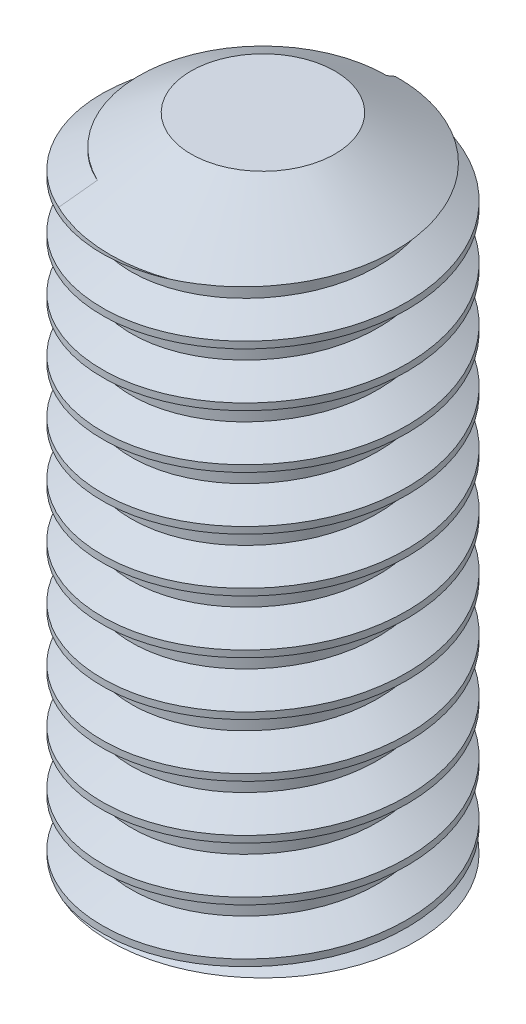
ISO-10303-21;
HEADER;
FILE_DESCRIPTION(('STEP AP214'),'2;1');
FILE_NAME('part.step','',(''),(''),'','','');
FILE_SCHEMA(('AUTOMOTIVE_DESIGN { 1 0 10303 214 1 1 1 1 }'));
ENDSEC;
DATA;
#1=APPLICATION_CONTEXT('core data for automotive mechanical design processes');
#2=APPLICATION_PROTOCOL_DEFINITION('international standard','automotive_design',2000,#1);
#3=PRODUCT_CONTEXT('',#1,'mechanical');
#4=PRODUCT('Part','Part','',(#3));
#5=PRODUCT_RELATED_PRODUCT_CATEGORY('part','',(#4));
#6=PRODUCT_DEFINITION_FORMATION('','',#4);
#7=PRODUCT_DEFINITION_CONTEXT('part definition',#1,'design');
#8=PRODUCT_DEFINITION('design','',#6,#7);
#9=PRODUCT_DEFINITION_SHAPE('','',#8);
#10=(LENGTH_UNIT() NAMED_UNIT(*) SI_UNIT(.MILLI.,.METRE.));
#11=(NAMED_UNIT(*) PLANE_ANGLE_UNIT() SI_UNIT($,.RADIAN.));
#12=(NAMED_UNIT(*) SI_UNIT($,.STERADIAN.) SOLID_ANGLE_UNIT());
#13=UNCERTAINTY_MEASURE_WITH_UNIT(LENGTH_MEASURE(1.E-05),#10,'distance_accuracy_value','');
#14=(GEOMETRIC_REPRESENTATION_CONTEXT(3) GLOBAL_UNCERTAINTY_ASSIGNED_CONTEXT((#13)) GLOBAL_UNIT_ASSIGNED_CONTEXT((#10,
#11,#12)) REPRESENTATION_CONTEXT('',''));
#15=CARTESIAN_POINT('',(0.,0.,0.));
#16=DIRECTION('',(0.,0.,1.));
#17=DIRECTION('',(1.,0.,0.));
#18=AXIS2_PLACEMENT_3D('',#15,#16,#17);
#19=CARTESIAN_POINT('',(0.,0.,0.));
#20=DIRECTION('',(0.,-1.,0.));
#21=DIRECTION('',(0.,0.,-1.));
#22=AXIS2_PLACEMENT_3D('',#19,#20,#21);
#23=PLANE('',#22);
#24=CARTESIAN_POINT('',(0.,0.,0.));
#25=DIRECTION('',(0.,-1.,0.));
#26=DIRECTION('',(0.,0.,-1.));
#27=AXIS2_PLACEMENT_3D('',#24,#25,#26);
#28=CIRCLE('',#27,2.);
#29=CARTESIAN_POINT('',(-0.776697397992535,0.,1.8430250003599));
#30=VERTEX_POINT('',#29);
#31=CARTESIAN_POINT('',(-1.85359325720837,0.,0.751127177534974));
#32=VERTEX_POINT('',#31);
#33=EDGE_CURVE('E112',#30,#32,#28,.T.);
#34=ORIENTED_EDGE('',*,*,#33,.T.);
#35=CARTESIAN_POINT('',(0.,0.,0.));
#36=DIRECTION('',(0.,-1.,0.));
#37=DIRECTION('',(0.,0.,-1.));
#38=AXIS2_PLACEMENT_3D('',#35,#36,#37);
#39=CIRCLE('',#38,2.);
#40=EDGE_CURVE('E45',#32,#30,#39,.T.);
#41=ORIENTED_EDGE('',*,*,#40,.T.);
#42=EDGE_LOOP('',(#34,#41));
#43=FACE_BOUND('',#42,.T.);
#44=ADVANCED_FACE('F33',(#43),#23,.T.);
#45=CARTESIAN_POINT('',(0.,0.,0.));
#46=DIRECTION('',(0.,-1.,0.));
#47=DIRECTION('',(0.,0.,-1.));
#48=AXIS2_PLACEMENT_3D('',#45,#46,#47);
#49=CONICAL_SURFACE('',#48,2.,1.0471975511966);
#50=CARTESIAN_POINT('',(0.,0.218815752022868,0.));
#51=DIRECTION('',(0.,-1.,0.));
#52=DIRECTION('',(0.,0.,-1.));
#53=AXIS2_PLACEMENT_3D('',#50,#51,#52);
#54=CIRCLE('',#53,1.621);
#55=CARTESIAN_POINT('',(-1.50233733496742,0.218815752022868,0.608788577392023));
#56=VERTEX_POINT('',#55);
#57=CARTESIAN_POINT('',(-0.629513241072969,0.218815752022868,-1.49377176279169));
#58=VERTEX_POINT('',#57);
#59=EDGE_CURVE('E197',#56,#58,#54,.T.);
#60=ORIENTED_EDGE('',*,*,#59,.T.);
#61=CARTESIAN_POINT('',(-0.629513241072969,0.218815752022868,-1.49377176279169));
#62=CARTESIAN_POINT('',(-0.592378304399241,0.217338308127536,-1.51219665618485));
#63=CARTESIAN_POINT('',(-0.554549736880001,0.215872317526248,-1.52917529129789));
#64=CARTESIAN_POINT('',(-0.477680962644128,0.212968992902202,-1.56016361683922));
#65=CARTESIAN_POINT('',(-0.438640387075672,0.211531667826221,-1.57417239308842));
#66=CARTESIAN_POINT('',(-0.320229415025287,0.207280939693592,-1.61154087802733));
#67=CARTESIAN_POINT('',(-0.23935135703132,0.204520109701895,-1.63035092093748));
#68=CARTESIAN_POINT('',(-0.112980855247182,0.200416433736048,-1.649620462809));
#69=CARTESIAN_POINT('',(-0.0681107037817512,0.198999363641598,-1.65453462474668));
#70=CARTESIAN_POINT('',(-0.000610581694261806,0.196922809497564,-1.65907221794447));
#71=CARTESIAN_POINT('',(0.0219250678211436,0.196238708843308,-1.66011242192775));
#72=CARTESIAN_POINT('',(0.0670224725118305,0.194851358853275,-1.66130891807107));
#73=CARTESIAN_POINT('',(0.0895842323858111,0.19414810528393,-1.66146501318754));
#74=CARTESIAN_POINT('',(0.157270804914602,0.19202043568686,-1.660588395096));
#75=CARTESIAN_POINT('',(0.202386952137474,0.190578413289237,-1.65821011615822));
#76=CARTESIAN_POINT('',(0.292284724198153,0.187653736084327,-1.6498920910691));
#77=CARTESIAN_POINT('',(0.337066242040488,0.186171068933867,-1.64395125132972));
#78=CARTESIAN_POINT('',(0.474372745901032,0.181548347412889,-1.62014547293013));
#79=CARTESIAN_POINT('',(0.565943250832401,0.178356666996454,-1.59633734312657));
#80=CARTESIAN_POINT('',(0.743846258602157,0.171938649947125,-1.53395618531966));
#81=CARTESIAN_POINT('',(0.830179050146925,0.168712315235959,-1.49538397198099));
#82=CARTESIAN_POINT('',(0.996868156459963,0.162250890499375,-1.40367635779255));
#83=CARTESIAN_POINT('',(1.07708139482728,0.159016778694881,-1.35028051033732));
#84=CARTESIAN_POINT('',(1.2274114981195,0.152686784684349,-1.230746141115));
#85=CARTESIAN_POINT('',(1.29753039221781,0.14959087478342,-1.16461018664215));
#86=CARTESIAN_POINT('',(1.39356626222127,0.145116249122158,-1.05738279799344));
#87=CARTESIAN_POINT('',(1.42405696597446,0.143652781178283,-1.02029914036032));
#88=CARTESIAN_POINT('',(1.46738124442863,0.14150157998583,-0.962850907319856));
#89=CARTESIAN_POINT('',(1.48142221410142,0.140791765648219,-0.943395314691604));
#90=CARTESIAN_POINT('',(1.50866461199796,0.139394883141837,-0.903903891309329));
#91=CARTESIAN_POINT('',(1.52186597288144,0.138707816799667,-0.883868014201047));
#92=CARTESIAN_POINT('',(1.56026019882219,0.136628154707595,-0.822980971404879));
#93=CARTESIAN_POINT('',(1.58423990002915,0.13521724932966,-0.781354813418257));
#94=CARTESIAN_POINT('',(1.62881204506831,0.132345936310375,-0.696347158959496));
#95=CARTESIAN_POINT('',(1.64940440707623,0.130885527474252,-0.65296562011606));
#96=CARTESIAN_POINT('',(1.70703332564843,0.126359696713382,-0.517894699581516));
#97=CARTESIAN_POINT('',(1.73838972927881,0.123232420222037,-0.423699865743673));
#98=CARTESIAN_POINT('',(1.78526942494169,0.116911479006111,-0.231511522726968));
#99=CARTESIAN_POINT('',(1.80079383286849,0.113717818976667,-0.133518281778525));
#100=CARTESIAN_POINT('',(1.81584276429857,0.107259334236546,0.0665038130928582));
#101=CARTESIAN_POINT('',(1.81489969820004,0.103995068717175,0.168568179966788));
#102=CARTESIAN_POINT('',(1.79586160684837,0.0975744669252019,0.371120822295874));
#103=CARTESIAN_POINT('',(1.77776927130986,0.0944181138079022,0.471609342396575));
#104=CARTESIAN_POINT('',(1.73821967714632,0.0898326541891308,0.618879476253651));
#105=CARTESIAN_POINT('',(1.72296234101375,0.0883286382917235,0.667404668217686));
#106=CARTESIAN_POINT('',(1.68842032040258,0.0853732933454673,0.763015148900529));
#107=CARTESIAN_POINT('',(1.66913583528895,0.0839219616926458,0.810100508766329));
#108=CARTESIAN_POINT('',(1.62664420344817,0.0810996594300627,0.902477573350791));
#109=CARTESIAN_POINT('',(1.60343590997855,0.0797287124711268,0.947768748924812));
#110=CARTESIAN_POINT('',(1.55349394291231,0.0769233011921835,1.03636317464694));
#111=CARTESIAN_POINT('',(1.52675987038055,0.0754888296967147,1.07966619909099));
#112=CARTESIAN_POINT('',(1.46938567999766,0.07255016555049,1.16478714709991));
#113=CARTESIAN_POINT('',(1.43868206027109,0.0710451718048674,1.20656236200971));
#114=CARTESIAN_POINT('',(1.3739953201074,0.0679997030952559,1.28746732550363));
#115=CARTESIAN_POINT('',(1.3400124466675,0.0664592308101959,1.32659727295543));
#116=CARTESIAN_POINT('',(1.2334534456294,0.0618014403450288,1.43963548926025));
#117=CARTESIAN_POINT('',(1.15622442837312,0.0586455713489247,1.50925508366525));
#118=CARTESIAN_POINT('',(0.988494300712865,0.0522070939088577,1.6373370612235));
#119=CARTESIAN_POINT('',(0.897609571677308,0.048924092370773,1.69529502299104));
#120=CARTESIAN_POINT('',(0.707432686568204,0.0424384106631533,1.7951096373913));
#121=CARTESIAN_POINT('',(0.608143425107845,0.039235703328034,1.83697180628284));
#122=CARTESIAN_POINT('',(0.4039314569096,0.0329943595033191,1.90341679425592));
#123=CARTESIAN_POINT('',(0.299011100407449,0.0299556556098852,1.9280067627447));
#124=CARTESIAN_POINT('',(0.139710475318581,0.0255781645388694,1.9514413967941));
#125=CARTESIAN_POINT('',(0.0862450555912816,0.0241479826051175,1.95701024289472));
#126=CARTESIAN_POINT('',(0.00583764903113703,0.0220554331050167,1.96197340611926));
#127=CARTESIAN_POINT('',(-0.0210019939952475,0.0213666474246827,1.96306272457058));
#128=CARTESIAN_POINT('',(-0.0747096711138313,0.0199701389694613,1.96417372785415));
#129=CARTESIAN_POINT('',(-0.101577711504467,0.0192624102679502,1.96419507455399));
#130=CARTESIAN_POINT('',(-0.183646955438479,0.0170811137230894,1.96261268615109));
#131=CARTESIAN_POINT('',(-0.23882474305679,0.0155875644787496,1.95927013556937));
#132=CARTESIAN_POINT('',(-0.348708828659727,0.0125560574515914,1.94805772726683));
#133=CARTESIAN_POINT('',(-0.403415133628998,0.0110181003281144,1.94018793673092));
#134=CARTESIAN_POINT('',(-0.511941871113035,0.00791152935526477,1.91998044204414));
#135=CARTESIAN_POINT('',(-0.565763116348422,0.00634294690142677,1.90764710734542));
#136=CARTESIAN_POINT('',(-0.672215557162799,0.00318457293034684,1.87859957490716));
#137=CARTESIAN_POINT('',(-0.724846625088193,0.00159477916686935,1.86188490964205));
#138=CARTESIAN_POINT('',(-0.776697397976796,4.8388300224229E-13,1.84302500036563));
#139=B_SPLINE_CURVE_WITH_KNOTS('',3,(#61,#62,#63,#64,#65,#66,#67,#68,#69,#70,#71,#72,#73,#74,
#75,#76,#77,#78,#79,#80,#81,#82,#83,#84,#85,#86,#87,#88,#89,#90,#91,#92,#93,#94,#95,#96,#97,#98,
#99,#100,#101,#102,#103,#104,#105,#106,#107,#108,#109,#110,#111,#112,#113,#114,#115,#116,#117,
#118,#119,#120,#121,#122,#123,#124,#125,#126,#127,#128,#129,#130,#131,#132,#133,#134,#135,#136,
#137,#138),.UNSPECIFIED.,.F.,.F.,(4,2,2,2,2,2,2,2,2,2,2,2,2,2,2,2,2,2,2,2,2,2,2,2,2,2,2,2,2,2,2,
2,2,2,2,2,2,2,4),(0.,0.12436796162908,0.248774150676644,0.496862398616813,0.632207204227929,
0.699898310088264,0.767604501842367,0.903046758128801,1.03853061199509,1.32111913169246,
1.60369206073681,1.89158364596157,2.17941727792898,2.32336178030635,2.39535093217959,
2.46734585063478,2.61135220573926,2.75536203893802,3.0518815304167,3.34838012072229,
3.65331106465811,3.95819419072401,4.11071566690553,4.26322959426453,4.41578817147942,
4.56836402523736,4.72378294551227,4.87919016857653,5.1897793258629,5.51178966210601,
5.83368954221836,6.15545610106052,6.31660723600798,6.39719653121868,6.47781134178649,
6.64350348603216,6.80919317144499,6.97472109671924,7.14026669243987),.UNSPECIFIED.);
#140=EDGE_CURVE('E143',#58,#30,#139,.T.);
#141=ORIENTED_EDGE('',*,*,#140,.T.);
#142=ORIENTED_EDGE('',*,*,#40,.F.);
#143=CARTESIAN_POINT('',(-1.85359325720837,0.,0.751127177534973));
#144=CARTESIAN_POINT('',(-1.82086691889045,0.0203869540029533,0.737865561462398));
#145=CARTESIAN_POINT('',(-1.78814058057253,0.0407739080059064,0.724603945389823));
#146=CARTESIAN_POINT('',(-1.72268790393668,0.0815478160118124,0.698080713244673));
#147=CARTESIAN_POINT('',(-1.68996156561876,0.101934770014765,0.684819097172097));
#148=CARTESIAN_POINT('',(-1.60560259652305,0.154486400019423,0.650634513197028));
#149=CARTESIAN_POINT('',(-1.55396996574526,0.186651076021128,0.629711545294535));
#150=CARTESIAN_POINT('',(-1.50233733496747,0.218815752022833,0.608788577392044));
#151=B_SPLINE_CURVE_WITH_KNOTS('',3,(#143,#144,#145,#146,#147,#148,#149,#150),.UNSPECIFIED.,.F.,
.F.,(4,2,2,4),(0.,0.122321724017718,0.244643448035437,0.437631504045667),.UNSPECIFIED.);
#152=EDGE_CURVE('E107',#32,#56,#151,.T.);
#153=ORIENTED_EDGE('',*,*,#152,.T.);
#154=EDGE_LOOP('',(#60,#141,#142,#153));
#155=FACE_BOUND('',#154,.T.);
#156=ADVANCED_FACE('F149',(#155),#49,.T.);
#157=CARTESIAN_POINT('',(0.,0.,0.));
#158=DIRECTION('',(0.,-1.,0.));
#159=DIRECTION('',(0.,0.,-1.));
#160=AXIS2_PLACEMENT_3D('',#157,#158,#159);
#161=CYLINDRICAL_SURFACE('',#160,1.621);
#162=CARTESIAN_POINT('',(0.,8.,0.));
#163=DIRECTION('',(0.,-1.,0.));
#164=DIRECTION('',(0.,0.,-1.));
#165=AXIS2_PLACEMENT_3D('',#162,#163,#164);
#166=CIRCLE('',#165,1.621);
#167=CARTESIAN_POINT('',(-0.708156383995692,8.,1.4581342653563));
#168=VERTEX_POINT('',#167);
#169=CARTESIAN_POINT('',(0.,8.00000000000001,-1.621));
#170=VERTEX_POINT('',#169);
#171=EDGE_CURVE('E90',#168,#170,#166,.T.);
#172=ORIENTED_EDGE('',*,*,#171,.T.);
#173=DIRECTION('',(0.,1.,0.));
#174=VECTOR('',#173,1.);
#175=CARTESIAN_POINT('',(0.,8.1375,-1.621));
#176=LINE('',#175,#174);
#177=CARTESIAN_POINT('',(0.,7.875,-1.621));
#178=VERTEX_POINT('',#177);
#179=EDGE_CURVE('E110',#178,#170,#176,.T.);
#180=ORIENTED_EDGE('',*,*,#179,.F.);
#181=CARTESIAN_POINT('',(0.,-0.525,-1.621));
#182=CARTESIAN_POINT('',(-0.935884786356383,-0.466666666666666,-1.621));
#183=CARTESIAN_POINT('',(-1.40382717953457,-0.408333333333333,-0.8105));
#184=CARTESIAN_POINT('',(-1.87176957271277,-0.35,0.));
#185=CARTESIAN_POINT('',(-1.40382717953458,-0.291666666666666,0.8105));
#186=CARTESIAN_POINT('',(-0.935884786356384,-0.233333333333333,1.621));
#187=CARTESIAN_POINT('',(0.,-0.175,1.621));
#188=CARTESIAN_POINT('',(0.935884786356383,-0.116666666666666,1.621));
#189=CARTESIAN_POINT('',(1.40382717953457,-0.0583333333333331,0.810500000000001));
#190=CARTESIAN_POINT('',(1.87176957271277,0.,0.));
#191=CARTESIAN_POINT('',(1.40382717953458,0.0583333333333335,-0.810499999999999));
#192=CARTESIAN_POINT('',(0.935884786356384,0.116666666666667,-1.621));
#193=CARTESIAN_POINT('',(0.,0.175,-1.621));
#194=CARTESIAN_POINT('',(-0.935884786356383,0.233333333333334,-1.621));
#195=CARTESIAN_POINT('',(-1.40382717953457,0.291666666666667,-0.8105));
#196=CARTESIAN_POINT('',(-1.87176957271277,0.35,0.));
#197=CARTESIAN_POINT('',(-1.40382717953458,0.408333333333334,0.8105));
#198=CARTESIAN_POINT('',(-0.935884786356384,0.466666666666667,1.621));
#199=CARTESIAN_POINT('',(0.,0.525,1.621));
#200=CARTESIAN_POINT('',(0.935884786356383,0.583333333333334,1.621));
#201=CARTESIAN_POINT('',(1.40382717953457,0.641666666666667,0.810500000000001));
#202=CARTESIAN_POINT('',(1.87176957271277,0.7,0.));
#203=CARTESIAN_POINT('',(1.40382717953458,0.758333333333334,-0.810499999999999));
#204=CARTESIAN_POINT('',(0.935884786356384,0.816666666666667,-1.621));
#205=CARTESIAN_POINT('',(0.,0.875,-1.621));
#206=CARTESIAN_POINT('',(-0.935884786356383,0.933333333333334,-1.621));
#207=CARTESIAN_POINT('',(-1.40382717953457,0.991666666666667,-0.8105));
#208=CARTESIAN_POINT('',(-1.87176957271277,1.05,0.));
#209=CARTESIAN_POINT('',(-1.40382717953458,1.10833333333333,0.8105));
#210=CARTESIAN_POINT('',(-0.935884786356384,1.16666666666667,1.621));
#211=CARTESIAN_POINT('',(0.,1.225,1.621));
#212=CARTESIAN_POINT('',(0.935884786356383,1.28333333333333,1.621));
#213=CARTESIAN_POINT('',(1.40382717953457,1.34166666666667,0.810500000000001));
#214=CARTESIAN_POINT('',(1.87176957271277,1.4,0.));
#215=CARTESIAN_POINT('',(1.40382717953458,1.45833333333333,-0.810499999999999));
#216=CARTESIAN_POINT('',(0.935884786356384,1.51666666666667,-1.621));
#217=CARTESIAN_POINT('',(0.,1.575,-1.621));
#218=CARTESIAN_POINT('',(-0.935884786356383,1.63333333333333,-1.621));
#219=CARTESIAN_POINT('',(-1.40382717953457,1.69166666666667,-0.8105));
#220=CARTESIAN_POINT('',(-1.87176957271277,1.75,0.));
#221=CARTESIAN_POINT('',(-1.40382717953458,1.80833333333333,0.8105));
#222=CARTESIAN_POINT('',(-0.935884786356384,1.86666666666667,1.621));
#223=CARTESIAN_POINT('',(0.,1.925,1.621));
#224=CARTESIAN_POINT('',(0.935884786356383,1.98333333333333,1.621));
#225=CARTESIAN_POINT('',(1.40382717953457,2.04166666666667,0.810500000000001));
#226=CARTESIAN_POINT('',(1.87176957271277,2.1,0.));
#227=CARTESIAN_POINT('',(1.40382717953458,2.15833333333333,-0.810499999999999));
#228=CARTESIAN_POINT('',(0.935884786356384,2.21666666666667,-1.621));
#229=CARTESIAN_POINT('',(0.,2.275,-1.621));
#230=CARTESIAN_POINT('',(-0.935884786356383,2.33333333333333,-1.621));
#231=CARTESIAN_POINT('',(-1.40382717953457,2.39166666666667,-0.8105));
#232=CARTESIAN_POINT('',(-1.87176957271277,2.45,0.));
#233=CARTESIAN_POINT('',(-1.40382717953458,2.50833333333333,0.8105));
#234=CARTESIAN_POINT('',(-0.935884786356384,2.56666666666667,1.621));
#235=CARTESIAN_POINT('',(0.,2.625,1.621));
#236=CARTESIAN_POINT('',(0.935884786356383,2.68333333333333,1.621));
#237=CARTESIAN_POINT('',(1.40382717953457,2.74166666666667,0.810500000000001));
#238=CARTESIAN_POINT('',(1.87176957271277,2.8,0.));
#239=CARTESIAN_POINT('',(1.40382717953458,2.85833333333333,-0.810499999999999));
#240=CARTESIAN_POINT('',(0.935884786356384,2.91666666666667,-1.621));
#241=CARTESIAN_POINT('',(0.,2.975,-1.621));
#242=CARTESIAN_POINT('',(-0.935884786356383,3.03333333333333,-1.621));
#243=CARTESIAN_POINT('',(-1.40382717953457,3.09166666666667,-0.8105));
#244=CARTESIAN_POINT('',(-1.87176957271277,3.15,0.));
#245=CARTESIAN_POINT('',(-1.40382717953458,3.20833333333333,0.8105));
#246=CARTESIAN_POINT('',(-0.935884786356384,3.26666666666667,1.621));
#247=CARTESIAN_POINT('',(0.,3.325,1.621));
#248=CARTESIAN_POINT('',(0.935884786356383,3.38333333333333,1.621));
#249=CARTESIAN_POINT('',(1.40382717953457,3.44166666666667,0.810500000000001));
#250=CARTESIAN_POINT('',(1.87176957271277,3.5,0.));
#251=CARTESIAN_POINT('',(1.40382717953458,3.55833333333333,-0.810499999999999));
#252=CARTESIAN_POINT('',(0.935884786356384,3.61666666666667,-1.621));
#253=CARTESIAN_POINT('',(0.,3.675,-1.621));
#254=CARTESIAN_POINT('',(-0.935884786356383,3.73333333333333,-1.621));
#255=CARTESIAN_POINT('',(-1.40382717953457,3.79166666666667,-0.8105));
#256=CARTESIAN_POINT('',(-1.87176957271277,3.85,0.));
#257=CARTESIAN_POINT('',(-1.40382717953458,3.90833333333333,0.8105));
#258=CARTESIAN_POINT('',(-0.935884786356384,3.96666666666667,1.621));
#259=CARTESIAN_POINT('',(0.,4.025,1.621));
#260=CARTESIAN_POINT('',(0.935884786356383,4.08333333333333,1.621));
#261=CARTESIAN_POINT('',(1.40382717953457,4.14166666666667,0.810500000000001));
#262=CARTESIAN_POINT('',(1.87176957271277,4.2,0.));
#263=CARTESIAN_POINT('',(1.40382717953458,4.25833333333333,-0.810499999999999));
#264=CARTESIAN_POINT('',(0.935884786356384,4.31666666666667,-1.621));
#265=CARTESIAN_POINT('',(0.,4.375,-1.621));
#266=CARTESIAN_POINT('',(-0.935884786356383,4.43333333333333,-1.621));
#267=CARTESIAN_POINT('',(-1.40382717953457,4.49166666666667,-0.8105));
#268=CARTESIAN_POINT('',(-1.87176957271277,4.55,0.));
#269=CARTESIAN_POINT('',(-1.40382717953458,4.60833333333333,0.8105));
#270=CARTESIAN_POINT('',(-0.935884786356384,4.66666666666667,1.621));
#271=CARTESIAN_POINT('',(0.,4.725,1.621));
#272=CARTESIAN_POINT('',(0.935884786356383,4.78333333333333,1.621));
#273=CARTESIAN_POINT('',(1.40382717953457,4.84166666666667,0.810500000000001));
#274=CARTESIAN_POINT('',(1.87176957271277,4.9,0.));
#275=CARTESIAN_POINT('',(1.40382717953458,4.95833333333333,-0.810499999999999));
#276=CARTESIAN_POINT('',(0.935884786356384,5.01666666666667,-1.621));
#277=CARTESIAN_POINT('',(0.,5.075,-1.621));
#278=CARTESIAN_POINT('',(-0.935884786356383,5.13333333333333,-1.621));
#279=CARTESIAN_POINT('',(-1.40382717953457,5.19166666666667,-0.8105));
#280=CARTESIAN_POINT('',(-1.87176957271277,5.25,0.));
#281=CARTESIAN_POINT('',(-1.40382717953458,5.30833333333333,0.8105));
#282=CARTESIAN_POINT('',(-0.935884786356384,5.36666666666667,1.621));
#283=CARTESIAN_POINT('',(0.,5.425,1.621));
#284=CARTESIAN_POINT('',(0.935884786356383,5.48333333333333,1.621));
#285=CARTESIAN_POINT('',(1.40382717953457,5.54166666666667,0.810500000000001));
#286=CARTESIAN_POINT('',(1.87176957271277,5.6,0.));
#287=CARTESIAN_POINT('',(1.40382717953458,5.65833333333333,-0.810499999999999));
#288=CARTESIAN_POINT('',(0.935884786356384,5.71666666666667,-1.621));
#289=CARTESIAN_POINT('',(0.,5.775,-1.621));
#290=CARTESIAN_POINT('',(-0.935884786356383,5.83333333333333,-1.621));
#291=CARTESIAN_POINT('',(-1.40382717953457,5.89166666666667,-0.8105));
#292=CARTESIAN_POINT('',(-1.87176957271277,5.95,0.));
#293=CARTESIAN_POINT('',(-1.40382717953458,6.00833333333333,0.8105));
#294=CARTESIAN_POINT('',(-0.935884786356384,6.06666666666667,1.621));
#295=CARTESIAN_POINT('',(0.,6.125,1.621));
#296=CARTESIAN_POINT('',(0.935884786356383,6.18333333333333,1.621));
#297=CARTESIAN_POINT('',(1.40382717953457,6.24166666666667,0.810500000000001));
#298=CARTESIAN_POINT('',(1.87176957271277,6.3,0.));
#299=CARTESIAN_POINT('',(1.40382717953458,6.35833333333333,-0.810499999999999));
#300=CARTESIAN_POINT('',(0.935884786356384,6.41666666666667,-1.621));
#301=CARTESIAN_POINT('',(0.,6.475,-1.621));
#302=CARTESIAN_POINT('',(-0.935884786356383,6.53333333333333,-1.621));
#303=CARTESIAN_POINT('',(-1.40382717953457,6.59166666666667,-0.8105));
#304=CARTESIAN_POINT('',(-1.87176957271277,6.65,0.));
#305=CARTESIAN_POINT('',(-1.40382717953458,6.70833333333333,0.8105));
#306=CARTESIAN_POINT('',(-0.935884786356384,6.76666666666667,1.621));
#307=CARTESIAN_POINT('',(0.,6.825,1.621));
#308=CARTESIAN_POINT('',(0.935884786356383,6.88333333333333,1.621));
#309=CARTESIAN_POINT('',(1.40382717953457,6.94166666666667,0.810500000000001));
#310=CARTESIAN_POINT('',(1.87176957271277,7.,0.));
#311=CARTESIAN_POINT('',(1.40382717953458,7.05833333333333,-0.810499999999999));
#312=CARTESIAN_POINT('',(0.935884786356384,7.11666666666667,-1.621));
#313=CARTESIAN_POINT('',(0.,7.175,-1.621));
#314=CARTESIAN_POINT('',(-0.935884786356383,7.23333333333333,-1.621));
#315=CARTESIAN_POINT('',(-1.40382717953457,7.29166666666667,-0.8105));
#316=CARTESIAN_POINT('',(-1.87176957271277,7.35,0.));
#317=CARTESIAN_POINT('',(-1.40382717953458,7.40833333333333,0.8105));
#318=CARTESIAN_POINT('',(-0.935884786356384,7.46666666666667,1.621));
#319=CARTESIAN_POINT('',(0.,7.525,1.621));
#320=CARTESIAN_POINT('',(0.935884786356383,7.58333333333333,1.621));
#321=CARTESIAN_POINT('',(1.40382717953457,7.64166666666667,0.810500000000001));
#322=CARTESIAN_POINT('',(1.87176957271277,7.7,0.));
#323=CARTESIAN_POINT('',(1.40382717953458,7.75833333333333,-0.810499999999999));
#324=CARTESIAN_POINT('',(0.935884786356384,7.81666666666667,-1.621));
#325=CARTESIAN_POINT('',(0.,7.875,-1.621));
#326=(BOUNDED_CURVE() B_SPLINE_CURVE(2,(#181,#182,#183,#184,#185,#186,#187,#188,#189,#190,#191,
#192,#193,#194,#195,#196,#197,#198,#199,#200,#201,#202,#203,#204,#205,#206,#207,#208,#209,#210,
#211,#212,#213,#214,#215,#216,#217,#218,#219,#220,#221,#222,#223,#224,#225,#226,#227,#228,#229,
#230,#231,#232,#233,#234,#235,#236,#237,#238,#239,#240,#241,#242,#243,#244,#245,#246,#247,#248,
#249,#250,#251,#252,#253,#254,#255,#256,#257,#258,#259,#260,#261,#262,#263,#264,#265,#266,#267,
#268,#269,#270,#271,#272,#273,#274,#275,#276,#277,#278,#279,#280,#281,#282,#283,#284,#285,#286,
#287,#288,#289,#290,#291,#292,#293,#294,#295,#296,#297,#298,#299,#300,#301,#302,#303,#304,#305,
#306,#307,#308,#309,#310,#311,#312,#313,#314,#315,#316,#317,#318,#319,#320,#321,#322,#323,#324,
#325),.UNSPECIFIED.,.F.,.F.) B_SPLINE_CURVE_WITH_KNOTS((3,2,2,2,2,2,2,2,2,2,2,2,2,2,2,2,2,2,2,2,
2,2,2,2,2,2,2,2,2,2,2,2,2,2,2,2,2,2,2,2,2,2,2,2,2,2,2,2,2,2,2,2,2,2,2,2,2,2,2,2,2,2,2,2,2,2,2,2,
2,2,2,2,3),(0.,0.0138888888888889,0.0277777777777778,0.0416666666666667,0.0555555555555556,
0.0694444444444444,0.0833333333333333,0.0972222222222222,0.111111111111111,0.125,
0.138888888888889,0.152777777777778,0.166666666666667,0.180555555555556,0.194444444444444,
0.208333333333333,0.222222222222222,0.236111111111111,0.25,0.263888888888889,0.277777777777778,
0.291666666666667,0.305555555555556,0.319444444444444,0.333333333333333,0.347222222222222,
0.361111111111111,0.375,0.388888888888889,0.402777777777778,0.416666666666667,0.430555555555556,
0.444444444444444,0.458333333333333,0.472222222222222,0.486111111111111,0.5,0.513888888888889,
0.527777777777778,0.541666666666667,0.555555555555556,0.569444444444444,0.583333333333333,
0.597222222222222,0.611111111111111,0.625,0.638888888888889,0.652777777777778,0.666666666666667,
0.680555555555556,0.694444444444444,0.708333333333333,0.722222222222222,0.736111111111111,0.75,
0.763888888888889,0.777777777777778,0.791666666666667,0.805555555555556,0.819444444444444,
0.833333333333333,0.847222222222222,0.861111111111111,0.875,0.888888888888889,0.902777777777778,
0.916666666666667,0.930555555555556,0.944444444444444,0.958333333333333,0.972222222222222,
0.986111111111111,1.),
.UNSPECIFIED.) CURVE() GEOMETRIC_REPRESENTATION_ITEM() RATIONAL_B_SPLINE_CURVE((1.,
0.866025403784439,1.,0.866025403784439,1.,0.866025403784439,1.,0.866025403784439,1.,
0.866025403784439,1.,0.866025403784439,1.,0.866025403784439,1.,0.866025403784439,1.,
0.866025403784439,1.,0.866025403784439,1.,0.866025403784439,1.,0.866025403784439,1.,
0.866025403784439,1.,0.866025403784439,1.,0.866025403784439,1.,0.866025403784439,1.,
0.866025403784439,1.,0.866025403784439,1.,0.866025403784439,1.,0.866025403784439,1.,
0.866025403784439,1.,0.866025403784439,1.,0.866025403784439,1.,0.866025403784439,1.,
0.866025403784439,1.,0.866025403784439,1.,0.866025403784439,1.,0.866025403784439,1.,
0.866025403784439,1.,0.866025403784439,1.,0.866025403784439,1.,0.866025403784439,1.,
0.866025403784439,1.,0.866025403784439,1.,0.866025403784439,1.,0.866025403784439,1.,
0.866025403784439,1.,0.866025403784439,1.,0.866025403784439,1.,0.866025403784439,1.,
0.866025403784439,1.,0.866025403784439,1.,0.866025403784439,1.,0.866025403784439,1.,
0.866025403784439,1.,0.866025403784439,1.,0.866025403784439,1.,0.866025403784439,1.,
0.866025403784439,1.,0.866025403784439,1.,0.866025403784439,1.,0.866025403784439,1.,
0.866025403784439,1.,0.866025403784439,1.,0.866025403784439,1.,0.866025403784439,1.,
0.866025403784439,1.,0.866025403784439,1.,0.866025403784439,1.,0.866025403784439,1.,
0.866025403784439,1.,0.866025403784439,1.,0.866025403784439,1.,0.866025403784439,1.,
0.866025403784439,1.,0.866025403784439,1.,0.866025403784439,1.,0.866025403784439,1.,
0.866025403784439,1.,0.866025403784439,1.,0.866025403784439,1.,0.866025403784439,1.)) REPRESENTATION_ITEM(''));
#327=EDGE_CURVE('E59',#58,#178,#326,.T.);
#328=ORIENTED_EDGE('',*,*,#327,.F.);
#329=ORIENTED_EDGE('',*,*,#59,.F.);
#330=CARTESIAN_POINT('',(0.,0.,-1.621));
#331=CARTESIAN_POINT('',(-0.935884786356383,0.0583333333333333,-1.621));
#332=CARTESIAN_POINT('',(-1.40382717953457,0.116666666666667,-0.8105));
#333=CARTESIAN_POINT('',(-1.87176957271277,0.175,0.));
#334=CARTESIAN_POINT('',(-1.40382717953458,0.233333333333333,0.8105));
#335=CARTESIAN_POINT('',(-0.935884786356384,0.291666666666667,1.621));
#336=CARTESIAN_POINT('',(0.,0.35,1.621));
#337=CARTESIAN_POINT('',(0.935884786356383,0.408333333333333,1.621));
#338=CARTESIAN_POINT('',(1.40382717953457,0.466666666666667,0.810500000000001));
#339=CARTESIAN_POINT('',(1.87176957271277,0.525,0.));
#340=CARTESIAN_POINT('',(1.40382717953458,0.583333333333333,-0.810499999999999));
#341=CARTESIAN_POINT('',(0.935884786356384,0.641666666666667,-1.621));
#342=CARTESIAN_POINT('',(0.,0.7,-1.621));
#343=CARTESIAN_POINT('',(-0.935884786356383,0.758333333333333,-1.621));
#344=CARTESIAN_POINT('',(-1.40382717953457,0.816666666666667,-0.8105));
#345=CARTESIAN_POINT('',(-1.87176957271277,0.875,0.));
#346=CARTESIAN_POINT('',(-1.40382717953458,0.933333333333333,0.8105));
#347=CARTESIAN_POINT('',(-0.935884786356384,0.991666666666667,1.621));
#348=CARTESIAN_POINT('',(0.,1.05,1.621));
#349=CARTESIAN_POINT('',(0.935884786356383,1.10833333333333,1.621));
#350=CARTESIAN_POINT('',(1.40382717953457,1.16666666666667,0.810500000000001));
#351=CARTESIAN_POINT('',(1.87176957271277,1.225,0.));
#352=CARTESIAN_POINT('',(1.40382717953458,1.28333333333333,-0.810499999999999));
#353=CARTESIAN_POINT('',(0.935884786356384,1.34166666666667,-1.621));
#354=CARTESIAN_POINT('',(0.,1.4,-1.621));
#355=CARTESIAN_POINT('',(-0.935884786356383,1.45833333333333,-1.621));
#356=CARTESIAN_POINT('',(-1.40382717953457,1.51666666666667,-0.8105));
#357=CARTESIAN_POINT('',(-1.87176957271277,1.575,0.));
#358=CARTESIAN_POINT('',(-1.40382717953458,1.63333333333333,0.8105));
#359=CARTESIAN_POINT('',(-0.935884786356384,1.69166666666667,1.621));
#360=CARTESIAN_POINT('',(0.,1.75,1.621));
#361=CARTESIAN_POINT('',(0.935884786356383,1.80833333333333,1.621));
#362=CARTESIAN_POINT('',(1.40382717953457,1.86666666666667,0.810500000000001));
#363=CARTESIAN_POINT('',(1.87176957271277,1.925,0.));
#364=CARTESIAN_POINT('',(1.40382717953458,1.98333333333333,-0.810499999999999));
#365=CARTESIAN_POINT('',(0.935884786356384,2.04166666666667,-1.621));
#366=CARTESIAN_POINT('',(0.,2.1,-1.621));
#367=CARTESIAN_POINT('',(-0.935884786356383,2.15833333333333,-1.621));
#368=CARTESIAN_POINT('',(-1.40382717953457,2.21666666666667,-0.8105));
#369=CARTESIAN_POINT('',(-1.87176957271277,2.275,0.));
#370=CARTESIAN_POINT('',(-1.40382717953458,2.33333333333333,0.8105));
#371=CARTESIAN_POINT('',(-0.935884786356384,2.39166666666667,1.621));
#372=CARTESIAN_POINT('',(0.,2.45,1.621));
#373=CARTESIAN_POINT('',(0.935884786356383,2.50833333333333,1.621));
#374=CARTESIAN_POINT('',(1.40382717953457,2.56666666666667,0.810500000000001));
#375=CARTESIAN_POINT('',(1.87176957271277,2.625,0.));
#376=CARTESIAN_POINT('',(1.40382717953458,2.68333333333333,-0.810499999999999));
#377=CARTESIAN_POINT('',(0.935884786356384,2.74166666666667,-1.621));
#378=CARTESIAN_POINT('',(0.,2.8,-1.621));
#379=CARTESIAN_POINT('',(-0.935884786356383,2.85833333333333,-1.621));
#380=CARTESIAN_POINT('',(-1.40382717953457,2.91666666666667,-0.8105));
#381=CARTESIAN_POINT('',(-1.87176957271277,2.975,0.));
#382=CARTESIAN_POINT('',(-1.40382717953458,3.03333333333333,0.8105));
#383=CARTESIAN_POINT('',(-0.935884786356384,3.09166666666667,1.621));
#384=CARTESIAN_POINT('',(0.,3.15,1.621));
#385=CARTESIAN_POINT('',(0.935884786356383,3.20833333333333,1.621));
#386=CARTESIAN_POINT('',(1.40382717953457,3.26666666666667,0.810500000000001));
#387=CARTESIAN_POINT('',(1.87176957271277,3.325,0.));
#388=CARTESIAN_POINT('',(1.40382717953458,3.38333333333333,-0.810499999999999));
#389=CARTESIAN_POINT('',(0.935884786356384,3.44166666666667,-1.621));
#390=CARTESIAN_POINT('',(0.,3.5,-1.621));
#391=CARTESIAN_POINT('',(-0.935884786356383,3.55833333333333,-1.621));
#392=CARTESIAN_POINT('',(-1.40382717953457,3.61666666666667,-0.8105));
#393=CARTESIAN_POINT('',(-1.87176957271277,3.675,0.));
#394=CARTESIAN_POINT('',(-1.40382717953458,3.73333333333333,0.8105));
#395=CARTESIAN_POINT('',(-0.935884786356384,3.79166666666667,1.621));
#396=CARTESIAN_POINT('',(0.,3.85,1.621));
#397=CARTESIAN_POINT('',(0.935884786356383,3.90833333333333,1.621));
#398=CARTESIAN_POINT('',(1.40382717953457,3.96666666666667,0.810500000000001));
#399=CARTESIAN_POINT('',(1.87176957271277,4.025,0.));
#400=CARTESIAN_POINT('',(1.40382717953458,4.08333333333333,-0.810499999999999));
#401=CARTESIAN_POINT('',(0.935884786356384,4.14166666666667,-1.621));
#402=CARTESIAN_POINT('',(0.,4.2,-1.621));
#403=CARTESIAN_POINT('',(-0.935884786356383,4.25833333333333,-1.621));
#404=CARTESIAN_POINT('',(-1.40382717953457,4.31666666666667,-0.8105));
#405=CARTESIAN_POINT('',(-1.87176957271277,4.375,0.));
#406=CARTESIAN_POINT('',(-1.40382717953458,4.43333333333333,0.8105));
#407=CARTESIAN_POINT('',(-0.935884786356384,4.49166666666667,1.621));
#408=CARTESIAN_POINT('',(0.,4.55,1.621));
#409=CARTESIAN_POINT('',(0.935884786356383,4.60833333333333,1.621));
#410=CARTESIAN_POINT('',(1.40382717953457,4.66666666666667,0.810500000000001));
#411=CARTESIAN_POINT('',(1.87176957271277,4.725,0.));
#412=CARTESIAN_POINT('',(1.40382717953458,4.78333333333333,-0.810499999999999));
#413=CARTESIAN_POINT('',(0.935884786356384,4.84166666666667,-1.621));
#414=CARTESIAN_POINT('',(0.,4.9,-1.621));
#415=CARTESIAN_POINT('',(-0.935884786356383,4.95833333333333,-1.621));
#416=CARTESIAN_POINT('',(-1.40382717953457,5.01666666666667,-0.8105));
#417=CARTESIAN_POINT('',(-1.87176957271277,5.075,0.));
#418=CARTESIAN_POINT('',(-1.40382717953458,5.13333333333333,0.8105));
#419=CARTESIAN_POINT('',(-0.935884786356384,5.19166666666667,1.621));
#420=CARTESIAN_POINT('',(0.,5.25,1.621));
#421=CARTESIAN_POINT('',(0.935884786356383,5.30833333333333,1.621));
#422=CARTESIAN_POINT('',(1.40382717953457,5.36666666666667,0.810500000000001));
#423=CARTESIAN_POINT('',(1.87176957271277,5.425,0.));
#424=CARTESIAN_POINT('',(1.40382717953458,5.48333333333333,-0.810499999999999));
#425=CARTESIAN_POINT('',(0.935884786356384,5.54166666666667,-1.621));
#426=CARTESIAN_POINT('',(0.,5.6,-1.621));
#427=CARTESIAN_POINT('',(-0.935884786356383,5.65833333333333,-1.621));
#428=CARTESIAN_POINT('',(-1.40382717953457,5.71666666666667,-0.8105));
#429=CARTESIAN_POINT('',(-1.87176957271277,5.775,0.));
#430=CARTESIAN_POINT('',(-1.40382717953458,5.83333333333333,0.8105));
#431=CARTESIAN_POINT('',(-0.935884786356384,5.89166666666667,1.621));
#432=CARTESIAN_POINT('',(0.,5.95,1.621));
#433=CARTESIAN_POINT('',(0.935884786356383,6.00833333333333,1.621));
#434=CARTESIAN_POINT('',(1.40382717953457,6.06666666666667,0.810500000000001));
#435=CARTESIAN_POINT('',(1.87176957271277,6.125,0.));
#436=CARTESIAN_POINT('',(1.40382717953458,6.18333333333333,-0.810499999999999));
#437=CARTESIAN_POINT('',(0.935884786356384,6.24166666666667,-1.621));
#438=CARTESIAN_POINT('',(0.,6.3,-1.621));
#439=CARTESIAN_POINT('',(-0.935884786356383,6.35833333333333,-1.621));
#440=CARTESIAN_POINT('',(-1.40382717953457,6.41666666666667,-0.8105));
#441=CARTESIAN_POINT('',(-1.87176957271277,6.475,0.));
#442=CARTESIAN_POINT('',(-1.40382717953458,6.53333333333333,0.8105));
#443=CARTESIAN_POINT('',(-0.935884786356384,6.59166666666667,1.621));
#444=CARTESIAN_POINT('',(0.,6.65,1.621));
#445=CARTESIAN_POINT('',(0.935884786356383,6.70833333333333,1.621));
#446=CARTESIAN_POINT('',(1.40382717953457,6.76666666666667,0.810500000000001));
#447=CARTESIAN_POINT('',(1.87176957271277,6.825,0.));
#448=CARTESIAN_POINT('',(1.40382717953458,6.88333333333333,-0.810499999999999));
#449=CARTESIAN_POINT('',(0.935884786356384,6.94166666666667,-1.621));
#450=CARTESIAN_POINT('',(0.,7.,-1.621));
#451=CARTESIAN_POINT('',(-0.935884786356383,7.05833333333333,-1.621));
#452=CARTESIAN_POINT('',(-1.40382717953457,7.11666666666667,-0.8105));
#453=CARTESIAN_POINT('',(-1.87176957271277,7.175,0.));
#454=CARTESIAN_POINT('',(-1.40382717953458,7.23333333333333,0.8105));
#455=CARTESIAN_POINT('',(-0.935884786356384,7.29166666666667,1.621));
#456=CARTESIAN_POINT('',(0.,7.35,1.621));
#457=CARTESIAN_POINT('',(0.935884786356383,7.40833333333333,1.621));
#458=CARTESIAN_POINT('',(1.40382717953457,7.46666666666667,0.810500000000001));
#459=CARTESIAN_POINT('',(1.87176957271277,7.525,0.));
#460=CARTESIAN_POINT('',(1.40382717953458,7.58333333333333,-0.810499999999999));
#461=CARTESIAN_POINT('',(0.935884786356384,7.64166666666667,-1.621));
#462=CARTESIAN_POINT('',(0.,7.7,-1.621));
#463=CARTESIAN_POINT('',(-0.935884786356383,7.75833333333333,-1.621));
#464=CARTESIAN_POINT('',(-1.40382717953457,7.81666666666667,-0.8105));
#465=CARTESIAN_POINT('',(-1.87176957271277,7.875,0.));
#466=CARTESIAN_POINT('',(-1.40382717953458,7.93333333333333,0.8105));
#467=CARTESIAN_POINT('',(-0.935884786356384,7.99166666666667,1.621));
#468=CARTESIAN_POINT('',(0.,8.05,1.621));
#469=CARTESIAN_POINT('',(0.935884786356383,8.10833333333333,1.621));
#470=CARTESIAN_POINT('',(1.40382717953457,8.16666666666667,0.810500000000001));
#471=CARTESIAN_POINT('',(1.87176957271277,8.225,0.));
#472=CARTESIAN_POINT('',(1.40382717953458,8.28333333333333,-0.810499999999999));
#473=CARTESIAN_POINT('',(0.935884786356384,8.34166666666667,-1.621));
#474=CARTESIAN_POINT('',(0.,8.4,-1.621));
#475=(BOUNDED_CURVE() B_SPLINE_CURVE(2,(#330,#331,#332,#333,#334,#335,#336,#337,#338,#339,#340,
#341,#342,#343,#344,#345,#346,#347,#348,#349,#350,#351,#352,#353,#354,#355,#356,#357,#358,#359,
#360,#361,#362,#363,#364,#365,#366,#367,#368,#369,#370,#371,#372,#373,#374,#375,#376,#377,#378,
#379,#380,#381,#382,#383,#384,#385,#386,#387,#388,#389,#390,#391,#392,#393,#394,#395,#396,#397,
#398,#399,#400,#401,#402,#403,#404,#405,#406,#407,#408,#409,#410,#411,#412,#413,#414,#415,#416,
#417,#418,#419,#420,#421,#422,#423,#424,#425,#426,#427,#428,#429,#430,#431,#432,#433,#434,#435,
#436,#437,#438,#439,#440,#441,#442,#443,#444,#445,#446,#447,#448,#449,#450,#451,#452,#453,#454,
#455,#456,#457,#458,#459,#460,#461,#462,#463,#464,#465,#466,#467,#468,#469,#470,#471,#472,#473,
#474),.UNSPECIFIED.,.F.,.F.) B_SPLINE_CURVE_WITH_KNOTS((3,2,2,2,2,2,2,2,2,2,2,2,2,2,2,2,2,2,2,2,
2,2,2,2,2,2,2,2,2,2,2,2,2,2,2,2,2,2,2,2,2,2,2,2,2,2,2,2,2,2,2,2,2,2,2,2,2,2,2,2,2,2,2,2,2,2,2,2,
2,2,2,2,3),(0.,0.0138888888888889,0.0277777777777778,0.0416666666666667,0.0555555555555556,
0.0694444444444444,0.0833333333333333,0.0972222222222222,0.111111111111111,0.125,
0.138888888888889,0.152777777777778,0.166666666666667,0.180555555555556,0.194444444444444,
0.208333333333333,0.222222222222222,0.236111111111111,0.25,0.263888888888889,0.277777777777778,
0.291666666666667,0.305555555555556,0.319444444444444,0.333333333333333,0.347222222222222,
0.361111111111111,0.375,0.388888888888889,0.402777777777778,0.416666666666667,0.430555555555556,
0.444444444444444,0.458333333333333,0.472222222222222,0.486111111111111,0.5,0.513888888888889,
0.527777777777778,0.541666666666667,0.555555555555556,0.569444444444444,0.583333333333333,
0.597222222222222,0.611111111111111,0.625,0.638888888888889,0.652777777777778,0.666666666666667,
0.680555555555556,0.694444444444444,0.708333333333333,0.722222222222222,0.736111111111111,0.75,
0.763888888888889,0.777777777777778,0.791666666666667,0.805555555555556,0.819444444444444,
0.833333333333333,0.847222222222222,0.861111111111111,0.875,0.888888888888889,0.902777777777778,
0.916666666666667,0.930555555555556,0.944444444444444,0.958333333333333,0.972222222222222,
0.986111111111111,1.),
.UNSPECIFIED.) CURVE() GEOMETRIC_REPRESENTATION_ITEM() RATIONAL_B_SPLINE_CURVE((1.,
0.866025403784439,1.,0.866025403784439,1.,0.866025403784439,1.,0.866025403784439,1.,
0.866025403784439,1.,0.866025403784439,1.,0.866025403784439,1.,0.866025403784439,1.,
0.866025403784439,1.,0.866025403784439,1.,0.866025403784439,1.,0.866025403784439,1.,
0.866025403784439,1.,0.866025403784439,1.,0.866025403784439,1.,0.866025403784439,1.,
0.866025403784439,1.,0.866025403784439,1.,0.866025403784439,1.,0.866025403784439,1.,
0.866025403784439,1.,0.866025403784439,1.,0.866025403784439,1.,0.866025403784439,1.,
0.866025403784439,1.,0.866025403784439,1.,0.866025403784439,1.,0.866025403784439,1.,
0.866025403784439,1.,0.866025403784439,1.,0.866025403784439,1.,0.866025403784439,1.,
0.866025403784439,1.,0.866025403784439,1.,0.866025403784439,1.,0.866025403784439,1.,
0.866025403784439,1.,0.866025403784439,1.,0.866025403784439,1.,0.866025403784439,1.,
0.866025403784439,1.,0.866025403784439,1.,0.866025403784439,1.,0.866025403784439,1.,
0.866025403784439,1.,0.866025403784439,1.,0.866025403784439,1.,0.866025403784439,1.,
0.866025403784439,1.,0.866025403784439,1.,0.866025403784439,1.,0.866025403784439,1.,
0.866025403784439,1.,0.866025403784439,1.,0.866025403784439,1.,0.866025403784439,1.,
0.866025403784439,1.,0.866025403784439,1.,0.866025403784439,1.,0.866025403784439,1.,
0.866025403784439,1.,0.866025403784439,1.,0.866025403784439,1.,0.866025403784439,1.,
0.866025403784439,1.,0.866025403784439,1.,0.866025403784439,1.,0.866025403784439,1.,
0.866025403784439,1.,0.866025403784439,1.,0.866025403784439,1.,0.866025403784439,1.)) REPRESENTATION_ITEM(''));
#476=EDGE_CURVE('E108',#56,#168,#475,.T.);
#477=ORIENTED_EDGE('',*,*,#476,.T.);
#478=EDGE_LOOP('',(#172,#180,#328,#329,#477));
#479=FACE_BOUND('',#478,.T.);
#480=ADVANCED_FACE('F212',(#479),#161,.T.);
#481=CARTESIAN_POINT('',(0.,8.,0.));
#482=DIRECTION('',(0.,-1.,0.));
#483=DIRECTION('',(0.,0.,-1.));
#484=AXIS2_PLACEMENT_3D('',#481,#482,#483);
#485=CONICAL_SURFACE('',#484,1.621,1.0471975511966);
#486=CARTESIAN_POINT('',(0.,8.39218805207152,0.));
#487=DIRECTION('',(0.,-1.,0.));
#488=DIRECTION('',(0.,0.,-1.));
#489=AXIS2_PLACEMENT_3D('',#486,#487,#488);
#490=CIRCLE('',#489,0.941710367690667);
#491=CARTESIAN_POINT('',(0.,8.39218805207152,-0.941710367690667));
#492=VERTEX_POINT('',#491);
#493=EDGE_CURVE('E200',#492,#492,#490,.T.);
#494=ORIENTED_EDGE('',*,*,#493,.T.);
#495=EDGE_LOOP('',(#494));
#496=FACE_BOUND('',#495,.T.);
#497=ORIENTED_EDGE('',*,*,#171,.F.);
#498=CARTESIAN_POINT('',(-0.873727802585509,7.78118424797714,1.79905523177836));
#499=CARTESIAN_POINT('',(-0.858301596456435,7.80157120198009,1.76729179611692));
#500=CARTESIAN_POINT('',(-0.842875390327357,7.82195815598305,1.73552836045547));
#501=CARTESIAN_POINT('',(-0.812022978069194,7.86273206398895,1.67200148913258));
#502=CARTESIAN_POINT('',(-0.79659677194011,7.8831190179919,1.64023805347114));
#503=CARTESIAN_POINT('',(-0.756832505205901,7.93567064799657,1.55836116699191));
#504=CARTESIAN_POINT('',(-0.732494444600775,7.96783532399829,1.50824771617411));
#505=CARTESIAN_POINT('',(-0.708156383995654,8.00000000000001,1.45813426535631));
#506=B_SPLINE_CURVE_WITH_KNOTS('',3,(#498,#499,#500,#501,#502,#503,#504,#505),.UNSPECIFIED.,.F.,
.F.,(4,2,2,4),(0.,0.122321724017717,0.244643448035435,0.437631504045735),.UNSPECIFIED.);
#507=CARTESIAN_POINT('',(-0.873727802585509,7.78118424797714,1.79905523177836));
#508=VERTEX_POINT('',#507);
#509=EDGE_CURVE('E11',#508,#168,#506,.T.);
#510=ORIENTED_EDGE('',*,*,#509,.F.);
#511=CARTESIAN_POINT('',(0.672474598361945,7.78118424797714,1.88355459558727));
#512=CARTESIAN_POINT('',(0.645020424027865,7.78118424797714,1.89335495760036));
#513=CARTESIAN_POINT('',(0.617362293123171,7.78118424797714,1.90255366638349));
#514=CARTESIAN_POINT('',(0.561640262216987,7.78118424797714,1.91974315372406));
#515=CARTESIAN_POINT('',(0.5335759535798,7.78118424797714,1.92773260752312));
#516=CARTESIAN_POINT('',(0.396763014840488,7.78118424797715,1.96345454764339));
#517=CARTESIAN_POINT('',(0.285644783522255,7.78118424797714,1.98268128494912));
#518=CARTESIAN_POINT('',(0.0615049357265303,7.78118424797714,2.00222613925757));
#519=CARTESIAN_POINT('',(-0.0515207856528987,7.78118424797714,2.00249628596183));
#520=CARTESIAN_POINT('',(-0.225181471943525,7.78118424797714,1.98824330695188));
#521=CARTESIAN_POINT('',(-0.286424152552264,7.78118424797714,1.98034607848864));
#522=CARTESIAN_POINT('',(-0.407942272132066,7.78118424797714,1.9589248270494));
#523=CARTESIAN_POINT('',(-0.468217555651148,7.78118424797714,1.94539990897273));
#524=CARTESIAN_POINT('',(-0.587245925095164,7.78118424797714,1.91283762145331));
#525=CARTESIAN_POINT('',(-0.64599925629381,7.78118424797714,1.8938011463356));
#526=CARTESIAN_POINT('',(-0.761494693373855,7.78118424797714,1.85038912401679));
#527=CARTESIAN_POINT('',(-0.818236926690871,7.78118424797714,1.82601391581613));
#528=CARTESIAN_POINT('',(-0.873727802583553,7.78118424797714,1.79905523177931));
#529=B_SPLINE_CURVE_WITH_KNOTS('',3,(#511,#512,#513,#514,#515,#516,#517,#518,#519,#520,#521,
#522,#523,#524,#525,#526,#527,#528),.UNSPECIFIED.,.F.,.F.,(4,2,2,2,2,2,2,2,4),(0.,
0.0874255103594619,0.174946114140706,0.511489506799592,0.848884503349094,1.03390380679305,
1.21895254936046,1.40397128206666,1.58897826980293),.UNSPECIFIED.);
#530=CARTESIAN_POINT('',(0.672474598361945,7.78118424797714,1.88355459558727));
#531=VERTEX_POINT('',#530);
#532=EDGE_CURVE('E87',#531,#508,#529,.T.);
#533=ORIENTED_EDGE('',*,*,#532,.F.);
#534=CARTESIAN_POINT('',(0.,7.9375,-1.72925317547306));
#535=CARTESIAN_POINT('',(0.0824596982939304,7.93509108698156,-1.7334591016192));
#536=CARTESIAN_POINT('',(0.165181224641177,7.93259236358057,-1.73185576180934));
#537=CARTESIAN_POINT('',(0.329660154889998,7.9274675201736,-1.71721071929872));
#538=CARTESIAN_POINT('',(0.411416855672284,7.92484131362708,-1.70416114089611));
#539=CARTESIAN_POINT('',(0.589276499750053,7.91895760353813,-1.66287150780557));
#540=CARTESIAN_POINT('',(0.68478248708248,7.91568344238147,-1.63201490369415));
#541=CARTESIAN_POINT('',(0.86924989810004,7.9091282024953,-1.55469085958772));
#542=CARTESIAN_POINT('',(0.958210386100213,7.90584712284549,-1.5082211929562));
#543=CARTESIAN_POINT('',(1.12702691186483,7.89937092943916,-1.40102114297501));
#544=CARTESIAN_POINT('',(1.20688615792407,7.89617578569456,-1.34029580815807));
#545=CARTESIAN_POINT('',(1.35529342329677,7.88995086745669,-1.20626166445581));
#546=CARTESIAN_POINT('',(1.42384306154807,7.88692106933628,-1.13295465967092));
#547=CARTESIAN_POINT('',(1.51662868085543,7.88256735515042,-1.01526719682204));
#548=CARTESIAN_POINT('',(1.54588164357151,7.88114808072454,-0.974754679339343));
#549=CARTESIAN_POINT('',(1.58714092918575,7.87906480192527,-0.912255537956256));
#550=CARTESIAN_POINT('',(1.60045850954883,7.87837791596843,-0.891131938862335));
#551=CARTESIAN_POINT('',(1.62625246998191,7.87698418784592,-0.848373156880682));
#552=CARTESIAN_POINT('',(1.63872865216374,7.87627734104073,-0.826737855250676));
#553=CARTESIAN_POINT('',(1.67484686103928,7.87413929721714,-0.76110712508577));
#554=CARTESIAN_POINT('',(1.69718220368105,7.87269041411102,-0.716381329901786));
#555=CARTESIAN_POINT('',(1.73822221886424,7.86975129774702,-0.625299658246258));
#556=CARTESIAN_POINT('',(1.75692574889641,7.86826105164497,-0.578943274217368));
#557=CARTESIAN_POINT('',(1.80873933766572,7.86362469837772,-0.434078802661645));
#558=CARTESIAN_POINT('',(1.8356263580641,7.86042645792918,-0.333254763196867));
#559=CARTESIAN_POINT('',(1.87235345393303,7.85399479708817,-0.128633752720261));
#560=CARTESIAN_POINT('',(1.882195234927,7.85076138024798,-0.0248370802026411));
#561=CARTESIAN_POINT('',(1.88459851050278,7.84428972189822,0.184765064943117));
#562=CARTESIAN_POINT('',(1.87686935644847,7.84105229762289,0.290575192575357));
#563=CARTESIAN_POINT('',(1.85206758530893,7.83630445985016,0.447072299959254));
#564=CARTESIAN_POINT('',(1.84159234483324,7.83473930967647,0.49888803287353));
#565=CARTESIAN_POINT('',(1.81631514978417,7.83165326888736,0.601464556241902));
#566=CARTESIAN_POINT('',(1.80151348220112,7.83013237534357,0.652225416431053));
#567=CARTESIAN_POINT('',(1.76769501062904,7.82714700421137,0.75228559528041));
#568=CARTESIAN_POINT('',(1.74868133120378,7.82568248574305,0.801585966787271));
#569=CARTESIAN_POINT('',(1.71710946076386,7.8235308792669,0.874199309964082));
#570=CARTESIAN_POINT('',(1.70607529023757,7.82282111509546,0.898183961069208));
#571=CARTESIAN_POINT('',(1.68299954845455,7.82142324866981,0.945664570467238));
#572=CARTESIAN_POINT('',(1.67095794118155,7.82073514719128,0.969160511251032));
#573=CARTESIAN_POINT('',(1.63342755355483,7.81864845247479,1.03891624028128));
#574=CARTESIAN_POINT('',(1.60653808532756,7.81722777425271,1.08443282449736));
#575=CARTESIAN_POINT('',(1.54922086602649,7.81433919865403,1.17315626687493));
#576=CARTESIAN_POINT('',(1.51879312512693,7.81287130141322,1.21636313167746));
#577=CARTESIAN_POINT('',(1.42062430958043,7.80832625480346,1.34452181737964));
#578=CARTESIAN_POINT('',(1.34740920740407,7.80518651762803,1.42537885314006));
#579=CARTESIAN_POINT('',(1.1887837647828,7.79884258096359,1.57389869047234));
#580=CARTESIAN_POINT('',(1.1033844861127,7.79563844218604,1.64157332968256));
#581=CARTESIAN_POINT('',(0.959408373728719,7.79054898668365,1.73754868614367));
#582=CARTESIAN_POINT('',(0.903999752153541,7.78865582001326,1.77068686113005));
#583=CARTESIAN_POINT('',(0.790293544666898,7.7848965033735,1.83136502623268));
#584=CARTESIAN_POINT('',(0.731999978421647,7.78303032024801,1.85891254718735));
#585=CARTESIAN_POINT('',(0.672474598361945,7.78118424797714,1.88355459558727));
#586=B_SPLINE_CURVE_WITH_KNOTS('',3,(#534,#535,#536,#537,#538,#539,#540,#541,#542,#543,#544,
#545,#546,#547,#548,#549,#550,#551,#552,#553,#554,#555,#556,#557,#558,#559,#560,#561,#562,#563,
#564,#565,#566,#567,#568,#569,#570,#571,#572,#573,#574,#575,#576,#577,#578,#579,#580,#581,#582,
#583,#584,#585),.UNSPECIFIED.,.F.,.F.,(4,2,2,2,2,2,2,2,2,2,2,2,2,2,2,2,2,2,2,2,2,2,2,2,2,4),(0.,
0.247550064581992,0.495270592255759,0.795064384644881,1.09490094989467,1.39463149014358,
1.69431908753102,1.84413275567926,1.91905429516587,1.99399339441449,2.14385172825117,
2.29375712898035,2.60536578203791,2.9169432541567,3.23371209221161,3.39221979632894,
3.55071698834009,3.70909699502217,3.78830787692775,3.86752159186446,4.02598533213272,
4.1844486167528,4.51023609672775,4.83572966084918,5.02921649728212,5.22244094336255),.UNSPECIFIED.);
#587=CARTESIAN_POINT('',(0.,7.9375,-1.72925317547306));
#588=VERTEX_POINT('',#587);
#589=EDGE_CURVE('E101',#588,#531,#586,.T.);
#590=ORIENTED_EDGE('',*,*,#589,.F.);
#591=DIRECTION('',(0.,-0.499999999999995,-0.866025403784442));
#592=VECTOR('',#591,1.);
#593=CARTESIAN_POINT('',(0.,8.93588478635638,0.));
#594=LINE('',#593,#592);
#595=EDGE_CURVE('E102',#588,#170,#594,.F.);
#596=ORIENTED_EDGE('',*,*,#595,.T.);
#597=EDGE_LOOP('',(#497,#510,#533,#590,#596));
#598=FACE_BOUND('',#597,.T.);
#599=ADVANCED_FACE('F86',(#496,#598),#485,.T.);
#600=CARTESIAN_POINT('',(0.941710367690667,8.39218805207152,0.));
#601=DIRECTION('',(0.,1.,0.));
#602=DIRECTION('',(0.,0.,1.));
#603=AXIS2_PLACEMENT_3D('',#600,#601,#602);
#604=PLANE('',#603);
#605=ORIENTED_EDGE('',*,*,#493,.F.);
#606=EDGE_LOOP('',(#605));
#607=FACE_BOUND('',#606,.T.);
#608=ADVANCED_FACE('F205',(#607),#604,.T.);
#609=CARTESIAN_POINT('',(0.,-0.306184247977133,-2.));
#610=CARTESIAN_POINT('',(-1.15470053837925,-0.2478509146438,-2.));
#611=CARTESIAN_POINT('',(-1.73205080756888,-0.189517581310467,-1.));
#612=CARTESIAN_POINT('',(-2.3094010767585,-0.131184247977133,0.));
#613=CARTESIAN_POINT('',(-1.73205080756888,-0.0728509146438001,1.));
#614=CARTESIAN_POINT('',(-1.15470053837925,-0.0145175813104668,2.));
#615=CARTESIAN_POINT('',(0.,0.0438157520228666,2.));
#616=CARTESIAN_POINT('',(1.15470053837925,0.1021490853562,2.));
#617=CARTESIAN_POINT('',(1.73205080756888,0.160482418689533,1.));
#618=CARTESIAN_POINT('',(2.3094010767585,0.218815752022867,0.));
#619=CARTESIAN_POINT('',(1.73205080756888,0.2771490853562,-0.999999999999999));
#620=CARTESIAN_POINT('',(1.15470053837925,0.335482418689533,-2.));
#621=CARTESIAN_POINT('',(0.,0.393815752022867,-2.));
#622=CARTESIAN_POINT('',(-1.15470053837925,0.4521490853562,-2.));
#623=CARTESIAN_POINT('',(-1.73205080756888,0.510482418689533,-1.));
#624=CARTESIAN_POINT('',(-2.3094010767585,0.568815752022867,0.));
#625=CARTESIAN_POINT('',(-1.73205080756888,0.6271490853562,1.));
#626=CARTESIAN_POINT('',(-1.15470053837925,0.685482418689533,2.));
#627=CARTESIAN_POINT('',(0.,0.743815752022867,2.));
#628=CARTESIAN_POINT('',(1.15470053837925,0.8021490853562,2.));
#629=CARTESIAN_POINT('',(1.73205080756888,0.860482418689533,1.));
#630=CARTESIAN_POINT('',(2.3094010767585,0.918815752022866,0.));
#631=CARTESIAN_POINT('',(1.73205080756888,0.9771490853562,-0.999999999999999));
#632=CARTESIAN_POINT('',(1.15470053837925,1.03548241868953,-2.));
#633=CARTESIAN_POINT('',(0.,1.09381575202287,-2.));
#634=CARTESIAN_POINT('',(-1.15470053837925,1.1521490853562,-2.));
#635=CARTESIAN_POINT('',(-1.73205080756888,1.21048241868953,-1.));
#636=CARTESIAN_POINT('',(-2.3094010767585,1.26881575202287,0.));
#637=CARTESIAN_POINT('',(-1.73205080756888,1.3271490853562,1.));
#638=CARTESIAN_POINT('',(-1.15470053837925,1.38548241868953,2.));
#639=CARTESIAN_POINT('',(0.,1.44381575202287,2.));
#640=CARTESIAN_POINT('',(1.15470053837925,1.5021490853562,2.));
#641=CARTESIAN_POINT('',(1.73205080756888,1.56048241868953,1.));
#642=CARTESIAN_POINT('',(2.3094010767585,1.61881575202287,0.));
#643=CARTESIAN_POINT('',(1.73205080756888,1.6771490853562,-0.999999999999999));
#644=CARTESIAN_POINT('',(1.15470053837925,1.73548241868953,-2.));
#645=CARTESIAN_POINT('',(0.,1.79381575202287,-2.));
#646=CARTESIAN_POINT('',(-1.15470053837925,1.8521490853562,-2.));
#647=CARTESIAN_POINT('',(-1.73205080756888,1.91048241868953,-1.));
#648=CARTESIAN_POINT('',(-2.3094010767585,1.96881575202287,0.));
#649=CARTESIAN_POINT('',(-1.73205080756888,2.0271490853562,1.));
#650=CARTESIAN_POINT('',(-1.15470053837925,2.08548241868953,2.));
#651=CARTESIAN_POINT('',(0.,2.14381575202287,2.));
#652=CARTESIAN_POINT('',(1.15470053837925,2.2021490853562,2.));
#653=CARTESIAN_POINT('',(1.73205080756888,2.26048241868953,1.));
#654=CARTESIAN_POINT('',(2.3094010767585,2.31881575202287,0.));
#655=CARTESIAN_POINT('',(1.73205080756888,2.3771490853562,-0.999999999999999));
#656=CARTESIAN_POINT('',(1.15470053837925,2.43548241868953,-2.));
#657=CARTESIAN_POINT('',(0.,2.49381575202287,-2.));
#658=CARTESIAN_POINT('',(-1.15470053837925,2.5521490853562,-2.));
#659=CARTESIAN_POINT('',(-1.73205080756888,2.61048241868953,-1.));
#660=CARTESIAN_POINT('',(-2.3094010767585,2.66881575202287,0.));
#661=CARTESIAN_POINT('',(-1.73205080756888,2.7271490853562,1.));
#662=CARTESIAN_POINT('',(-1.15470053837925,2.78548241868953,2.));
#663=CARTESIAN_POINT('',(0.,2.84381575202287,2.));
#664=CARTESIAN_POINT('',(1.15470053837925,2.9021490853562,2.));
#665=CARTESIAN_POINT('',(1.73205080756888,2.96048241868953,1.));
#666=CARTESIAN_POINT('',(2.3094010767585,3.01881575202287,0.));
#667=CARTESIAN_POINT('',(1.73205080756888,3.0771490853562,-0.999999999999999));
#668=CARTESIAN_POINT('',(1.15470053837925,3.13548241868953,-2.));
#669=CARTESIAN_POINT('',(0.,3.19381575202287,-2.));
#670=CARTESIAN_POINT('',(-1.15470053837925,3.2521490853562,-2.));
#671=CARTESIAN_POINT('',(-1.73205080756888,3.31048241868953,-1.));
#672=CARTESIAN_POINT('',(-2.3094010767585,3.36881575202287,0.));
#673=CARTESIAN_POINT('',(-1.73205080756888,3.4271490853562,1.));
#674=CARTESIAN_POINT('',(-1.15470053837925,3.48548241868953,2.));
#675=CARTESIAN_POINT('',(0.,3.54381575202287,2.));
#676=CARTESIAN_POINT('',(1.15470053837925,3.6021490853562,2.));
#677=CARTESIAN_POINT('',(1.73205080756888,3.66048241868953,1.));
#678=CARTESIAN_POINT('',(2.3094010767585,3.71881575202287,0.));
#679=CARTESIAN_POINT('',(1.73205080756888,3.7771490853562,-0.999999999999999));
#680=CARTESIAN_POINT('',(1.15470053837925,3.83548241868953,-2.));
#681=CARTESIAN_POINT('',(0.,3.89381575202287,-2.));
#682=CARTESIAN_POINT('',(-1.15470053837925,3.9521490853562,-2.));
#683=CARTESIAN_POINT('',(-1.73205080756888,4.01048241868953,-1.));
#684=CARTESIAN_POINT('',(-2.3094010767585,4.06881575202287,0.));
#685=CARTESIAN_POINT('',(-1.73205080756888,4.1271490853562,1.));
#686=CARTESIAN_POINT('',(-1.15470053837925,4.18548241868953,2.));
#687=CARTESIAN_POINT('',(0.,4.24381575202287,2.));
#688=CARTESIAN_POINT('',(1.15470053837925,4.3021490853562,2.));
#689=CARTESIAN_POINT('',(1.73205080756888,4.36048241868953,1.));
#690=CARTESIAN_POINT('',(2.3094010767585,4.41881575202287,0.));
#691=CARTESIAN_POINT('',(1.73205080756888,4.4771490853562,-0.999999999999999));
#692=CARTESIAN_POINT('',(1.15470053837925,4.53548241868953,-2.));
#693=CARTESIAN_POINT('',(0.,4.59381575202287,-2.));
#694=CARTESIAN_POINT('',(-1.15470053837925,4.6521490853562,-2.));
#695=CARTESIAN_POINT('',(-1.73205080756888,4.71048241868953,-1.));
#696=CARTESIAN_POINT('',(-2.3094010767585,4.76881575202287,0.));
#697=CARTESIAN_POINT('',(-1.73205080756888,4.8271490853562,1.));
#698=CARTESIAN_POINT('',(-1.15470053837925,4.88548241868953,2.));
#699=CARTESIAN_POINT('',(0.,4.94381575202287,2.));
#700=CARTESIAN_POINT('',(1.15470053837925,5.0021490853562,2.));
#701=CARTESIAN_POINT('',(1.73205080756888,5.06048241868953,1.));
#702=CARTESIAN_POINT('',(2.3094010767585,5.11881575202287,0.));
#703=CARTESIAN_POINT('',(1.73205080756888,5.1771490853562,-0.999999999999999));
#704=CARTESIAN_POINT('',(1.15470053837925,5.23548241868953,-2.));
#705=CARTESIAN_POINT('',(0.,5.29381575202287,-2.));
#706=CARTESIAN_POINT('',(-1.15470053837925,5.3521490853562,-2.));
#707=CARTESIAN_POINT('',(-1.73205080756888,5.41048241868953,-1.));
#708=CARTESIAN_POINT('',(-2.3094010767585,5.46881575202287,0.));
#709=CARTESIAN_POINT('',(-1.73205080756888,5.5271490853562,1.));
#710=CARTESIAN_POINT('',(-1.15470053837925,5.58548241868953,2.));
#711=CARTESIAN_POINT('',(0.,5.64381575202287,2.));
#712=CARTESIAN_POINT('',(1.15470053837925,5.7021490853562,2.));
#713=CARTESIAN_POINT('',(1.73205080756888,5.76048241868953,1.));
#714=CARTESIAN_POINT('',(2.3094010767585,5.81881575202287,0.));
#715=CARTESIAN_POINT('',(1.73205080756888,5.8771490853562,-0.999999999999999));
#716=CARTESIAN_POINT('',(1.15470053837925,5.93548241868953,-2.));
#717=CARTESIAN_POINT('',(0.,5.99381575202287,-2.));
#718=CARTESIAN_POINT('',(-1.15470053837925,6.0521490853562,-2.));
#719=CARTESIAN_POINT('',(-1.73205080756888,6.11048241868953,-1.));
#720=CARTESIAN_POINT('',(-2.3094010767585,6.16881575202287,0.));
#721=CARTESIAN_POINT('',(-1.73205080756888,6.2271490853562,1.));
#722=CARTESIAN_POINT('',(-1.15470053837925,6.28548241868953,2.));
#723=CARTESIAN_POINT('',(0.,6.34381575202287,2.));
#724=CARTESIAN_POINT('',(1.15470053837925,6.4021490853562,2.));
#725=CARTESIAN_POINT('',(1.73205080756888,6.46048241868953,1.));
#726=CARTESIAN_POINT('',(2.3094010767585,6.51881575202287,0.));
#727=CARTESIAN_POINT('',(1.73205080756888,6.5771490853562,-0.999999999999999));
#728=CARTESIAN_POINT('',(1.15470053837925,6.63548241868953,-2.));
#729=CARTESIAN_POINT('',(0.,6.69381575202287,-2.));
#730=CARTESIAN_POINT('',(-1.15470053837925,6.7521490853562,-2.));
#731=CARTESIAN_POINT('',(-1.73205080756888,6.81048241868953,-1.));
#732=CARTESIAN_POINT('',(-2.3094010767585,6.86881575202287,0.));
#733=CARTESIAN_POINT('',(-1.73205080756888,6.9271490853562,1.));
#734=CARTESIAN_POINT('',(-1.15470053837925,6.98548241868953,2.));
#735=CARTESIAN_POINT('',(0.,7.04381575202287,2.));
#736=CARTESIAN_POINT('',(1.15470053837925,7.1021490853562,2.));
#737=CARTESIAN_POINT('',(1.73205080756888,7.16048241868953,1.));
#738=CARTESIAN_POINT('',(2.3094010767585,7.21881575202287,0.));
#739=CARTESIAN_POINT('',(1.73205080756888,7.2771490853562,-0.999999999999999));
#740=CARTESIAN_POINT('',(1.15470053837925,7.33548241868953,-2.));
#741=CARTESIAN_POINT('',(0.,7.39381575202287,-2.));
#742=CARTESIAN_POINT('',(-1.15470053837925,7.4521490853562,-2.));
#743=CARTESIAN_POINT('',(-1.73205080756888,7.51048241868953,-1.));
#744=CARTESIAN_POINT('',(-2.3094010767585,7.56881575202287,0.));
#745=CARTESIAN_POINT('',(-1.73205080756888,7.6271490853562,1.));
#746=CARTESIAN_POINT('',(-1.15470053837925,7.68548241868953,2.));
#747=CARTESIAN_POINT('',(0.,7.74381575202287,2.));
#748=CARTESIAN_POINT('',(1.15470053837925,7.8021490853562,2.));
#749=CARTESIAN_POINT('',(1.73205080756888,7.86048241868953,1.));
#750=CARTESIAN_POINT('',(2.3094010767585,7.91881575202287,0.));
#751=CARTESIAN_POINT('',(1.73205080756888,7.9771490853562,-0.999999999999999));
#752=CARTESIAN_POINT('',(1.15470053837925,8.03548241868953,-2.));
#753=CARTESIAN_POINT('',(0.,8.09381575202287,-2.));
#754=CARTESIAN_POINT('',(0.,-0.218815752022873,-2.));
#755=CARTESIAN_POINT('',(-1.15470053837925,-0.16048241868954,-2.));
#756=CARTESIAN_POINT('',(-1.73205080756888,-0.102149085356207,-1.));
#757=CARTESIAN_POINT('',(-2.3094010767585,-0.0438157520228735,0.));
#758=CARTESIAN_POINT('',(-1.73205080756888,0.0145175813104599,1.));
#759=CARTESIAN_POINT('',(-1.15470053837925,0.0728509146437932,2.));
#760=CARTESIAN_POINT('',(0.,0.131184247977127,2.));
#761=CARTESIAN_POINT('',(1.15470053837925,0.18951758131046,2.));
#762=CARTESIAN_POINT('',(1.73205080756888,0.247850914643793,1.));
#763=CARTESIAN_POINT('',(2.3094010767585,0.306184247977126,0.));
#764=CARTESIAN_POINT('',(1.73205080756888,0.36451758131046,-0.999999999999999));
#765=CARTESIAN_POINT('',(1.15470053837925,0.422850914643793,-2.));
#766=CARTESIAN_POINT('',(0.,0.481184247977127,-2.));
#767=CARTESIAN_POINT('',(-1.15470053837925,0.53951758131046,-2.));
#768=CARTESIAN_POINT('',(-1.73205080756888,0.597850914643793,-1.));
#769=CARTESIAN_POINT('',(-2.3094010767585,0.656184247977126,0.));
#770=CARTESIAN_POINT('',(-1.73205080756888,0.71451758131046,1.));
#771=CARTESIAN_POINT('',(-1.15470053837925,0.772850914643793,2.));
#772=CARTESIAN_POINT('',(0.,0.831184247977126,2.));
#773=CARTESIAN_POINT('',(1.15470053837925,0.88951758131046,2.));
#774=CARTESIAN_POINT('',(1.73205080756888,0.947850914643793,1.));
#775=CARTESIAN_POINT('',(2.3094010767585,1.00618424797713,0.));
#776=CARTESIAN_POINT('',(1.73205080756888,1.06451758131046,-0.999999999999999));
#777=CARTESIAN_POINT('',(1.15470053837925,1.12285091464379,-2.));
#778=CARTESIAN_POINT('',(0.,1.18118424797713,-2.));
#779=CARTESIAN_POINT('',(-1.15470053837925,1.23951758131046,-2.));
#780=CARTESIAN_POINT('',(-1.73205080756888,1.29785091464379,-1.));
#781=CARTESIAN_POINT('',(-2.3094010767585,1.35618424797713,0.));
#782=CARTESIAN_POINT('',(-1.73205080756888,1.41451758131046,1.));
#783=CARTESIAN_POINT('',(-1.15470053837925,1.47285091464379,2.));
#784=CARTESIAN_POINT('',(0.,1.53118424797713,2.));
#785=CARTESIAN_POINT('',(1.15470053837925,1.58951758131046,2.));
#786=CARTESIAN_POINT('',(1.73205080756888,1.64785091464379,1.));
#787=CARTESIAN_POINT('',(2.3094010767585,1.70618424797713,0.));
#788=CARTESIAN_POINT('',(1.73205080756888,1.76451758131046,-0.999999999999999));
#789=CARTESIAN_POINT('',(1.15470053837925,1.82285091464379,-2.));
#790=CARTESIAN_POINT('',(0.,1.88118424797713,-2.));
#791=CARTESIAN_POINT('',(-1.15470053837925,1.93951758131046,-2.));
#792=CARTESIAN_POINT('',(-1.73205080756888,1.99785091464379,-1.));
#793=CARTESIAN_POINT('',(-2.3094010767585,2.05618424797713,0.));
#794=CARTESIAN_POINT('',(-1.73205080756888,2.11451758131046,1.));
#795=CARTESIAN_POINT('',(-1.15470053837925,2.17285091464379,2.));
#796=CARTESIAN_POINT('',(0.,2.23118424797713,2.));
#797=CARTESIAN_POINT('',(1.15470053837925,2.28951758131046,2.));
#798=CARTESIAN_POINT('',(1.73205080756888,2.34785091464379,1.));
#799=CARTESIAN_POINT('',(2.3094010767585,2.40618424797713,0.));
#800=CARTESIAN_POINT('',(1.73205080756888,2.46451758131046,-0.999999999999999));
#801=CARTESIAN_POINT('',(1.15470053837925,2.52285091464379,-2.));
#802=CARTESIAN_POINT('',(0.,2.58118424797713,-2.));
#803=CARTESIAN_POINT('',(-1.15470053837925,2.63951758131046,-2.));
#804=CARTESIAN_POINT('',(-1.73205080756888,2.69785091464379,-1.));
#805=CARTESIAN_POINT('',(-2.3094010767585,2.75618424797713,0.));
#806=CARTESIAN_POINT('',(-1.73205080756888,2.81451758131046,1.));
#807=CARTESIAN_POINT('',(-1.15470053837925,2.87285091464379,2.));
#808=CARTESIAN_POINT('',(0.,2.93118424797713,2.));
#809=CARTESIAN_POINT('',(1.15470053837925,2.98951758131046,2.));
#810=CARTESIAN_POINT('',(1.73205080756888,3.04785091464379,1.));
#811=CARTESIAN_POINT('',(2.3094010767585,3.10618424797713,0.));
#812=CARTESIAN_POINT('',(1.73205080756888,3.16451758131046,-0.999999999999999));
#813=CARTESIAN_POINT('',(1.15470053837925,3.22285091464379,-2.));
#814=CARTESIAN_POINT('',(0.,3.28118424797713,-2.));
#815=CARTESIAN_POINT('',(-1.15470053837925,3.33951758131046,-2.));
#816=CARTESIAN_POINT('',(-1.73205080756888,3.39785091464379,-1.));
#817=CARTESIAN_POINT('',(-2.3094010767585,3.45618424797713,0.));
#818=CARTESIAN_POINT('',(-1.73205080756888,3.51451758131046,1.));
#819=CARTESIAN_POINT('',(-1.15470053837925,3.57285091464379,2.));
#820=CARTESIAN_POINT('',(0.,3.63118424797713,2.));
#821=CARTESIAN_POINT('',(1.15470053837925,3.68951758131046,2.));
#822=CARTESIAN_POINT('',(1.73205080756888,3.74785091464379,1.));
#823=CARTESIAN_POINT('',(2.3094010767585,3.80618424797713,0.));
#824=CARTESIAN_POINT('',(1.73205080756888,3.86451758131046,-0.999999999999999));
#825=CARTESIAN_POINT('',(1.15470053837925,3.92285091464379,-2.));
#826=CARTESIAN_POINT('',(0.,3.98118424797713,-2.));
#827=CARTESIAN_POINT('',(-1.15470053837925,4.03951758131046,-2.));
#828=CARTESIAN_POINT('',(-1.73205080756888,4.09785091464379,-1.));
#829=CARTESIAN_POINT('',(-2.3094010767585,4.15618424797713,0.));
#830=CARTESIAN_POINT('',(-1.73205080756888,4.21451758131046,1.));
#831=CARTESIAN_POINT('',(-1.15470053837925,4.27285091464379,2.));
#832=CARTESIAN_POINT('',(0.,4.33118424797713,2.));
#833=CARTESIAN_POINT('',(1.15470053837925,4.38951758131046,2.));
#834=CARTESIAN_POINT('',(1.73205080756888,4.44785091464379,1.));
#835=CARTESIAN_POINT('',(2.3094010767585,4.50618424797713,0.));
#836=CARTESIAN_POINT('',(1.73205080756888,4.56451758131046,-0.999999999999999));
#837=CARTESIAN_POINT('',(1.15470053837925,4.62285091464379,-2.));
#838=CARTESIAN_POINT('',(0.,4.68118424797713,-2.));
#839=CARTESIAN_POINT('',(-1.15470053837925,4.73951758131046,-2.));
#840=CARTESIAN_POINT('',(-1.73205080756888,4.79785091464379,-1.));
#841=CARTESIAN_POINT('',(-2.3094010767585,4.85618424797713,0.));
#842=CARTESIAN_POINT('',(-1.73205080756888,4.91451758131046,1.));
#843=CARTESIAN_POINT('',(-1.15470053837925,4.97285091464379,2.));
#844=CARTESIAN_POINT('',(0.,5.03118424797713,2.));
#845=CARTESIAN_POINT('',(1.15470053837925,5.08951758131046,2.));
#846=CARTESIAN_POINT('',(1.73205080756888,5.14785091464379,1.));
#847=CARTESIAN_POINT('',(2.3094010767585,5.20618424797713,0.));
#848=CARTESIAN_POINT('',(1.73205080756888,5.26451758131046,-0.999999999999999));
#849=CARTESIAN_POINT('',(1.15470053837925,5.32285091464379,-2.));
#850=CARTESIAN_POINT('',(0.,5.38118424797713,-2.));
#851=CARTESIAN_POINT('',(-1.15470053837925,5.43951758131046,-2.));
#852=CARTESIAN_POINT('',(-1.73205080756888,5.49785091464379,-1.));
#853=CARTESIAN_POINT('',(-2.3094010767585,5.55618424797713,0.));
#854=CARTESIAN_POINT('',(-1.73205080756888,5.61451758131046,1.));
#855=CARTESIAN_POINT('',(-1.15470053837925,5.67285091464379,2.));
#856=CARTESIAN_POINT('',(0.,5.73118424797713,2.));
#857=CARTESIAN_POINT('',(1.15470053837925,5.78951758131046,2.));
#858=CARTESIAN_POINT('',(1.73205080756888,5.84785091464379,1.));
#859=CARTESIAN_POINT('',(2.3094010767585,5.90618424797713,0.));
#860=CARTESIAN_POINT('',(1.73205080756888,5.96451758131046,-0.999999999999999));
#861=CARTESIAN_POINT('',(1.15470053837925,6.02285091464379,-2.));
#862=CARTESIAN_POINT('',(0.,6.08118424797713,-2.));
#863=CARTESIAN_POINT('',(-1.15470053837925,6.13951758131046,-2.));
#864=CARTESIAN_POINT('',(-1.73205080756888,6.19785091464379,-1.));
#865=CARTESIAN_POINT('',(-2.3094010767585,6.25618424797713,0.));
#866=CARTESIAN_POINT('',(-1.73205080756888,6.31451758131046,1.));
#867=CARTESIAN_POINT('',(-1.15470053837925,6.37285091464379,2.));
#868=CARTESIAN_POINT('',(0.,6.43118424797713,2.));
#869=CARTESIAN_POINT('',(1.15470053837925,6.48951758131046,2.));
#870=CARTESIAN_POINT('',(1.73205080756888,6.54785091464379,1.));
#871=CARTESIAN_POINT('',(2.3094010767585,6.60618424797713,0.));
#872=CARTESIAN_POINT('',(1.73205080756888,6.66451758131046,-0.999999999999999));
#873=CARTESIAN_POINT('',(1.15470053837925,6.72285091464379,-2.));
#874=CARTESIAN_POINT('',(0.,6.78118424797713,-2.));
#875=CARTESIAN_POINT('',(-1.15470053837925,6.83951758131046,-2.));
#876=CARTESIAN_POINT('',(-1.73205080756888,6.89785091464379,-1.));
#877=CARTESIAN_POINT('',(-2.3094010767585,6.95618424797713,0.));
#878=CARTESIAN_POINT('',(-1.73205080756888,7.01451758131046,1.));
#879=CARTESIAN_POINT('',(-1.15470053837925,7.07285091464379,2.));
#880=CARTESIAN_POINT('',(0.,7.13118424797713,2.));
#881=CARTESIAN_POINT('',(1.15470053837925,7.18951758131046,2.));
#882=CARTESIAN_POINT('',(1.73205080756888,7.24785091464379,1.));
#883=CARTESIAN_POINT('',(2.3094010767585,7.30618424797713,0.));
#884=CARTESIAN_POINT('',(1.73205080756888,7.36451758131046,-0.999999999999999));
#885=CARTESIAN_POINT('',(1.15470053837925,7.42285091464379,-2.));
#886=CARTESIAN_POINT('',(0.,7.48118424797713,-2.));
#887=CARTESIAN_POINT('',(-1.15470053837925,7.53951758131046,-2.));
#888=CARTESIAN_POINT('',(-1.73205080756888,7.59785091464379,-1.));
#889=CARTESIAN_POINT('',(-2.3094010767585,7.65618424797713,0.));
#890=CARTESIAN_POINT('',(-1.73205080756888,7.71451758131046,1.));
#891=CARTESIAN_POINT('',(-1.15470053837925,7.77285091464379,2.));
#892=CARTESIAN_POINT('',(0.,7.83118424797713,2.));
#893=CARTESIAN_POINT('',(1.15470053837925,7.88951758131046,2.));
#894=CARTESIAN_POINT('',(1.73205080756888,7.94785091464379,1.));
#895=CARTESIAN_POINT('',(2.3094010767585,8.00618424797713,0.));
#896=CARTESIAN_POINT('',(1.73205080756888,8.06451758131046,-0.999999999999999));
#897=CARTESIAN_POINT('',(1.15470053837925,8.12285091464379,-2.));
#898=CARTESIAN_POINT('',(0.,8.18118424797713,-2.));
#899=(BOUNDED_SURFACE() B_SPLINE_SURFACE(1,2,((#609,#610,#611,#612,#613,#614,#615,#616,#617,
#618,#619,#620,#621,#622,#623,#624,#625,#626,#627,#628,#629,#630,#631,#632,#633,#634,#635,#636,
#637,#638,#639,#640,#641,#642,#643,#644,#645,#646,#647,#648,#649,#650,#651,#652,#653,#654,#655,
#656,#657,#658,#659,#660,#661,#662,#663,#664,#665,#666,#667,#668,#669,#670,#671,#672,#673,#674,
#675,#676,#677,#678,#679,#680,#681,#682,#683,#684,#685,#686,#687,#688,#689,#690,#691,#692,#693,
#694,#695,#696,#697,#698,#699,#700,#701,#702,#703,#704,#705,#706,#707,#708,#709,#710,#711,#712,
#713,#714,#715,#716,#717,#718,#719,#720,#721,#722,#723,#724,#725,#726,#727,#728,#729,#730,#731,
#732,#733,#734,#735,#736,#737,#738,#739,#740,#741,#742,#743,#744,#745,#746,#747,#748,#749,#750,
#751,#752,#753),(#754,#755,#756,#757,#758,#759,#760,#761,#762,#763,#764,#765,#766,#767,#768,
#769,#770,#771,#772,#773,#774,#775,#776,#777,#778,#779,#780,#781,#782,#783,#784,#785,#786,#787,
#788,#789,#790,#791,#792,#793,#794,#795,#796,#797,#798,#799,#800,#801,#802,#803,#804,#805,#806,
#807,#808,#809,#810,#811,#812,#813,#814,#815,#816,#817,#818,#819,#820,#821,#822,#823,#824,#825,
#826,#827,#828,#829,#830,#831,#832,#833,#834,#835,#836,#837,#838,#839,#840,#841,#842,#843,#844,
#845,#846,#847,#848,#849,#850,#851,#852,#853,#854,#855,#856,#857,#858,#859,#860,#861,#862,#863,
#864,#865,#866,#867,#868,#869,#870,#871,#872,#873,#874,#875,#876,#877,#878,#879,#880,#881,#882,
#883,#884,#885,#886,#887,#888,#889,#890,#891,#892,#893,#894,#895,#896,#897,#898)),.UNSPECIFIED.,
.F.,.F.,.F.) B_SPLINE_SURFACE_WITH_KNOTS((2,2),(3,2,2,2,2,2,2,2,2,2,2,2,2,2,2,2,2,2,2,2,2,2,2,2,
2,2,2,2,2,2,2,2,2,2,2,2,2,2,2,2,2,2,2,2,2,2,2,2,2,2,2,2,2,2,2,2,2,2,2,2,2,2,2,2,2,2,2,2,2,2,2,2,
3),(0.,1.),(0.,0.0138888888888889,0.0277777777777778,0.0416666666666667,0.0555555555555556,
0.0694444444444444,0.0833333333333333,0.0972222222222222,0.111111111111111,0.125,
0.138888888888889,0.152777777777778,0.166666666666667,0.180555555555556,0.194444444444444,
0.208333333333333,0.222222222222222,0.236111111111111,0.25,0.263888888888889,0.277777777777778,
0.291666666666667,0.305555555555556,0.319444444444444,0.333333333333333,0.347222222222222,
0.361111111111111,0.375,0.388888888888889,0.402777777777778,0.416666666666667,0.430555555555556,
0.444444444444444,0.458333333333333,0.472222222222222,0.486111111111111,0.5,0.513888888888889,
0.527777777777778,0.541666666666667,0.555555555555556,0.569444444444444,0.583333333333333,
0.597222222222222,0.611111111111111,0.625,0.638888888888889,0.652777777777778,0.666666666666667,
0.680555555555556,0.694444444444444,0.708333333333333,0.722222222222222,0.736111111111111,0.75,
0.763888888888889,0.777777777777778,0.791666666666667,0.805555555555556,0.819444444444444,
0.833333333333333,0.847222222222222,0.861111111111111,0.875,0.888888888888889,0.902777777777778,
0.916666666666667,0.930555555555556,0.944444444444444,0.958333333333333,0.972222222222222,
0.986111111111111,1.),
.UNSPECIFIED.) GEOMETRIC_REPRESENTATION_ITEM() RATIONAL_B_SPLINE_SURFACE(((1.,0.866025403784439,
1.,0.866025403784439,1.,0.866025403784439,1.,0.866025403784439,1.,0.866025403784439,1.,
0.866025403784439,1.,0.866025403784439,1.,0.866025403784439,1.,0.866025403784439,1.,
0.866025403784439,1.,0.866025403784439,1.,0.866025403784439,1.,0.866025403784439,1.,
0.866025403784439,1.,0.866025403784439,1.,0.866025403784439,1.,0.866025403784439,1.,
0.866025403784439,1.,0.866025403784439,1.,0.866025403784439,1.,0.866025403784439,1.,
0.866025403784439,1.,0.866025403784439,1.,0.866025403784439,1.,0.866025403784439,1.,
0.866025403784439,1.,0.866025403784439,1.,0.866025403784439,1.,0.866025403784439,1.,
0.866025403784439,1.,0.866025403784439,1.,0.866025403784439,1.,0.866025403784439,1.,
0.866025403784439,1.,0.866025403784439,1.,0.866025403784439,1.,0.866025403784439,1.,
0.866025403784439,1.,0.866025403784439,1.,0.866025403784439,1.,0.866025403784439,1.,
0.866025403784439,1.,0.866025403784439,1.,0.866025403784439,1.,0.866025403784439,1.,
0.866025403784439,1.,0.866025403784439,1.,0.866025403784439,1.,0.866025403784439,1.,
0.866025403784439,1.,0.866025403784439,1.,0.866025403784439,1.,0.866025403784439,1.,
0.866025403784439,1.,0.866025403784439,1.,0.866025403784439,1.,0.866025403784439,1.,
0.866025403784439,1.,0.866025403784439,1.,0.866025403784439,1.,0.866025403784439,1.,
0.866025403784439,1.,0.866025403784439,1.,0.866025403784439,1.,0.866025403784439,1.,
0.866025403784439,1.,0.866025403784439,1.,0.866025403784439,1.,0.866025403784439,1.,
0.866025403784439,1.,0.866025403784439,1.,0.866025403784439,1.),(1.,0.866025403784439,1.,
0.866025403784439,1.,0.866025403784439,1.,0.866025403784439,1.,0.866025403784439,1.,
0.866025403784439,1.,0.866025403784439,1.,0.866025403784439,1.,0.866025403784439,1.,
0.866025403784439,1.,0.866025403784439,1.,0.866025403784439,1.,0.866025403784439,1.,
0.866025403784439,1.,0.866025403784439,1.,0.866025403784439,1.,0.866025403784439,1.,
0.866025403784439,1.,0.866025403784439,1.,0.866025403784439,1.,0.866025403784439,1.,
0.866025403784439,1.,0.866025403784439,1.,0.866025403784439,1.,0.866025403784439,1.,
0.866025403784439,1.,0.866025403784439,1.,0.866025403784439,1.,0.866025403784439,1.,
0.866025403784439,1.,0.866025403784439,1.,0.866025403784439,1.,0.866025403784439,1.,
0.866025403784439,1.,0.866025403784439,1.,0.866025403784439,1.,0.866025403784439,1.,
0.866025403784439,1.,0.866025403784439,1.,0.866025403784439,1.,0.866025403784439,1.,
0.866025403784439,1.,0.866025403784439,1.,0.866025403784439,1.,0.866025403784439,1.,
0.866025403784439,1.,0.866025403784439,1.,0.866025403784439,1.,0.866025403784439,1.,
0.866025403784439,1.,0.866025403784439,1.,0.866025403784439,1.,0.866025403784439,1.,
0.866025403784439,1.,0.866025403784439,1.,0.866025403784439,1.,0.866025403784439,1.,
0.866025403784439,1.,0.866025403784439,1.,0.866025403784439,1.,0.866025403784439,1.,
0.866025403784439,1.,0.866025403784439,1.,0.866025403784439,1.,0.866025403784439,1.,
0.866025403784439,1.,0.866025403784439,1.,0.866025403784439,1.,0.866025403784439,1.,
0.866025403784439,1.,0.866025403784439,1.,0.866025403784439,1.))) REPRESENTATION_ITEM('') SURFACE());
#900=CARTESIAN_POINT('',(0.,-0.306184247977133,-2.));
#901=CARTESIAN_POINT('',(-1.15470053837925,-0.2478509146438,-2.));
#902=CARTESIAN_POINT('',(-1.73205080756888,-0.189517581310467,-1.));
#903=CARTESIAN_POINT('',(-2.3094010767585,-0.131184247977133,0.));
#904=CARTESIAN_POINT('',(-1.73205080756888,-0.0728509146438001,1.));
#905=CARTESIAN_POINT('',(-1.15470053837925,-0.0145175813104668,2.));
#906=CARTESIAN_POINT('',(0.,0.0438157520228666,2.));
#907=CARTESIAN_POINT('',(1.15470053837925,0.1021490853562,2.));
#908=CARTESIAN_POINT('',(1.73205080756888,0.160482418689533,1.));
#909=CARTESIAN_POINT('',(2.3094010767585,0.218815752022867,0.));
#910=CARTESIAN_POINT('',(1.73205080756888,0.2771490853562,-0.999999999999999));
#911=CARTESIAN_POINT('',(1.15470053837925,0.335482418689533,-2.));
#912=CARTESIAN_POINT('',(0.,0.393815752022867,-2.));
#913=CARTESIAN_POINT('',(-1.15470053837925,0.4521490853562,-2.));
#914=CARTESIAN_POINT('',(-1.73205080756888,0.510482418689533,-1.));
#915=CARTESIAN_POINT('',(-2.3094010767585,0.568815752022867,0.));
#916=CARTESIAN_POINT('',(-1.73205080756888,0.6271490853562,1.));
#917=CARTESIAN_POINT('',(-1.15470053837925,0.685482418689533,2.));
#918=CARTESIAN_POINT('',(0.,0.743815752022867,2.));
#919=CARTESIAN_POINT('',(1.15470053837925,0.8021490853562,2.));
#920=CARTESIAN_POINT('',(1.73205080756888,0.860482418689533,1.));
#921=CARTESIAN_POINT('',(2.3094010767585,0.918815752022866,0.));
#922=CARTESIAN_POINT('',(1.73205080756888,0.9771490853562,-0.999999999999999));
#923=CARTESIAN_POINT('',(1.15470053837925,1.03548241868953,-2.));
#924=CARTESIAN_POINT('',(0.,1.09381575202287,-2.));
#925=CARTESIAN_POINT('',(-1.15470053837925,1.1521490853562,-2.));
#926=CARTESIAN_POINT('',(-1.73205080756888,1.21048241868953,-1.));
#927=CARTESIAN_POINT('',(-2.3094010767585,1.26881575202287,0.));
#928=CARTESIAN_POINT('',(-1.73205080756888,1.3271490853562,1.));
#929=CARTESIAN_POINT('',(-1.15470053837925,1.38548241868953,2.));
#930=CARTESIAN_POINT('',(0.,1.44381575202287,2.));
#931=CARTESIAN_POINT('',(1.15470053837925,1.5021490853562,2.));
#932=CARTESIAN_POINT('',(1.73205080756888,1.56048241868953,1.));
#933=CARTESIAN_POINT('',(2.3094010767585,1.61881575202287,0.));
#934=CARTESIAN_POINT('',(1.73205080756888,1.6771490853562,-0.999999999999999));
#935=CARTESIAN_POINT('',(1.15470053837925,1.73548241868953,-2.));
#936=CARTESIAN_POINT('',(0.,1.79381575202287,-2.));
#937=CARTESIAN_POINT('',(-1.15470053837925,1.8521490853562,-2.));
#938=CARTESIAN_POINT('',(-1.73205080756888,1.91048241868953,-1.));
#939=CARTESIAN_POINT('',(-2.3094010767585,1.96881575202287,0.));
#940=CARTESIAN_POINT('',(-1.73205080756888,2.0271490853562,1.));
#941=CARTESIAN_POINT('',(-1.15470053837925,2.08548241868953,2.));
#942=CARTESIAN_POINT('',(0.,2.14381575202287,2.));
#943=CARTESIAN_POINT('',(1.15470053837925,2.2021490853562,2.));
#944=CARTESIAN_POINT('',(1.73205080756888,2.26048241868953,1.));
#945=CARTESIAN_POINT('',(2.3094010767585,2.31881575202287,0.));
#946=CARTESIAN_POINT('',(1.73205080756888,2.3771490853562,-0.999999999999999));
#947=CARTESIAN_POINT('',(1.15470053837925,2.43548241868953,-2.));
#948=CARTESIAN_POINT('',(0.,2.49381575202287,-2.));
#949=CARTESIAN_POINT('',(-1.15470053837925,2.5521490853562,-2.));
#950=CARTESIAN_POINT('',(-1.73205080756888,2.61048241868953,-1.));
#951=CARTESIAN_POINT('',(-2.3094010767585,2.66881575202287,0.));
#952=CARTESIAN_POINT('',(-1.73205080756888,2.7271490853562,1.));
#953=CARTESIAN_POINT('',(-1.15470053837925,2.78548241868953,2.));
#954=CARTESIAN_POINT('',(0.,2.84381575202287,2.));
#955=CARTESIAN_POINT('',(1.15470053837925,2.9021490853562,2.));
#956=CARTESIAN_POINT('',(1.73205080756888,2.96048241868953,1.));
#957=CARTESIAN_POINT('',(2.3094010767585,3.01881575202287,0.));
#958=CARTESIAN_POINT('',(1.73205080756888,3.0771490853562,-0.999999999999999));
#959=CARTESIAN_POINT('',(1.15470053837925,3.13548241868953,-2.));
#960=CARTESIAN_POINT('',(0.,3.19381575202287,-2.));
#961=CARTESIAN_POINT('',(-1.15470053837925,3.2521490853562,-2.));
#962=CARTESIAN_POINT('',(-1.73205080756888,3.31048241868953,-1.));
#963=CARTESIAN_POINT('',(-2.3094010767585,3.36881575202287,0.));
#964=CARTESIAN_POINT('',(-1.73205080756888,3.4271490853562,1.));
#965=CARTESIAN_POINT('',(-1.15470053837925,3.48548241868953,2.));
#966=CARTESIAN_POINT('',(0.,3.54381575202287,2.));
#967=CARTESIAN_POINT('',(1.15470053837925,3.6021490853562,2.));
#968=CARTESIAN_POINT('',(1.73205080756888,3.66048241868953,1.));
#969=CARTESIAN_POINT('',(2.3094010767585,3.71881575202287,0.));
#970=CARTESIAN_POINT('',(1.73205080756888,3.7771490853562,-0.999999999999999));
#971=CARTESIAN_POINT('',(1.15470053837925,3.83548241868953,-2.));
#972=CARTESIAN_POINT('',(0.,3.89381575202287,-2.));
#973=CARTESIAN_POINT('',(-1.15470053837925,3.9521490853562,-2.));
#974=CARTESIAN_POINT('',(-1.73205080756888,4.01048241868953,-1.));
#975=CARTESIAN_POINT('',(-2.3094010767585,4.06881575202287,0.));
#976=CARTESIAN_POINT('',(-1.73205080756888,4.1271490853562,1.));
#977=CARTESIAN_POINT('',(-1.15470053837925,4.18548241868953,2.));
#978=CARTESIAN_POINT('',(0.,4.24381575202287,2.));
#979=CARTESIAN_POINT('',(1.15470053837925,4.3021490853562,2.));
#980=CARTESIAN_POINT('',(1.73205080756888,4.36048241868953,1.));
#981=CARTESIAN_POINT('',(2.3094010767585,4.41881575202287,0.));
#982=CARTESIAN_POINT('',(1.73205080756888,4.4771490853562,-0.999999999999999));
#983=CARTESIAN_POINT('',(1.15470053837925,4.53548241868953,-2.));
#984=CARTESIAN_POINT('',(0.,4.59381575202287,-2.));
#985=CARTESIAN_POINT('',(-1.15470053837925,4.6521490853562,-2.));
#986=CARTESIAN_POINT('',(-1.73205080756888,4.71048241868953,-1.));
#987=CARTESIAN_POINT('',(-2.3094010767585,4.76881575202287,0.));
#988=CARTESIAN_POINT('',(-1.73205080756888,4.8271490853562,1.));
#989=CARTESIAN_POINT('',(-1.15470053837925,4.88548241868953,2.));
#990=CARTESIAN_POINT('',(0.,4.94381575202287,2.));
#991=CARTESIAN_POINT('',(1.15470053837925,5.0021490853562,2.));
#992=CARTESIAN_POINT('',(1.73205080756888,5.06048241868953,1.));
#993=CARTESIAN_POINT('',(2.3094010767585,5.11881575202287,0.));
#994=CARTESIAN_POINT('',(1.73205080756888,5.1771490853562,-0.999999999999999));
#995=CARTESIAN_POINT('',(1.15470053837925,5.23548241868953,-2.));
#996=CARTESIAN_POINT('',(0.,5.29381575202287,-2.));
#997=CARTESIAN_POINT('',(-1.15470053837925,5.3521490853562,-2.));
#998=CARTESIAN_POINT('',(-1.73205080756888,5.41048241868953,-1.));
#999=CARTESIAN_POINT('',(-2.3094010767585,5.46881575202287,0.));
#1000=CARTESIAN_POINT('',(-1.73205080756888,5.5271490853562,1.));
#1001=CARTESIAN_POINT('',(-1.15470053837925,5.58548241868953,2.));
#1002=CARTESIAN_POINT('',(0.,5.64381575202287,2.));
#1003=CARTESIAN_POINT('',(1.15470053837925,5.7021490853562,2.));
#1004=CARTESIAN_POINT('',(1.73205080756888,5.76048241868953,1.));
#1005=CARTESIAN_POINT('',(2.3094010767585,5.81881575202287,0.));
#1006=CARTESIAN_POINT('',(1.73205080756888,5.8771490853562,-0.999999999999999));
#1007=CARTESIAN_POINT('',(1.15470053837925,5.93548241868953,-2.));
#1008=CARTESIAN_POINT('',(0.,5.99381575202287,-2.));
#1009=CARTESIAN_POINT('',(-1.15470053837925,6.0521490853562,-2.));
#1010=CARTESIAN_POINT('',(-1.73205080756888,6.11048241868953,-1.));
#1011=CARTESIAN_POINT('',(-2.3094010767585,6.16881575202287,0.));
#1012=CARTESIAN_POINT('',(-1.73205080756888,6.2271490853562,1.));
#1013=CARTESIAN_POINT('',(-1.15470053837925,6.28548241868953,2.));
#1014=CARTESIAN_POINT('',(0.,6.34381575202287,2.));
#1015=CARTESIAN_POINT('',(1.15470053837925,6.4021490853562,2.));
#1016=CARTESIAN_POINT('',(1.73205080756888,6.46048241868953,1.));
#1017=CARTESIAN_POINT('',(2.3094010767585,6.51881575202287,0.));
#1018=CARTESIAN_POINT('',(1.73205080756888,6.5771490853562,-0.999999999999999));
#1019=CARTESIAN_POINT('',(1.15470053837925,6.63548241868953,-2.));
#1020=CARTESIAN_POINT('',(0.,6.69381575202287,-2.));
#1021=CARTESIAN_POINT('',(-1.15470053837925,6.7521490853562,-2.));
#1022=CARTESIAN_POINT('',(-1.73205080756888,6.81048241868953,-1.));
#1023=CARTESIAN_POINT('',(-2.3094010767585,6.86881575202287,0.));
#1024=CARTESIAN_POINT('',(-1.73205080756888,6.9271490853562,1.));
#1025=CARTESIAN_POINT('',(-1.15470053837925,6.98548241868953,2.));
#1026=CARTESIAN_POINT('',(0.,7.04381575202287,2.));
#1027=CARTESIAN_POINT('',(1.15470053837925,7.1021490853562,2.));
#1028=CARTESIAN_POINT('',(1.73205080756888,7.16048241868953,1.));
#1029=CARTESIAN_POINT('',(2.3094010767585,7.21881575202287,0.));
#1030=CARTESIAN_POINT('',(1.73205080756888,7.2771490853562,-0.999999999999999));
#1031=CARTESIAN_POINT('',(1.15470053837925,7.33548241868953,-2.));
#1032=CARTESIAN_POINT('',(0.,7.39381575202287,-2.));
#1033=CARTESIAN_POINT('',(-1.15470053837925,7.4521490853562,-2.));
#1034=CARTESIAN_POINT('',(-1.73205080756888,7.51048241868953,-1.));
#1035=CARTESIAN_POINT('',(-2.3094010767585,7.56881575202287,0.));
#1036=CARTESIAN_POINT('',(-1.73205080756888,7.6271490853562,1.));
#1037=CARTESIAN_POINT('',(-1.15470053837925,7.68548241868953,2.));
#1038=CARTESIAN_POINT('',(0.,7.74381575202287,2.));
#1039=CARTESIAN_POINT('',(1.15470053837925,7.8021490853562,2.));
#1040=CARTESIAN_POINT('',(1.73205080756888,7.86048241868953,1.));
#1041=CARTESIAN_POINT('',(2.3094010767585,7.91881575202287,0.));
#1042=CARTESIAN_POINT('',(1.73205080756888,7.9771490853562,-0.999999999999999));
#1043=CARTESIAN_POINT('',(1.15470053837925,8.03548241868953,-2.));
#1044=CARTESIAN_POINT('',(0.,8.09381575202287,-2.));
#1045=(BOUNDED_CURVE() B_SPLINE_CURVE(2,(#900,#901,#902,#903,#904,#905,#906,#907,#908,#909,#910,
#911,#912,#913,#914,#915,#916,#917,#918,#919,#920,#921,#922,#923,#924,#925,#926,#927,#928,#929,
#930,#931,#932,#933,#934,#935,#936,#937,#938,#939,#940,#941,#942,#943,#944,#945,#946,#947,#948,
#949,#950,#951,#952,#953,#954,#955,#956,#957,#958,#959,#960,#961,#962,#963,#964,#965,#966,#967,
#968,#969,#970,#971,#972,#973,#974,#975,#976,#977,#978,#979,#980,#981,#982,#983,#984,#985,#986,
#987,#988,#989,#990,#991,#992,#993,#994,#995,#996,#997,#998,#999,#1000,#1001,#1002,#1003,#1004,
#1005,#1006,#1007,#1008,#1009,#1010,#1011,#1012,#1013,#1014,#1015,#1016,#1017,#1018,#1019,#1020,
#1021,#1022,#1023,#1024,#1025,#1026,#1027,#1028,#1029,#1030,#1031,#1032,#1033,#1034,#1035,#1036,
#1037,#1038,#1039,#1040,#1041,#1042,#1043,#1044),.UNSPECIFIED.,.F.,
.F.) B_SPLINE_CURVE_WITH_KNOTS((3,2,2,2,2,2,2,2,2,2,2,2,2,2,2,2,2,2,2,2,2,2,2,2,2,2,2,2,2,2,2,2,
2,2,2,2,2,2,2,2,2,2,2,2,2,2,2,2,2,2,2,2,2,2,2,2,2,2,2,2,2,2,2,2,2,2,2,2,2,2,2,2,3),(0.,
0.0138888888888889,0.0277777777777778,0.0416666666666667,0.0555555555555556,0.0694444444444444,
0.0833333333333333,0.0972222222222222,0.111111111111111,0.125,0.138888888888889,
0.152777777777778,0.166666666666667,0.180555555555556,0.194444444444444,0.208333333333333,
0.222222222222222,0.236111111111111,0.25,0.263888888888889,0.277777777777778,0.291666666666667,
0.305555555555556,0.319444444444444,0.333333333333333,0.347222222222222,0.361111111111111,0.375,
0.388888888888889,0.402777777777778,0.416666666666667,0.430555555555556,0.444444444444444,
0.458333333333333,0.472222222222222,0.486111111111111,0.5,0.513888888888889,0.527777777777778,
0.541666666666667,0.555555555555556,0.569444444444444,0.583333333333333,0.597222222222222,
0.611111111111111,0.625,0.638888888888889,0.652777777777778,0.666666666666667,0.680555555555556,
0.694444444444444,0.708333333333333,0.722222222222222,0.736111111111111,0.75,0.763888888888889,
0.777777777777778,0.791666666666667,0.805555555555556,0.819444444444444,0.833333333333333,
0.847222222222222,0.861111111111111,0.875,0.888888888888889,0.902777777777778,0.916666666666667,
0.930555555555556,0.944444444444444,0.958333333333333,0.972222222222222,0.986111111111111,1.),
.UNSPECIFIED.) CURVE() GEOMETRIC_REPRESENTATION_ITEM() RATIONAL_B_SPLINE_CURVE((1.,
0.866025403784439,1.,0.866025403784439,1.,0.866025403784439,1.,0.866025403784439,1.,
0.866025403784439,1.,0.866025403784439,1.,0.866025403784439,1.,0.866025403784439,1.,
0.866025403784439,1.,0.866025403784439,1.,0.866025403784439,1.,0.866025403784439,1.,
0.866025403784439,1.,0.866025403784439,1.,0.866025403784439,1.,0.866025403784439,1.,
0.866025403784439,1.,0.866025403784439,1.,0.866025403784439,1.,0.866025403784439,1.,
0.866025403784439,1.,0.866025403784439,1.,0.866025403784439,1.,0.866025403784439,1.,
0.866025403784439,1.,0.866025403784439,1.,0.866025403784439,1.,0.866025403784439,1.,
0.866025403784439,1.,0.866025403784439,1.,0.866025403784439,1.,0.866025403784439,1.,
0.866025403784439,1.,0.866025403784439,1.,0.866025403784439,1.,0.866025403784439,1.,
0.866025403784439,1.,0.866025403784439,1.,0.866025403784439,1.,0.866025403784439,1.,
0.866025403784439,1.,0.866025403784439,1.,0.866025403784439,1.,0.866025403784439,1.,
0.866025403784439,1.,0.866025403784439,1.,0.866025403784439,1.,0.866025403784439,1.,
0.866025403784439,1.,0.866025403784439,1.,0.866025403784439,1.,0.866025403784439,1.,
0.866025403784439,1.,0.866025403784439,1.,0.866025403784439,1.,0.866025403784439,1.,
0.866025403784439,1.,0.866025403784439,1.,0.866025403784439,1.,0.866025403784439,1.,
0.866025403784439,1.,0.866025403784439,1.,0.866025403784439,1.,0.866025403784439,1.,
0.866025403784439,1.,0.866025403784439,1.,0.866025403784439,1.,0.866025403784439,1.,
0.866025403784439,1.,0.866025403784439,1.,0.866025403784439,1.,0.866025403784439,1.)) REPRESENTATION_ITEM(''));
#1046=EDGE_CURVE('E100',#30,#531,#1045,.T.);
#1047=CARTESIAN_POINT('',(0.,-0.218815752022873,-2.));
#1048=CARTESIAN_POINT('',(-1.15470053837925,-0.16048241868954,-2.));
#1049=CARTESIAN_POINT('',(-1.73205080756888,-0.102149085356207,-1.));
#1050=CARTESIAN_POINT('',(-2.3094010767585,-0.0438157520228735,0.));
#1051=CARTESIAN_POINT('',(-1.73205080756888,0.0145175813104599,1.));
#1052=CARTESIAN_POINT('',(-1.15470053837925,0.0728509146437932,2.));
#1053=CARTESIAN_POINT('',(0.,0.131184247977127,2.));
#1054=CARTESIAN_POINT('',(1.15470053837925,0.18951758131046,2.));
#1055=CARTESIAN_POINT('',(1.73205080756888,0.247850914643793,1.));
#1056=CARTESIAN_POINT('',(2.3094010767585,0.306184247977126,0.));
#1057=CARTESIAN_POINT('',(1.73205080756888,0.36451758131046,-0.999999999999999));
#1058=CARTESIAN_POINT('',(1.15470053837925,0.422850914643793,-2.));
#1059=CARTESIAN_POINT('',(0.,0.481184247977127,-2.));
#1060=CARTESIAN_POINT('',(-1.15470053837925,0.53951758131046,-2.));
#1061=CARTESIAN_POINT('',(-1.73205080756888,0.597850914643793,-1.));
#1062=CARTESIAN_POINT('',(-2.3094010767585,0.656184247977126,0.));
#1063=CARTESIAN_POINT('',(-1.73205080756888,0.71451758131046,1.));
#1064=CARTESIAN_POINT('',(-1.15470053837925,0.772850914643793,2.));
#1065=CARTESIAN_POINT('',(0.,0.831184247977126,2.));
#1066=CARTESIAN_POINT('',(1.15470053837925,0.88951758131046,2.));
#1067=CARTESIAN_POINT('',(1.73205080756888,0.947850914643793,1.));
#1068=CARTESIAN_POINT('',(2.3094010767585,1.00618424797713,0.));
#1069=CARTESIAN_POINT('',(1.73205080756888,1.06451758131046,-0.999999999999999));
#1070=CARTESIAN_POINT('',(1.15470053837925,1.12285091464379,-2.));
#1071=CARTESIAN_POINT('',(0.,1.18118424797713,-2.));
#1072=CARTESIAN_POINT('',(-1.15470053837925,1.23951758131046,-2.));
#1073=CARTESIAN_POINT('',(-1.73205080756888,1.29785091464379,-1.));
#1074=CARTESIAN_POINT('',(-2.3094010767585,1.35618424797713,0.));
#1075=CARTESIAN_POINT('',(-1.73205080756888,1.41451758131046,1.));
#1076=CARTESIAN_POINT('',(-1.15470053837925,1.47285091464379,2.));
#1077=CARTESIAN_POINT('',(0.,1.53118424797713,2.));
#1078=CARTESIAN_POINT('',(1.15470053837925,1.58951758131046,2.));
#1079=CARTESIAN_POINT('',(1.73205080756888,1.64785091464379,1.));
#1080=CARTESIAN_POINT('',(2.3094010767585,1.70618424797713,0.));
#1081=CARTESIAN_POINT('',(1.73205080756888,1.76451758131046,-0.999999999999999));
#1082=CARTESIAN_POINT('',(1.15470053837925,1.82285091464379,-2.));
#1083=CARTESIAN_POINT('',(0.,1.88118424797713,-2.));
#1084=CARTESIAN_POINT('',(-1.15470053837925,1.93951758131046,-2.));
#1085=CARTESIAN_POINT('',(-1.73205080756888,1.99785091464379,-1.));
#1086=CARTESIAN_POINT('',(-2.3094010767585,2.05618424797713,0.));
#1087=CARTESIAN_POINT('',(-1.73205080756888,2.11451758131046,1.));
#1088=CARTESIAN_POINT('',(-1.15470053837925,2.17285091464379,2.));
#1089=CARTESIAN_POINT('',(0.,2.23118424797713,2.));
#1090=CARTESIAN_POINT('',(1.15470053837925,2.28951758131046,2.));
#1091=CARTESIAN_POINT('',(1.73205080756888,2.34785091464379,1.));
#1092=CARTESIAN_POINT('',(2.3094010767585,2.40618424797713,0.));
#1093=CARTESIAN_POINT('',(1.73205080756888,2.46451758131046,-0.999999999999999));
#1094=CARTESIAN_POINT('',(1.15470053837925,2.52285091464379,-2.));
#1095=CARTESIAN_POINT('',(0.,2.58118424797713,-2.));
#1096=CARTESIAN_POINT('',(-1.15470053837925,2.63951758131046,-2.));
#1097=CARTESIAN_POINT('',(-1.73205080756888,2.69785091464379,-1.));
#1098=CARTESIAN_POINT('',(-2.3094010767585,2.75618424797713,0.));
#1099=CARTESIAN_POINT('',(-1.73205080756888,2.81451758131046,1.));
#1100=CARTESIAN_POINT('',(-1.15470053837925,2.87285091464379,2.));
#1101=CARTESIAN_POINT('',(0.,2.93118424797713,2.));
#1102=CARTESIAN_POINT('',(1.15470053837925,2.98951758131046,2.));
#1103=CARTESIAN_POINT('',(1.73205080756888,3.04785091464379,1.));
#1104=CARTESIAN_POINT('',(2.3094010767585,3.10618424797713,0.));
#1105=CARTESIAN_POINT('',(1.73205080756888,3.16451758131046,-0.999999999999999));
#1106=CARTESIAN_POINT('',(1.15470053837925,3.22285091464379,-2.));
#1107=CARTESIAN_POINT('',(0.,3.28118424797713,-2.));
#1108=CARTESIAN_POINT('',(-1.15470053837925,3.33951758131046,-2.));
#1109=CARTESIAN_POINT('',(-1.73205080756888,3.39785091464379,-1.));
#1110=CARTESIAN_POINT('',(-2.3094010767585,3.45618424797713,0.));
#1111=CARTESIAN_POINT('',(-1.73205080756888,3.51451758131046,1.));
#1112=CARTESIAN_POINT('',(-1.15470053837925,3.57285091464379,2.));
#1113=CARTESIAN_POINT('',(0.,3.63118424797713,2.));
#1114=CARTESIAN_POINT('',(1.15470053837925,3.68951758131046,2.));
#1115=CARTESIAN_POINT('',(1.73205080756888,3.74785091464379,1.));
#1116=CARTESIAN_POINT('',(2.3094010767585,3.80618424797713,0.));
#1117=CARTESIAN_POINT('',(1.73205080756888,3.86451758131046,-0.999999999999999));
#1118=CARTESIAN_POINT('',(1.15470053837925,3.92285091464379,-2.));
#1119=CARTESIAN_POINT('',(0.,3.98118424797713,-2.));
#1120=CARTESIAN_POINT('',(-1.15470053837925,4.03951758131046,-2.));
#1121=CARTESIAN_POINT('',(-1.73205080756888,4.09785091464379,-1.));
#1122=CARTESIAN_POINT('',(-2.3094010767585,4.15618424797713,0.));
#1123=CARTESIAN_POINT('',(-1.73205080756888,4.21451758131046,1.));
#1124=CARTESIAN_POINT('',(-1.15470053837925,4.27285091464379,2.));
#1125=CARTESIAN_POINT('',(0.,4.33118424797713,2.));
#1126=CARTESIAN_POINT('',(1.15470053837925,4.38951758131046,2.));
#1127=CARTESIAN_POINT('',(1.73205080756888,4.44785091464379,1.));
#1128=CARTESIAN_POINT('',(2.3094010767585,4.50618424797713,0.));
#1129=CARTESIAN_POINT('',(1.73205080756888,4.56451758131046,-0.999999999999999));
#1130=CARTESIAN_POINT('',(1.15470053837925,4.62285091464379,-2.));
#1131=CARTESIAN_POINT('',(0.,4.68118424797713,-2.));
#1132=CARTESIAN_POINT('',(-1.15470053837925,4.73951758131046,-2.));
#1133=CARTESIAN_POINT('',(-1.73205080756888,4.79785091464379,-1.));
#1134=CARTESIAN_POINT('',(-2.3094010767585,4.85618424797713,0.));
#1135=CARTESIAN_POINT('',(-1.73205080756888,4.91451758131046,1.));
#1136=CARTESIAN_POINT('',(-1.15470053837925,4.97285091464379,2.));
#1137=CARTESIAN_POINT('',(0.,5.03118424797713,2.));
#1138=CARTESIAN_POINT('',(1.15470053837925,5.08951758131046,2.));
#1139=CARTESIAN_POINT('',(1.73205080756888,5.14785091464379,1.));
#1140=CARTESIAN_POINT('',(2.3094010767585,5.20618424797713,0.));
#1141=CARTESIAN_POINT('',(1.73205080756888,5.26451758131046,-0.999999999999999));
#1142=CARTESIAN_POINT('',(1.15470053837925,5.32285091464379,-2.));
#1143=CARTESIAN_POINT('',(0.,5.38118424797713,-2.));
#1144=CARTESIAN_POINT('',(-1.15470053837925,5.43951758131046,-2.));
#1145=CARTESIAN_POINT('',(-1.73205080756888,5.49785091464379,-1.));
#1146=CARTESIAN_POINT('',(-2.3094010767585,5.55618424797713,0.));
#1147=CARTESIAN_POINT('',(-1.73205080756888,5.61451758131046,1.));
#1148=CARTESIAN_POINT('',(-1.15470053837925,5.67285091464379,2.));
#1149=CARTESIAN_POINT('',(0.,5.73118424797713,2.));
#1150=CARTESIAN_POINT('',(1.15470053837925,5.78951758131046,2.));
#1151=CARTESIAN_POINT('',(1.73205080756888,5.84785091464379,1.));
#1152=CARTESIAN_POINT('',(2.3094010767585,5.90618424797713,0.));
#1153=CARTESIAN_POINT('',(1.73205080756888,5.96451758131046,-0.999999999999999));
#1154=CARTESIAN_POINT('',(1.15470053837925,6.02285091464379,-2.));
#1155=CARTESIAN_POINT('',(0.,6.08118424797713,-2.));
#1156=CARTESIAN_POINT('',(-1.15470053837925,6.13951758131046,-2.));
#1157=CARTESIAN_POINT('',(-1.73205080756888,6.19785091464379,-1.));
#1158=CARTESIAN_POINT('',(-2.3094010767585,6.25618424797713,0.));
#1159=CARTESIAN_POINT('',(-1.73205080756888,6.31451758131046,1.));
#1160=CARTESIAN_POINT('',(-1.15470053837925,6.37285091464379,2.));
#1161=CARTESIAN_POINT('',(0.,6.43118424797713,2.));
#1162=CARTESIAN_POINT('',(1.15470053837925,6.48951758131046,2.));
#1163=CARTESIAN_POINT('',(1.73205080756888,6.54785091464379,1.));
#1164=CARTESIAN_POINT('',(2.3094010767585,6.60618424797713,0.));
#1165=CARTESIAN_POINT('',(1.73205080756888,6.66451758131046,-0.999999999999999));
#1166=CARTESIAN_POINT('',(1.15470053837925,6.72285091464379,-2.));
#1167=CARTESIAN_POINT('',(0.,6.78118424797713,-2.));
#1168=CARTESIAN_POINT('',(-1.15470053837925,6.83951758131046,-2.));
#1169=CARTESIAN_POINT('',(-1.73205080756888,6.89785091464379,-1.));
#1170=CARTESIAN_POINT('',(-2.3094010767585,6.95618424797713,0.));
#1171=CARTESIAN_POINT('',(-1.73205080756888,7.01451758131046,1.));
#1172=CARTESIAN_POINT('',(-1.15470053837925,7.07285091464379,2.));
#1173=CARTESIAN_POINT('',(0.,7.13118424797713,2.));
#1174=CARTESIAN_POINT('',(1.15470053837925,7.18951758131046,2.));
#1175=CARTESIAN_POINT('',(1.73205080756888,7.24785091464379,1.));
#1176=CARTESIAN_POINT('',(2.3094010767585,7.30618424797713,0.));
#1177=CARTESIAN_POINT('',(1.73205080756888,7.36451758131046,-0.999999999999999));
#1178=CARTESIAN_POINT('',(1.15470053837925,7.42285091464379,-2.));
#1179=CARTESIAN_POINT('',(0.,7.48118424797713,-2.));
#1180=CARTESIAN_POINT('',(-1.15470053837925,7.53951758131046,-2.));
#1181=CARTESIAN_POINT('',(-1.73205080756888,7.59785091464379,-1.));
#1182=CARTESIAN_POINT('',(-2.3094010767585,7.65618424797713,0.));
#1183=CARTESIAN_POINT('',(-1.73205080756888,7.71451758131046,1.));
#1184=CARTESIAN_POINT('',(-1.15470053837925,7.77285091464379,2.));
#1185=CARTESIAN_POINT('',(0.,7.83118424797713,2.));
#1186=CARTESIAN_POINT('',(1.15470053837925,7.88951758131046,2.));
#1187=CARTESIAN_POINT('',(1.73205080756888,7.94785091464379,1.));
#1188=CARTESIAN_POINT('',(2.3094010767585,8.00618424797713,0.));
#1189=CARTESIAN_POINT('',(1.73205080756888,8.06451758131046,-0.999999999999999));
#1190=CARTESIAN_POINT('',(1.15470053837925,8.12285091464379,-2.));
#1191=CARTESIAN_POINT('',(0.,8.18118424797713,-2.));
#1192=(BOUNDED_CURVE() B_SPLINE_CURVE(2,(#1047,#1048,#1049,#1050,#1051,#1052,#1053,#1054,#1055,
#1056,#1057,#1058,#1059,#1060,#1061,#1062,#1063,#1064,#1065,#1066,#1067,#1068,#1069,#1070,#1071,
#1072,#1073,#1074,#1075,#1076,#1077,#1078,#1079,#1080,#1081,#1082,#1083,#1084,#1085,#1086,#1087,
#1088,#1089,#1090,#1091,#1092,#1093,#1094,#1095,#1096,#1097,#1098,#1099,#1100,#1101,#1102,#1103,
#1104,#1105,#1106,#1107,#1108,#1109,#1110,#1111,#1112,#1113,#1114,#1115,#1116,#1117,#1118,#1119,
#1120,#1121,#1122,#1123,#1124,#1125,#1126,#1127,#1128,#1129,#1130,#1131,#1132,#1133,#1134,#1135,
#1136,#1137,#1138,#1139,#1140,#1141,#1142,#1143,#1144,#1145,#1146,#1147,#1148,#1149,#1150,#1151,
#1152,#1153,#1154,#1155,#1156,#1157,#1158,#1159,#1160,#1161,#1162,#1163,#1164,#1165,#1166,#1167,
#1168,#1169,#1170,#1171,#1172,#1173,#1174,#1175,#1176,#1177,#1178,#1179,#1180,#1181,#1182,#1183,
#1184,#1185,#1186,#1187,#1188,#1189,#1190,#1191),.UNSPECIFIED.,.F.,
.F.) B_SPLINE_CURVE_WITH_KNOTS((3,2,2,2,2,2,2,2,2,2,2,2,2,2,2,2,2,2,2,2,2,2,2,2,2,2,2,2,2,2,2,2,
2,2,2,2,2,2,2,2,2,2,2,2,2,2,2,2,2,2,2,2,2,2,2,2,2,2,2,2,2,2,2,2,2,2,2,2,2,2,2,2,3),(0.,
0.0138888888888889,0.0277777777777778,0.0416666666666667,0.0555555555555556,0.0694444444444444,
0.0833333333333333,0.0972222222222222,0.111111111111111,0.125,0.138888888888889,
0.152777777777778,0.166666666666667,0.180555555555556,0.194444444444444,0.208333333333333,
0.222222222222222,0.236111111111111,0.25,0.263888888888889,0.277777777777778,0.291666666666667,
0.305555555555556,0.319444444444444,0.333333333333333,0.347222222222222,0.361111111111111,0.375,
0.388888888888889,0.402777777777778,0.416666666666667,0.430555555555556,0.444444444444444,
0.458333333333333,0.472222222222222,0.486111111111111,0.5,0.513888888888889,0.527777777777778,
0.541666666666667,0.555555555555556,0.569444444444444,0.583333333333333,0.597222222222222,
0.611111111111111,0.625,0.638888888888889,0.652777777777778,0.666666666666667,0.680555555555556,
0.694444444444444,0.708333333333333,0.722222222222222,0.736111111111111,0.75,0.763888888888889,
0.777777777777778,0.791666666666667,0.805555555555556,0.819444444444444,0.833333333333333,
0.847222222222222,0.861111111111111,0.875,0.888888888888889,0.902777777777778,0.916666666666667,
0.930555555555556,0.944444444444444,0.958333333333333,0.972222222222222,0.986111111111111,1.),
.UNSPECIFIED.) CURVE() GEOMETRIC_REPRESENTATION_ITEM() RATIONAL_B_SPLINE_CURVE((1.,
0.866025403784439,1.,0.866025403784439,1.,0.866025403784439,1.,0.866025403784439,1.,
0.866025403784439,1.,0.866025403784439,1.,0.866025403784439,1.,0.866025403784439,1.,
0.866025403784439,1.,0.866025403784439,1.,0.866025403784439,1.,0.866025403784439,1.,
0.866025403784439,1.,0.866025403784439,1.,0.866025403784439,1.,0.866025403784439,1.,
0.866025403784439,1.,0.866025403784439,1.,0.866025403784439,1.,0.866025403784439,1.,
0.866025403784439,1.,0.866025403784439,1.,0.866025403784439,1.,0.866025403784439,1.,
0.866025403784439,1.,0.866025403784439,1.,0.866025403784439,1.,0.866025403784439,1.,
0.866025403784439,1.,0.866025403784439,1.,0.866025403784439,1.,0.866025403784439,1.,
0.866025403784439,1.,0.866025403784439,1.,0.866025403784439,1.,0.866025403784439,1.,
0.866025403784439,1.,0.866025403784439,1.,0.866025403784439,1.,0.866025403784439,1.,
0.866025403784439,1.,0.866025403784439,1.,0.866025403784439,1.,0.866025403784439,1.,
0.866025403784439,1.,0.866025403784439,1.,0.866025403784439,1.,0.866025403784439,1.,
0.866025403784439,1.,0.866025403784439,1.,0.866025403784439,1.,0.866025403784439,1.,
0.866025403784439,1.,0.866025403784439,1.,0.866025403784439,1.,0.866025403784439,1.,
0.866025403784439,1.,0.866025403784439,1.,0.866025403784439,1.,0.866025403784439,1.,
0.866025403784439,1.,0.866025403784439,1.,0.866025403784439,1.,0.866025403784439,1.,
0.866025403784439,1.,0.866025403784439,1.,0.866025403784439,1.,0.866025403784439,1.,
0.866025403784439,1.,0.866025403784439,1.,0.866025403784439,1.,0.866025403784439,1.)) REPRESENTATION_ITEM(''));
#1193=EDGE_CURVE('E98',#32,#508,#1192,.T.);
#1194=ORIENTED_EDGE('',*,*,#1046,.T.);
#1195=ORIENTED_EDGE('',*,*,#532,.T.);
#1196=ORIENTED_EDGE('',*,*,#1193,.F.);
#1197=ORIENTED_EDGE('',*,*,#33,.F.);
#1198=EDGE_LOOP('',(#1194,#1195,#1196,#1197));
#1199=FACE_BOUND('',#1198,.T.);
#1200=ADVANCED_FACE('F97',(#1199),#899,.F.);
#1201=CARTESIAN_POINT('',(0.,8.1375,-2.));
#1202=DIRECTION('',(-1.,0.,0.));
#1203=DIRECTION('',(0.,0.,1.));
#1204=AXIS2_PLACEMENT_3D('',#1201,#1202,#1203);
#1205=PLANE('',#1204);
#1206=ORIENTED_EDGE('',*,*,#595,.F.);
#1207=DIRECTION('',(0.,-0.499999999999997,0.86602540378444));
#1208=VECTOR('',#1207,1.);
#1209=CARTESIAN_POINT('',(0.,7.98440787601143,-1.8105));
#1210=LINE('',#1209,#1208);
#1211=EDGE_CURVE('E52',#588,#178,#1210,.T.);
#1212=ORIENTED_EDGE('',*,*,#1211,.T.);
#1213=ORIENTED_EDGE('',*,*,#179,.T.);
#1214=EDGE_LOOP('',(#1206,#1212,#1213));
#1215=FACE_BOUND('',#1214,.T.);
#1216=ADVANCED_FACE('F170',(#1215),#1205,.T.);
#1217=CARTESIAN_POINT('',(0.,-0.525,-1.621));
#1218=CARTESIAN_POINT('',(-0.935884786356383,-0.466666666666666,-1.621));
#1219=CARTESIAN_POINT('',(-1.40382717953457,-0.408333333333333,-0.8105));
#1220=CARTESIAN_POINT('',(-1.87176957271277,-0.35,0.));
#1221=CARTESIAN_POINT('',(-1.40382717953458,-0.291666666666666,0.8105));
#1222=CARTESIAN_POINT('',(-0.935884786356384,-0.233333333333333,1.621));
#1223=CARTESIAN_POINT('',(0.,-0.175,1.621));
#1224=CARTESIAN_POINT('',(0.935884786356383,-0.116666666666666,1.621));
#1225=CARTESIAN_POINT('',(1.40382717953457,-0.0583333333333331,0.810500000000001));
#1226=CARTESIAN_POINT('',(1.87176957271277,0.,0.));
#1227=CARTESIAN_POINT('',(1.40382717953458,0.0583333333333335,-0.810499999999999));
#1228=CARTESIAN_POINT('',(0.935884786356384,0.116666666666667,-1.621));
#1229=CARTESIAN_POINT('',(0.,0.175,-1.621));
#1230=CARTESIAN_POINT('',(-0.935884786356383,0.233333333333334,-1.621));
#1231=CARTESIAN_POINT('',(-1.40382717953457,0.291666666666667,-0.8105));
#1232=CARTESIAN_POINT('',(-1.87176957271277,0.35,0.));
#1233=CARTESIAN_POINT('',(-1.40382717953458,0.408333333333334,0.8105));
#1234=CARTESIAN_POINT('',(-0.935884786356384,0.466666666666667,1.621));
#1235=CARTESIAN_POINT('',(0.,0.525,1.621));
#1236=CARTESIAN_POINT('',(0.935884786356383,0.583333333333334,1.621));
#1237=CARTESIAN_POINT('',(1.40382717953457,0.641666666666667,0.810500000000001));
#1238=CARTESIAN_POINT('',(1.87176957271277,0.7,0.));
#1239=CARTESIAN_POINT('',(1.40382717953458,0.758333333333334,-0.810499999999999));
#1240=CARTESIAN_POINT('',(0.935884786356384,0.816666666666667,-1.621));
#1241=CARTESIAN_POINT('',(0.,0.875,-1.621));
#1242=CARTESIAN_POINT('',(-0.935884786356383,0.933333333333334,-1.621));
#1243=CARTESIAN_POINT('',(-1.40382717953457,0.991666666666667,-0.8105));
#1244=CARTESIAN_POINT('',(-1.87176957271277,1.05,0.));
#1245=CARTESIAN_POINT('',(-1.40382717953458,1.10833333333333,0.8105));
#1246=CARTESIAN_POINT('',(-0.935884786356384,1.16666666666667,1.621));
#1247=CARTESIAN_POINT('',(0.,1.225,1.621));
#1248=CARTESIAN_POINT('',(0.935884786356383,1.28333333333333,1.621));
#1249=CARTESIAN_POINT('',(1.40382717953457,1.34166666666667,0.810500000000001));
#1250=CARTESIAN_POINT('',(1.87176957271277,1.4,0.));
#1251=CARTESIAN_POINT('',(1.40382717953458,1.45833333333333,-0.810499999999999));
#1252=CARTESIAN_POINT('',(0.935884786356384,1.51666666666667,-1.621));
#1253=CARTESIAN_POINT('',(0.,1.575,-1.621));
#1254=CARTESIAN_POINT('',(-0.935884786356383,1.63333333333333,-1.621));
#1255=CARTESIAN_POINT('',(-1.40382717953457,1.69166666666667,-0.8105));
#1256=CARTESIAN_POINT('',(-1.87176957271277,1.75,0.));
#1257=CARTESIAN_POINT('',(-1.40382717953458,1.80833333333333,0.8105));
#1258=CARTESIAN_POINT('',(-0.935884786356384,1.86666666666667,1.621));
#1259=CARTESIAN_POINT('',(0.,1.925,1.621));
#1260=CARTESIAN_POINT('',(0.935884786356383,1.98333333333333,1.621));
#1261=CARTESIAN_POINT('',(1.40382717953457,2.04166666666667,0.810500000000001));
#1262=CARTESIAN_POINT('',(1.87176957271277,2.1,0.));
#1263=CARTESIAN_POINT('',(1.40382717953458,2.15833333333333,-0.810499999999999));
#1264=CARTESIAN_POINT('',(0.935884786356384,2.21666666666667,-1.621));
#1265=CARTESIAN_POINT('',(0.,2.275,-1.621));
#1266=CARTESIAN_POINT('',(-0.935884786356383,2.33333333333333,-1.621));
#1267=CARTESIAN_POINT('',(-1.40382717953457,2.39166666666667,-0.8105));
#1268=CARTESIAN_POINT('',(-1.87176957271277,2.45,0.));
#1269=CARTESIAN_POINT('',(-1.40382717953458,2.50833333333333,0.8105));
#1270=CARTESIAN_POINT('',(-0.935884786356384,2.56666666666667,1.621));
#1271=CARTESIAN_POINT('',(0.,2.625,1.621));
#1272=CARTESIAN_POINT('',(0.935884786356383,2.68333333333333,1.621));
#1273=CARTESIAN_POINT('',(1.40382717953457,2.74166666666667,0.810500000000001));
#1274=CARTESIAN_POINT('',(1.87176957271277,2.8,0.));
#1275=CARTESIAN_POINT('',(1.40382717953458,2.85833333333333,-0.810499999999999));
#1276=CARTESIAN_POINT('',(0.935884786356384,2.91666666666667,-1.621));
#1277=CARTESIAN_POINT('',(0.,2.975,-1.621));
#1278=CARTESIAN_POINT('',(-0.935884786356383,3.03333333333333,-1.621));
#1279=CARTESIAN_POINT('',(-1.40382717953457,3.09166666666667,-0.8105));
#1280=CARTESIAN_POINT('',(-1.87176957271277,3.15,0.));
#1281=CARTESIAN_POINT('',(-1.40382717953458,3.20833333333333,0.8105));
#1282=CARTESIAN_POINT('',(-0.935884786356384,3.26666666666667,1.621));
#1283=CARTESIAN_POINT('',(0.,3.325,1.621));
#1284=CARTESIAN_POINT('',(0.935884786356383,3.38333333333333,1.621));
#1285=CARTESIAN_POINT('',(1.40382717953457,3.44166666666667,0.810500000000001));
#1286=CARTESIAN_POINT('',(1.87176957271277,3.5,0.));
#1287=CARTESIAN_POINT('',(1.40382717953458,3.55833333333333,-0.810499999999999));
#1288=CARTESIAN_POINT('',(0.935884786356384,3.61666666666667,-1.621));
#1289=CARTESIAN_POINT('',(0.,3.675,-1.621));
#1290=CARTESIAN_POINT('',(-0.935884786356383,3.73333333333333,-1.621));
#1291=CARTESIAN_POINT('',(-1.40382717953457,3.79166666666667,-0.8105));
#1292=CARTESIAN_POINT('',(-1.87176957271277,3.85,0.));
#1293=CARTESIAN_POINT('',(-1.40382717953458,3.90833333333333,0.8105));
#1294=CARTESIAN_POINT('',(-0.935884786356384,3.96666666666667,1.621));
#1295=CARTESIAN_POINT('',(0.,4.025,1.621));
#1296=CARTESIAN_POINT('',(0.935884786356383,4.08333333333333,1.621));
#1297=CARTESIAN_POINT('',(1.40382717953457,4.14166666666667,0.810500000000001));
#1298=CARTESIAN_POINT('',(1.87176957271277,4.2,0.));
#1299=CARTESIAN_POINT('',(1.40382717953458,4.25833333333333,-0.810499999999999));
#1300=CARTESIAN_POINT('',(0.935884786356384,4.31666666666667,-1.621));
#1301=CARTESIAN_POINT('',(0.,4.375,-1.621));
#1302=CARTESIAN_POINT('',(-0.935884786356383,4.43333333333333,-1.621));
#1303=CARTESIAN_POINT('',(-1.40382717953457,4.49166666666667,-0.8105));
#1304=CARTESIAN_POINT('',(-1.87176957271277,4.55,0.));
#1305=CARTESIAN_POINT('',(-1.40382717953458,4.60833333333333,0.8105));
#1306=CARTESIAN_POINT('',(-0.935884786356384,4.66666666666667,1.621));
#1307=CARTESIAN_POINT('',(0.,4.725,1.621));
#1308=CARTESIAN_POINT('',(0.935884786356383,4.78333333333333,1.621));
#1309=CARTESIAN_POINT('',(1.40382717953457,4.84166666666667,0.810500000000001));
#1310=CARTESIAN_POINT('',(1.87176957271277,4.9,0.));
#1311=CARTESIAN_POINT('',(1.40382717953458,4.95833333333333,-0.810499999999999));
#1312=CARTESIAN_POINT('',(0.935884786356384,5.01666666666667,-1.621));
#1313=CARTESIAN_POINT('',(0.,5.075,-1.621));
#1314=CARTESIAN_POINT('',(-0.935884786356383,5.13333333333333,-1.621));
#1315=CARTESIAN_POINT('',(-1.40382717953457,5.19166666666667,-0.8105));
#1316=CARTESIAN_POINT('',(-1.87176957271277,5.25,0.));
#1317=CARTESIAN_POINT('',(-1.40382717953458,5.30833333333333,0.8105));
#1318=CARTESIAN_POINT('',(-0.935884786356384,5.36666666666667,1.621));
#1319=CARTESIAN_POINT('',(0.,5.425,1.621));
#1320=CARTESIAN_POINT('',(0.935884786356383,5.48333333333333,1.621));
#1321=CARTESIAN_POINT('',(1.40382717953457,5.54166666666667,0.810500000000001));
#1322=CARTESIAN_POINT('',(1.87176957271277,5.6,0.));
#1323=CARTESIAN_POINT('',(1.40382717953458,5.65833333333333,-0.810499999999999));
#1324=CARTESIAN_POINT('',(0.935884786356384,5.71666666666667,-1.621));
#1325=CARTESIAN_POINT('',(0.,5.775,-1.621));
#1326=CARTESIAN_POINT('',(-0.935884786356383,5.83333333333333,-1.621));
#1327=CARTESIAN_POINT('',(-1.40382717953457,5.89166666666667,-0.8105));
#1328=CARTESIAN_POINT('',(-1.87176957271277,5.95,0.));
#1329=CARTESIAN_POINT('',(-1.40382717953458,6.00833333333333,0.8105));
#1330=CARTESIAN_POINT('',(-0.935884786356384,6.06666666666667,1.621));
#1331=CARTESIAN_POINT('',(0.,6.125,1.621));
#1332=CARTESIAN_POINT('',(0.935884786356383,6.18333333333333,1.621));
#1333=CARTESIAN_POINT('',(1.40382717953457,6.24166666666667,0.810500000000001));
#1334=CARTESIAN_POINT('',(1.87176957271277,6.3,0.));
#1335=CARTESIAN_POINT('',(1.40382717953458,6.35833333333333,-0.810499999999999));
#1336=CARTESIAN_POINT('',(0.935884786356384,6.41666666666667,-1.621));
#1337=CARTESIAN_POINT('',(0.,6.475,-1.621));
#1338=CARTESIAN_POINT('',(-0.935884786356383,6.53333333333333,-1.621));
#1339=CARTESIAN_POINT('',(-1.40382717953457,6.59166666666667,-0.8105));
#1340=CARTESIAN_POINT('',(-1.87176957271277,6.65,0.));
#1341=CARTESIAN_POINT('',(-1.40382717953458,6.70833333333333,0.8105));
#1342=CARTESIAN_POINT('',(-0.935884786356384,6.76666666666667,1.621));
#1343=CARTESIAN_POINT('',(0.,6.825,1.621));
#1344=CARTESIAN_POINT('',(0.935884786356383,6.88333333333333,1.621));
#1345=CARTESIAN_POINT('',(1.40382717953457,6.94166666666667,0.810500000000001));
#1346=CARTESIAN_POINT('',(1.87176957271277,7.,0.));
#1347=CARTESIAN_POINT('',(1.40382717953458,7.05833333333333,-0.810499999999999));
#1348=CARTESIAN_POINT('',(0.935884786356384,7.11666666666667,-1.621));
#1349=CARTESIAN_POINT('',(0.,7.175,-1.621));
#1350=CARTESIAN_POINT('',(-0.935884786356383,7.23333333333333,-1.621));
#1351=CARTESIAN_POINT('',(-1.40382717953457,7.29166666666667,-0.8105));
#1352=CARTESIAN_POINT('',(-1.87176957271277,7.35,0.));
#1353=CARTESIAN_POINT('',(-1.40382717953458,7.40833333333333,0.8105));
#1354=CARTESIAN_POINT('',(-0.935884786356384,7.46666666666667,1.621));
#1355=CARTESIAN_POINT('',(0.,7.525,1.621));
#1356=CARTESIAN_POINT('',(0.935884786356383,7.58333333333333,1.621));
#1357=CARTESIAN_POINT('',(1.40382717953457,7.64166666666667,0.810500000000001));
#1358=CARTESIAN_POINT('',(1.87176957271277,7.7,0.));
#1359=CARTESIAN_POINT('',(1.40382717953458,7.75833333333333,-0.810499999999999));
#1360=CARTESIAN_POINT('',(0.935884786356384,7.81666666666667,-1.621));
#1361=CARTESIAN_POINT('',(0.,7.875,-1.621));
#1362=CARTESIAN_POINT('',(0.,-0.306184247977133,-2.));
#1363=CARTESIAN_POINT('',(-1.15470053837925,-0.2478509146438,-2.));
#1364=CARTESIAN_POINT('',(-1.73205080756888,-0.189517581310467,-1.));
#1365=CARTESIAN_POINT('',(-2.3094010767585,-0.131184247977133,0.));
#1366=CARTESIAN_POINT('',(-1.73205080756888,-0.0728509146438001,1.));
#1367=CARTESIAN_POINT('',(-1.15470053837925,-0.0145175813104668,2.));
#1368=CARTESIAN_POINT('',(0.,0.0438157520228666,2.));
#1369=CARTESIAN_POINT('',(1.15470053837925,0.1021490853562,2.));
#1370=CARTESIAN_POINT('',(1.73205080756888,0.160482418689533,1.));
#1371=CARTESIAN_POINT('',(2.3094010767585,0.218815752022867,0.));
#1372=CARTESIAN_POINT('',(1.73205080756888,0.2771490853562,-0.999999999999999));
#1373=CARTESIAN_POINT('',(1.15470053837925,0.335482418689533,-2.));
#1374=CARTESIAN_POINT('',(0.,0.393815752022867,-2.));
#1375=CARTESIAN_POINT('',(-1.15470053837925,0.4521490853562,-2.));
#1376=CARTESIAN_POINT('',(-1.73205080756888,0.510482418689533,-1.));
#1377=CARTESIAN_POINT('',(-2.3094010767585,0.568815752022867,0.));
#1378=CARTESIAN_POINT('',(-1.73205080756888,0.6271490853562,1.));
#1379=CARTESIAN_POINT('',(-1.15470053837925,0.685482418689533,2.));
#1380=CARTESIAN_POINT('',(0.,0.743815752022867,2.));
#1381=CARTESIAN_POINT('',(1.15470053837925,0.8021490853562,2.));
#1382=CARTESIAN_POINT('',(1.73205080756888,0.860482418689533,1.));
#1383=CARTESIAN_POINT('',(2.3094010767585,0.918815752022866,0.));
#1384=CARTESIAN_POINT('',(1.73205080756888,0.9771490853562,-0.999999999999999));
#1385=CARTESIAN_POINT('',(1.15470053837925,1.03548241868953,-2.));
#1386=CARTESIAN_POINT('',(0.,1.09381575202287,-2.));
#1387=CARTESIAN_POINT('',(-1.15470053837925,1.1521490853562,-2.));
#1388=CARTESIAN_POINT('',(-1.73205080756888,1.21048241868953,-1.));
#1389=CARTESIAN_POINT('',(-2.3094010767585,1.26881575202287,0.));
#1390=CARTESIAN_POINT('',(-1.73205080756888,1.3271490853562,1.));
#1391=CARTESIAN_POINT('',(-1.15470053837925,1.38548241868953,2.));
#1392=CARTESIAN_POINT('',(0.,1.44381575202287,2.));
#1393=CARTESIAN_POINT('',(1.15470053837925,1.5021490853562,2.));
#1394=CARTESIAN_POINT('',(1.73205080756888,1.56048241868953,1.));
#1395=CARTESIAN_POINT('',(2.3094010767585,1.61881575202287,0.));
#1396=CARTESIAN_POINT('',(1.73205080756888,1.6771490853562,-0.999999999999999));
#1397=CARTESIAN_POINT('',(1.15470053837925,1.73548241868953,-2.));
#1398=CARTESIAN_POINT('',(0.,1.79381575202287,-2.));
#1399=CARTESIAN_POINT('',(-1.15470053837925,1.8521490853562,-2.));
#1400=CARTESIAN_POINT('',(-1.73205080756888,1.91048241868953,-1.));
#1401=CARTESIAN_POINT('',(-2.3094010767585,1.96881575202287,0.));
#1402=CARTESIAN_POINT('',(-1.73205080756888,2.0271490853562,1.));
#1403=CARTESIAN_POINT('',(-1.15470053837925,2.08548241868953,2.));
#1404=CARTESIAN_POINT('',(0.,2.14381575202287,2.));
#1405=CARTESIAN_POINT('',(1.15470053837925,2.2021490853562,2.));
#1406=CARTESIAN_POINT('',(1.73205080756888,2.26048241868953,1.));
#1407=CARTESIAN_POINT('',(2.3094010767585,2.31881575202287,0.));
#1408=CARTESIAN_POINT('',(1.73205080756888,2.3771490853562,-0.999999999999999));
#1409=CARTESIAN_POINT('',(1.15470053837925,2.43548241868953,-2.));
#1410=CARTESIAN_POINT('',(0.,2.49381575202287,-2.));
#1411=CARTESIAN_POINT('',(-1.15470053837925,2.5521490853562,-2.));
#1412=CARTESIAN_POINT('',(-1.73205080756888,2.61048241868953,-1.));
#1413=CARTESIAN_POINT('',(-2.3094010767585,2.66881575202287,0.));
#1414=CARTESIAN_POINT('',(-1.73205080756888,2.7271490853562,1.));
#1415=CARTESIAN_POINT('',(-1.15470053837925,2.78548241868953,2.));
#1416=CARTESIAN_POINT('',(0.,2.84381575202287,2.));
#1417=CARTESIAN_POINT('',(1.15470053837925,2.9021490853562,2.));
#1418=CARTESIAN_POINT('',(1.73205080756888,2.96048241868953,1.));
#1419=CARTESIAN_POINT('',(2.3094010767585,3.01881575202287,0.));
#1420=CARTESIAN_POINT('',(1.73205080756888,3.0771490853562,-0.999999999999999));
#1421=CARTESIAN_POINT('',(1.15470053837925,3.13548241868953,-2.));
#1422=CARTESIAN_POINT('',(0.,3.19381575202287,-2.));
#1423=CARTESIAN_POINT('',(-1.15470053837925,3.2521490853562,-2.));
#1424=CARTESIAN_POINT('',(-1.73205080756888,3.31048241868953,-1.));
#1425=CARTESIAN_POINT('',(-2.3094010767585,3.36881575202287,0.));
#1426=CARTESIAN_POINT('',(-1.73205080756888,3.4271490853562,1.));
#1427=CARTESIAN_POINT('',(-1.15470053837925,3.48548241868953,2.));
#1428=CARTESIAN_POINT('',(0.,3.54381575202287,2.));
#1429=CARTESIAN_POINT('',(1.15470053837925,3.6021490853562,2.));
#1430=CARTESIAN_POINT('',(1.73205080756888,3.66048241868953,1.));
#1431=CARTESIAN_POINT('',(2.3094010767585,3.71881575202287,0.));
#1432=CARTESIAN_POINT('',(1.73205080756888,3.7771490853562,-0.999999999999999));
#1433=CARTESIAN_POINT('',(1.15470053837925,3.83548241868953,-2.));
#1434=CARTESIAN_POINT('',(0.,3.89381575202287,-2.));
#1435=CARTESIAN_POINT('',(-1.15470053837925,3.9521490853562,-2.));
#1436=CARTESIAN_POINT('',(-1.73205080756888,4.01048241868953,-1.));
#1437=CARTESIAN_POINT('',(-2.3094010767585,4.06881575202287,0.));
#1438=CARTESIAN_POINT('',(-1.73205080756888,4.1271490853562,1.));
#1439=CARTESIAN_POINT('',(-1.15470053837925,4.18548241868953,2.));
#1440=CARTESIAN_POINT('',(0.,4.24381575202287,2.));
#1441=CARTESIAN_POINT('',(1.15470053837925,4.3021490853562,2.));
#1442=CARTESIAN_POINT('',(1.73205080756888,4.36048241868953,1.));
#1443=CARTESIAN_POINT('',(2.3094010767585,4.41881575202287,0.));
#1444=CARTESIAN_POINT('',(1.73205080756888,4.4771490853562,-0.999999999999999));
#1445=CARTESIAN_POINT('',(1.15470053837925,4.53548241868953,-2.));
#1446=CARTESIAN_POINT('',(0.,4.59381575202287,-2.));
#1447=CARTESIAN_POINT('',(-1.15470053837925,4.6521490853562,-2.));
#1448=CARTESIAN_POINT('',(-1.73205080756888,4.71048241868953,-1.));
#1449=CARTESIAN_POINT('',(-2.3094010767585,4.76881575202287,0.));
#1450=CARTESIAN_POINT('',(-1.73205080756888,4.8271490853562,1.));
#1451=CARTESIAN_POINT('',(-1.15470053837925,4.88548241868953,2.));
#1452=CARTESIAN_POINT('',(0.,4.94381575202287,2.));
#1453=CARTESIAN_POINT('',(1.15470053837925,5.0021490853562,2.));
#1454=CARTESIAN_POINT('',(1.73205080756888,5.06048241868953,1.));
#1455=CARTESIAN_POINT('',(2.3094010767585,5.11881575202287,0.));
#1456=CARTESIAN_POINT('',(1.73205080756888,5.1771490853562,-0.999999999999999));
#1457=CARTESIAN_POINT('',(1.15470053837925,5.23548241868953,-2.));
#1458=CARTESIAN_POINT('',(0.,5.29381575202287,-2.));
#1459=CARTESIAN_POINT('',(-1.15470053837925,5.3521490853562,-2.));
#1460=CARTESIAN_POINT('',(-1.73205080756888,5.41048241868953,-1.));
#1461=CARTESIAN_POINT('',(-2.3094010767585,5.46881575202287,0.));
#1462=CARTESIAN_POINT('',(-1.73205080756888,5.5271490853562,1.));
#1463=CARTESIAN_POINT('',(-1.15470053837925,5.58548241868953,2.));
#1464=CARTESIAN_POINT('',(0.,5.64381575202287,2.));
#1465=CARTESIAN_POINT('',(1.15470053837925,5.7021490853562,2.));
#1466=CARTESIAN_POINT('',(1.73205080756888,5.76048241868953,1.));
#1467=CARTESIAN_POINT('',(2.3094010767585,5.81881575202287,0.));
#1468=CARTESIAN_POINT('',(1.73205080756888,5.8771490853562,-0.999999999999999));
#1469=CARTESIAN_POINT('',(1.15470053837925,5.93548241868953,-2.));
#1470=CARTESIAN_POINT('',(0.,5.99381575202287,-2.));
#1471=CARTESIAN_POINT('',(-1.15470053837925,6.0521490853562,-2.));
#1472=CARTESIAN_POINT('',(-1.73205080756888,6.11048241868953,-1.));
#1473=CARTESIAN_POINT('',(-2.3094010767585,6.16881575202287,0.));
#1474=CARTESIAN_POINT('',(-1.73205080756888,6.2271490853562,1.));
#1475=CARTESIAN_POINT('',(-1.15470053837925,6.28548241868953,2.));
#1476=CARTESIAN_POINT('',(0.,6.34381575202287,2.));
#1477=CARTESIAN_POINT('',(1.15470053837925,6.4021490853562,2.));
#1478=CARTESIAN_POINT('',(1.73205080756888,6.46048241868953,1.));
#1479=CARTESIAN_POINT('',(2.3094010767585,6.51881575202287,0.));
#1480=CARTESIAN_POINT('',(1.73205080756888,6.5771490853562,-0.999999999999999));
#1481=CARTESIAN_POINT('',(1.15470053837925,6.63548241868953,-2.));
#1482=CARTESIAN_POINT('',(0.,6.69381575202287,-2.));
#1483=CARTESIAN_POINT('',(-1.15470053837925,6.7521490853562,-2.));
#1484=CARTESIAN_POINT('',(-1.73205080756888,6.81048241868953,-1.));
#1485=CARTESIAN_POINT('',(-2.3094010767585,6.86881575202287,0.));
#1486=CARTESIAN_POINT('',(-1.73205080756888,6.9271490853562,1.));
#1487=CARTESIAN_POINT('',(-1.15470053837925,6.98548241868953,2.));
#1488=CARTESIAN_POINT('',(0.,7.04381575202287,2.));
#1489=CARTESIAN_POINT('',(1.15470053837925,7.1021490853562,2.));
#1490=CARTESIAN_POINT('',(1.73205080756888,7.16048241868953,1.));
#1491=CARTESIAN_POINT('',(2.3094010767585,7.21881575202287,0.));
#1492=CARTESIAN_POINT('',(1.73205080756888,7.2771490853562,-0.999999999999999));
#1493=CARTESIAN_POINT('',(1.15470053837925,7.33548241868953,-2.));
#1494=CARTESIAN_POINT('',(0.,7.39381575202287,-2.));
#1495=CARTESIAN_POINT('',(-1.15470053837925,7.4521490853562,-2.));
#1496=CARTESIAN_POINT('',(-1.73205080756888,7.51048241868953,-1.));
#1497=CARTESIAN_POINT('',(-2.3094010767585,7.56881575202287,0.));
#1498=CARTESIAN_POINT('',(-1.73205080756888,7.6271490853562,1.));
#1499=CARTESIAN_POINT('',(-1.15470053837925,7.68548241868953,2.));
#1500=CARTESIAN_POINT('',(0.,7.74381575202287,2.));
#1501=CARTESIAN_POINT('',(1.15470053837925,7.8021490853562,2.));
#1502=CARTESIAN_POINT('',(1.73205080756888,7.86048241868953,1.));
#1503=CARTESIAN_POINT('',(2.3094010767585,7.91881575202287,0.));
#1504=CARTESIAN_POINT('',(1.73205080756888,7.9771490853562,-0.999999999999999));
#1505=CARTESIAN_POINT('',(1.15470053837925,8.03548241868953,-2.));
#1506=CARTESIAN_POINT('',(0.,8.09381575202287,-2.));
#1507=(BOUNDED_SURFACE() B_SPLINE_SURFACE(1,2,((#1217,#1218,#1219,#1220,#1221,#1222,#1223,#1224,
#1225,#1226,#1227,#1228,#1229,#1230,#1231,#1232,#1233,#1234,#1235,#1236,#1237,#1238,#1239,#1240,
#1241,#1242,#1243,#1244,#1245,#1246,#1247,#1248,#1249,#1250,#1251,#1252,#1253,#1254,#1255,#1256,
#1257,#1258,#1259,#1260,#1261,#1262,#1263,#1264,#1265,#1266,#1267,#1268,#1269,#1270,#1271,#1272,
#1273,#1274,#1275,#1276,#1277,#1278,#1279,#1280,#1281,#1282,#1283,#1284,#1285,#1286,#1287,#1288,
#1289,#1290,#1291,#1292,#1293,#1294,#1295,#1296,#1297,#1298,#1299,#1300,#1301,#1302,#1303,#1304,
#1305,#1306,#1307,#1308,#1309,#1310,#1311,#1312,#1313,#1314,#1315,#1316,#1317,#1318,#1319,#1320,
#1321,#1322,#1323,#1324,#1325,#1326,#1327,#1328,#1329,#1330,#1331,#1332,#1333,#1334,#1335,#1336,
#1337,#1338,#1339,#1340,#1341,#1342,#1343,#1344,#1345,#1346,#1347,#1348,#1349,#1350,#1351,#1352,
#1353,#1354,#1355,#1356,#1357,#1358,#1359,#1360,#1361),(#1362,#1363,#1364,#1365,#1366,#1367,
#1368,#1369,#1370,#1371,#1372,#1373,#1374,#1375,#1376,#1377,#1378,#1379,#1380,#1381,#1382,#1383,
#1384,#1385,#1386,#1387,#1388,#1389,#1390,#1391,#1392,#1393,#1394,#1395,#1396,#1397,#1398,#1399,
#1400,#1401,#1402,#1403,#1404,#1405,#1406,#1407,#1408,#1409,#1410,#1411,#1412,#1413,#1414,#1415,
#1416,#1417,#1418,#1419,#1420,#1421,#1422,#1423,#1424,#1425,#1426,#1427,#1428,#1429,#1430,#1431,
#1432,#1433,#1434,#1435,#1436,#1437,#1438,#1439,#1440,#1441,#1442,#1443,#1444,#1445,#1446,#1447,
#1448,#1449,#1450,#1451,#1452,#1453,#1454,#1455,#1456,#1457,#1458,#1459,#1460,#1461,#1462,#1463,
#1464,#1465,#1466,#1467,#1468,#1469,#1470,#1471,#1472,#1473,#1474,#1475,#1476,#1477,#1478,#1479,
#1480,#1481,#1482,#1483,#1484,#1485,#1486,#1487,#1488,#1489,#1490,#1491,#1492,#1493,#1494,#1495,
#1496,#1497,#1498,#1499,#1500,#1501,#1502,#1503,#1504,#1505,#1506)),.UNSPECIFIED.,.F.,.F.,
.F.) B_SPLINE_SURFACE_WITH_KNOTS((2,2),(3,2,2,2,2,2,2,2,2,2,2,2,2,2,2,2,2,2,2,2,2,2,2,2,2,2,2,2,
2,2,2,2,2,2,2,2,2,2,2,2,2,2,2,2,2,2,2,2,2,2,2,2,2,2,2,2,2,2,2,2,2,2,2,2,2,2,2,2,2,2,2,2,3),(0.,
1.),(0.,0.0138888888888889,0.0277777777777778,0.0416666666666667,0.0555555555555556,
0.0694444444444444,0.0833333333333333,0.0972222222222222,0.111111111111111,0.125,
0.138888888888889,0.152777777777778,0.166666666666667,0.180555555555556,0.194444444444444,
0.208333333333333,0.222222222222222,0.236111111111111,0.25,0.263888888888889,0.277777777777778,
0.291666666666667,0.305555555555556,0.319444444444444,0.333333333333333,0.347222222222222,
0.361111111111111,0.375,0.388888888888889,0.402777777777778,0.416666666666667,0.430555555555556,
0.444444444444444,0.458333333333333,0.472222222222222,0.486111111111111,0.5,0.513888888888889,
0.527777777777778,0.541666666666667,0.555555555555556,0.569444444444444,0.583333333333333,
0.597222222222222,0.611111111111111,0.625,0.638888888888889,0.652777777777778,0.666666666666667,
0.680555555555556,0.694444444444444,0.708333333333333,0.722222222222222,0.736111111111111,0.75,
0.763888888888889,0.777777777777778,0.791666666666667,0.805555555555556,0.819444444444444,
0.833333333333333,0.847222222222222,0.861111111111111,0.875,0.888888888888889,0.902777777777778,
0.916666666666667,0.930555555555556,0.944444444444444,0.958333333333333,0.972222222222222,
0.986111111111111,1.),
.UNSPECIFIED.) GEOMETRIC_REPRESENTATION_ITEM() RATIONAL_B_SPLINE_SURFACE(((1.,0.866025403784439,
1.,0.866025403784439,1.,0.866025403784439,1.,0.866025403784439,1.,0.866025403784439,1.,
0.866025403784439,1.,0.866025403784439,1.,0.866025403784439,1.,0.866025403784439,1.,
0.866025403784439,1.,0.866025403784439,1.,0.866025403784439,1.,0.866025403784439,1.,
0.866025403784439,1.,0.866025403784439,1.,0.866025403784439,1.,0.866025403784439,1.,
0.866025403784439,1.,0.866025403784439,1.,0.866025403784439,1.,0.866025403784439,1.,
0.866025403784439,1.,0.866025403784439,1.,0.866025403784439,1.,0.866025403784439,1.,
0.866025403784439,1.,0.866025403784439,1.,0.866025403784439,1.,0.866025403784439,1.,
0.866025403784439,1.,0.866025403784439,1.,0.866025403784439,1.,0.866025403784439,1.,
0.866025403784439,1.,0.866025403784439,1.,0.866025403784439,1.,0.866025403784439,1.,
0.866025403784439,1.,0.866025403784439,1.,0.866025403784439,1.,0.866025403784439,1.,
0.866025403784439,1.,0.866025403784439,1.,0.866025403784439,1.,0.866025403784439,1.,
0.866025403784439,1.,0.866025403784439,1.,0.866025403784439,1.,0.866025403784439,1.,
0.866025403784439,1.,0.866025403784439,1.,0.866025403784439,1.,0.866025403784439,1.,
0.866025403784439,1.,0.866025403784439,1.,0.866025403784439,1.,0.866025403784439,1.,
0.866025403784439,1.,0.866025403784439,1.,0.866025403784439,1.,0.866025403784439,1.,
0.866025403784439,1.,0.866025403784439,1.,0.866025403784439,1.,0.866025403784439,1.,
0.866025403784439,1.,0.866025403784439,1.,0.866025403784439,1.,0.866025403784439,1.,
0.866025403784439,1.,0.866025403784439,1.,0.866025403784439,1.),(1.,0.866025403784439,1.,
0.866025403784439,1.,0.866025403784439,1.,0.866025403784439,1.,0.866025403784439,1.,
0.866025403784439,1.,0.866025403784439,1.,0.866025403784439,1.,0.866025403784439,1.,
0.866025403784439,1.,0.866025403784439,1.,0.866025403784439,1.,0.866025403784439,1.,
0.866025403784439,1.,0.866025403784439,1.,0.866025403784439,1.,0.866025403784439,1.,
0.866025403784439,1.,0.866025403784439,1.,0.866025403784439,1.,0.866025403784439,1.,
0.866025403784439,1.,0.866025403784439,1.,0.866025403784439,1.,0.866025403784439,1.,
0.866025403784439,1.,0.866025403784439,1.,0.866025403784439,1.,0.866025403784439,1.,
0.866025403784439,1.,0.866025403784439,1.,0.866025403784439,1.,0.866025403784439,1.,
0.866025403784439,1.,0.866025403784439,1.,0.866025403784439,1.,0.866025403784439,1.,
0.866025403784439,1.,0.866025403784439,1.,0.866025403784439,1.,0.866025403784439,1.,
0.866025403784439,1.,0.866025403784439,1.,0.866025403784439,1.,0.866025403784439,1.,
0.866025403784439,1.,0.866025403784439,1.,0.866025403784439,1.,0.866025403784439,1.,
0.866025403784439,1.,0.866025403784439,1.,0.866025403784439,1.,0.866025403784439,1.,
0.866025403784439,1.,0.866025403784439,1.,0.866025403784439,1.,0.866025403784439,1.,
0.866025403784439,1.,0.866025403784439,1.,0.866025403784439,1.,0.866025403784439,1.,
0.866025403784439,1.,0.866025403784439,1.,0.866025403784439,1.,0.866025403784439,1.,
0.866025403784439,1.,0.866025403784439,1.,0.866025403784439,1.,0.866025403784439,1.,
0.866025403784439,1.,0.866025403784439,1.,0.866025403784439,1.))) REPRESENTATION_ITEM('') SURFACE());
#1508=ORIENTED_EDGE('',*,*,#1211,.F.);
#1509=ORIENTED_EDGE('',*,*,#589,.T.);
#1510=ORIENTED_EDGE('',*,*,#1046,.F.);
#1511=ORIENTED_EDGE('',*,*,#140,.F.);
#1512=ORIENTED_EDGE('',*,*,#327,.T.);
#1513=EDGE_LOOP('',(#1508,#1509,#1510,#1511,#1512));
#1514=FACE_BOUND('',#1513,.T.);
#1515=ADVANCED_FACE('F156',(#1514),#1507,.F.);
#1516=CARTESIAN_POINT('',(0.,-0.218815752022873,-2.));
#1517=CARTESIAN_POINT('',(-1.15470053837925,-0.16048241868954,-2.));
#1518=CARTESIAN_POINT('',(-1.73205080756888,-0.102149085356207,-1.));
#1519=CARTESIAN_POINT('',(-2.3094010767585,-0.0438157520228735,0.));
#1520=CARTESIAN_POINT('',(-1.73205080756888,0.0145175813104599,1.));
#1521=CARTESIAN_POINT('',(-1.15470053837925,0.0728509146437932,2.));
#1522=CARTESIAN_POINT('',(0.,0.131184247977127,2.));
#1523=CARTESIAN_POINT('',(1.15470053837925,0.18951758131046,2.));
#1524=CARTESIAN_POINT('',(1.73205080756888,0.247850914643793,1.));
#1525=CARTESIAN_POINT('',(2.3094010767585,0.306184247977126,0.));
#1526=CARTESIAN_POINT('',(1.73205080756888,0.36451758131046,-0.999999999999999));
#1527=CARTESIAN_POINT('',(1.15470053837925,0.422850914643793,-2.));
#1528=CARTESIAN_POINT('',(0.,0.481184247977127,-2.));
#1529=CARTESIAN_POINT('',(-1.15470053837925,0.53951758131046,-2.));
#1530=CARTESIAN_POINT('',(-1.73205080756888,0.597850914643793,-1.));
#1531=CARTESIAN_POINT('',(-2.3094010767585,0.656184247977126,0.));
#1532=CARTESIAN_POINT('',(-1.73205080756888,0.71451758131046,1.));
#1533=CARTESIAN_POINT('',(-1.15470053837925,0.772850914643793,2.));
#1534=CARTESIAN_POINT('',(0.,0.831184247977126,2.));
#1535=CARTESIAN_POINT('',(1.15470053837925,0.88951758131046,2.));
#1536=CARTESIAN_POINT('',(1.73205080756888,0.947850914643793,1.));
#1537=CARTESIAN_POINT('',(2.3094010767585,1.00618424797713,0.));
#1538=CARTESIAN_POINT('',(1.73205080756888,1.06451758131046,-0.999999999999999));
#1539=CARTESIAN_POINT('',(1.15470053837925,1.12285091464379,-2.));
#1540=CARTESIAN_POINT('',(0.,1.18118424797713,-2.));
#1541=CARTESIAN_POINT('',(-1.15470053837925,1.23951758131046,-2.));
#1542=CARTESIAN_POINT('',(-1.73205080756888,1.29785091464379,-1.));
#1543=CARTESIAN_POINT('',(-2.3094010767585,1.35618424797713,0.));
#1544=CARTESIAN_POINT('',(-1.73205080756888,1.41451758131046,1.));
#1545=CARTESIAN_POINT('',(-1.15470053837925,1.47285091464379,2.));
#1546=CARTESIAN_POINT('',(0.,1.53118424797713,2.));
#1547=CARTESIAN_POINT('',(1.15470053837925,1.58951758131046,2.));
#1548=CARTESIAN_POINT('',(1.73205080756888,1.64785091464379,1.));
#1549=CARTESIAN_POINT('',(2.3094010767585,1.70618424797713,0.));
#1550=CARTESIAN_POINT('',(1.73205080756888,1.76451758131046,-0.999999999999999));
#1551=CARTESIAN_POINT('',(1.15470053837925,1.82285091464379,-2.));
#1552=CARTESIAN_POINT('',(0.,1.88118424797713,-2.));
#1553=CARTESIAN_POINT('',(-1.15470053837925,1.93951758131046,-2.));
#1554=CARTESIAN_POINT('',(-1.73205080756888,1.99785091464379,-1.));
#1555=CARTESIAN_POINT('',(-2.3094010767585,2.05618424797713,0.));
#1556=CARTESIAN_POINT('',(-1.73205080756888,2.11451758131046,1.));
#1557=CARTESIAN_POINT('',(-1.15470053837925,2.17285091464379,2.));
#1558=CARTESIAN_POINT('',(0.,2.23118424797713,2.));
#1559=CARTESIAN_POINT('',(1.15470053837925,2.28951758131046,2.));
#1560=CARTESIAN_POINT('',(1.73205080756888,2.34785091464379,1.));
#1561=CARTESIAN_POINT('',(2.3094010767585,2.40618424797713,0.));
#1562=CARTESIAN_POINT('',(1.73205080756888,2.46451758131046,-0.999999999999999));
#1563=CARTESIAN_POINT('',(1.15470053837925,2.52285091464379,-2.));
#1564=CARTESIAN_POINT('',(0.,2.58118424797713,-2.));
#1565=CARTESIAN_POINT('',(-1.15470053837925,2.63951758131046,-2.));
#1566=CARTESIAN_POINT('',(-1.73205080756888,2.69785091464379,-1.));
#1567=CARTESIAN_POINT('',(-2.3094010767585,2.75618424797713,0.));
#1568=CARTESIAN_POINT('',(-1.73205080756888,2.81451758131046,1.));
#1569=CARTESIAN_POINT('',(-1.15470053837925,2.87285091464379,2.));
#1570=CARTESIAN_POINT('',(0.,2.93118424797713,2.));
#1571=CARTESIAN_POINT('',(1.15470053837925,2.98951758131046,2.));
#1572=CARTESIAN_POINT('',(1.73205080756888,3.04785091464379,1.));
#1573=CARTESIAN_POINT('',(2.3094010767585,3.10618424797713,0.));
#1574=CARTESIAN_POINT('',(1.73205080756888,3.16451758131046,-0.999999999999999));
#1575=CARTESIAN_POINT('',(1.15470053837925,3.22285091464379,-2.));
#1576=CARTESIAN_POINT('',(0.,3.28118424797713,-2.));
#1577=CARTESIAN_POINT('',(-1.15470053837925,3.33951758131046,-2.));
#1578=CARTESIAN_POINT('',(-1.73205080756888,3.39785091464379,-1.));
#1579=CARTESIAN_POINT('',(-2.3094010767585,3.45618424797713,0.));
#1580=CARTESIAN_POINT('',(-1.73205080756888,3.51451758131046,1.));
#1581=CARTESIAN_POINT('',(-1.15470053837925,3.57285091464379,2.));
#1582=CARTESIAN_POINT('',(0.,3.63118424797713,2.));
#1583=CARTESIAN_POINT('',(1.15470053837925,3.68951758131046,2.));
#1584=CARTESIAN_POINT('',(1.73205080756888,3.74785091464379,1.));
#1585=CARTESIAN_POINT('',(2.3094010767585,3.80618424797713,0.));
#1586=CARTESIAN_POINT('',(1.73205080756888,3.86451758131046,-0.999999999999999));
#1587=CARTESIAN_POINT('',(1.15470053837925,3.92285091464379,-2.));
#1588=CARTESIAN_POINT('',(0.,3.98118424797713,-2.));
#1589=CARTESIAN_POINT('',(-1.15470053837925,4.03951758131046,-2.));
#1590=CARTESIAN_POINT('',(-1.73205080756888,4.09785091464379,-1.));
#1591=CARTESIAN_POINT('',(-2.3094010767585,4.15618424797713,0.));
#1592=CARTESIAN_POINT('',(-1.73205080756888,4.21451758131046,1.));
#1593=CARTESIAN_POINT('',(-1.15470053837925,4.27285091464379,2.));
#1594=CARTESIAN_POINT('',(0.,4.33118424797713,2.));
#1595=CARTESIAN_POINT('',(1.15470053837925,4.38951758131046,2.));
#1596=CARTESIAN_POINT('',(1.73205080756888,4.44785091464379,1.));
#1597=CARTESIAN_POINT('',(2.3094010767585,4.50618424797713,0.));
#1598=CARTESIAN_POINT('',(1.73205080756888,4.56451758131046,-0.999999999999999));
#1599=CARTESIAN_POINT('',(1.15470053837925,4.62285091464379,-2.));
#1600=CARTESIAN_POINT('',(0.,4.68118424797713,-2.));
#1601=CARTESIAN_POINT('',(-1.15470053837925,4.73951758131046,-2.));
#1602=CARTESIAN_POINT('',(-1.73205080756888,4.79785091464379,-1.));
#1603=CARTESIAN_POINT('',(-2.3094010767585,4.85618424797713,0.));
#1604=CARTESIAN_POINT('',(-1.73205080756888,4.91451758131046,1.));
#1605=CARTESIAN_POINT('',(-1.15470053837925,4.97285091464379,2.));
#1606=CARTESIAN_POINT('',(0.,5.03118424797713,2.));
#1607=CARTESIAN_POINT('',(1.15470053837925,5.08951758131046,2.));
#1608=CARTESIAN_POINT('',(1.73205080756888,5.14785091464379,1.));
#1609=CARTESIAN_POINT('',(2.3094010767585,5.20618424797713,0.));
#1610=CARTESIAN_POINT('',(1.73205080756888,5.26451758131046,-0.999999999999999));
#1611=CARTESIAN_POINT('',(1.15470053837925,5.32285091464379,-2.));
#1612=CARTESIAN_POINT('',(0.,5.38118424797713,-2.));
#1613=CARTESIAN_POINT('',(-1.15470053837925,5.43951758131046,-2.));
#1614=CARTESIAN_POINT('',(-1.73205080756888,5.49785091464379,-1.));
#1615=CARTESIAN_POINT('',(-2.3094010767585,5.55618424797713,0.));
#1616=CARTESIAN_POINT('',(-1.73205080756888,5.61451758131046,1.));
#1617=CARTESIAN_POINT('',(-1.15470053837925,5.67285091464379,2.));
#1618=CARTESIAN_POINT('',(0.,5.73118424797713,2.));
#1619=CARTESIAN_POINT('',(1.15470053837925,5.78951758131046,2.));
#1620=CARTESIAN_POINT('',(1.73205080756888,5.84785091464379,1.));
#1621=CARTESIAN_POINT('',(2.3094010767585,5.90618424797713,0.));
#1622=CARTESIAN_POINT('',(1.73205080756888,5.96451758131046,-0.999999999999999));
#1623=CARTESIAN_POINT('',(1.15470053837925,6.02285091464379,-2.));
#1624=CARTESIAN_POINT('',(0.,6.08118424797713,-2.));
#1625=CARTESIAN_POINT('',(-1.15470053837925,6.13951758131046,-2.));
#1626=CARTESIAN_POINT('',(-1.73205080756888,6.19785091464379,-1.));
#1627=CARTESIAN_POINT('',(-2.3094010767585,6.25618424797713,0.));
#1628=CARTESIAN_POINT('',(-1.73205080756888,6.31451758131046,1.));
#1629=CARTESIAN_POINT('',(-1.15470053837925,6.37285091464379,2.));
#1630=CARTESIAN_POINT('',(0.,6.43118424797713,2.));
#1631=CARTESIAN_POINT('',(1.15470053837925,6.48951758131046,2.));
#1632=CARTESIAN_POINT('',(1.73205080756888,6.54785091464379,1.));
#1633=CARTESIAN_POINT('',(2.3094010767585,6.60618424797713,0.));
#1634=CARTESIAN_POINT('',(1.73205080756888,6.66451758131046,-0.999999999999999));
#1635=CARTESIAN_POINT('',(1.15470053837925,6.72285091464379,-2.));
#1636=CARTESIAN_POINT('',(0.,6.78118424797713,-2.));
#1637=CARTESIAN_POINT('',(-1.15470053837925,6.83951758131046,-2.));
#1638=CARTESIAN_POINT('',(-1.73205080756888,6.89785091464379,-1.));
#1639=CARTESIAN_POINT('',(-2.3094010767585,6.95618424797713,0.));
#1640=CARTESIAN_POINT('',(-1.73205080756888,7.01451758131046,1.));
#1641=CARTESIAN_POINT('',(-1.15470053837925,7.07285091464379,2.));
#1642=CARTESIAN_POINT('',(0.,7.13118424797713,2.));
#1643=CARTESIAN_POINT('',(1.15470053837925,7.18951758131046,2.));
#1644=CARTESIAN_POINT('',(1.73205080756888,7.24785091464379,1.));
#1645=CARTESIAN_POINT('',(2.3094010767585,7.30618424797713,0.));
#1646=CARTESIAN_POINT('',(1.73205080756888,7.36451758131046,-0.999999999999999));
#1647=CARTESIAN_POINT('',(1.15470053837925,7.42285091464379,-2.));
#1648=CARTESIAN_POINT('',(0.,7.48118424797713,-2.));
#1649=CARTESIAN_POINT('',(-1.15470053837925,7.53951758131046,-2.));
#1650=CARTESIAN_POINT('',(-1.73205080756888,7.59785091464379,-1.));
#1651=CARTESIAN_POINT('',(-2.3094010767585,7.65618424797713,0.));
#1652=CARTESIAN_POINT('',(-1.73205080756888,7.71451758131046,1.));
#1653=CARTESIAN_POINT('',(-1.15470053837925,7.77285091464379,2.));
#1654=CARTESIAN_POINT('',(0.,7.83118424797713,2.));
#1655=CARTESIAN_POINT('',(1.15470053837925,7.88951758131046,2.));
#1656=CARTESIAN_POINT('',(1.73205080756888,7.94785091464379,1.));
#1657=CARTESIAN_POINT('',(2.3094010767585,8.00618424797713,0.));
#1658=CARTESIAN_POINT('',(1.73205080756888,8.06451758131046,-0.999999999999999));
#1659=CARTESIAN_POINT('',(1.15470053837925,8.12285091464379,-2.));
#1660=CARTESIAN_POINT('',(0.,8.18118424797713,-2.));
#1661=CARTESIAN_POINT('',(0.,0.,-1.621));
#1662=CARTESIAN_POINT('',(-0.935884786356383,0.0583333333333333,-1.621));
#1663=CARTESIAN_POINT('',(-1.40382717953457,0.116666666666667,-0.8105));
#1664=CARTESIAN_POINT('',(-1.87176957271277,0.175,0.));
#1665=CARTESIAN_POINT('',(-1.40382717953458,0.233333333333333,0.8105));
#1666=CARTESIAN_POINT('',(-0.935884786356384,0.291666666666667,1.621));
#1667=CARTESIAN_POINT('',(0.,0.35,1.621));
#1668=CARTESIAN_POINT('',(0.935884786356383,0.408333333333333,1.621));
#1669=CARTESIAN_POINT('',(1.40382717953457,0.466666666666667,0.810500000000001));
#1670=CARTESIAN_POINT('',(1.87176957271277,0.525,0.));
#1671=CARTESIAN_POINT('',(1.40382717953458,0.583333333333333,-0.810499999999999));
#1672=CARTESIAN_POINT('',(0.935884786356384,0.641666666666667,-1.621));
#1673=CARTESIAN_POINT('',(0.,0.7,-1.621));
#1674=CARTESIAN_POINT('',(-0.935884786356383,0.758333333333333,-1.621));
#1675=CARTESIAN_POINT('',(-1.40382717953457,0.816666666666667,-0.8105));
#1676=CARTESIAN_POINT('',(-1.87176957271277,0.875,0.));
#1677=CARTESIAN_POINT('',(-1.40382717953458,0.933333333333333,0.8105));
#1678=CARTESIAN_POINT('',(-0.935884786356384,0.991666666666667,1.621));
#1679=CARTESIAN_POINT('',(0.,1.05,1.621));
#1680=CARTESIAN_POINT('',(0.935884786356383,1.10833333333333,1.621));
#1681=CARTESIAN_POINT('',(1.40382717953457,1.16666666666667,0.810500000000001));
#1682=CARTESIAN_POINT('',(1.87176957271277,1.225,0.));
#1683=CARTESIAN_POINT('',(1.40382717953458,1.28333333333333,-0.810499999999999));
#1684=CARTESIAN_POINT('',(0.935884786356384,1.34166666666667,-1.621));
#1685=CARTESIAN_POINT('',(0.,1.4,-1.621));
#1686=CARTESIAN_POINT('',(-0.935884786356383,1.45833333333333,-1.621));
#1687=CARTESIAN_POINT('',(-1.40382717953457,1.51666666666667,-0.8105));
#1688=CARTESIAN_POINT('',(-1.87176957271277,1.575,0.));
#1689=CARTESIAN_POINT('',(-1.40382717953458,1.63333333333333,0.8105));
#1690=CARTESIAN_POINT('',(-0.935884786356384,1.69166666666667,1.621));
#1691=CARTESIAN_POINT('',(0.,1.75,1.621));
#1692=CARTESIAN_POINT('',(0.935884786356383,1.80833333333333,1.621));
#1693=CARTESIAN_POINT('',(1.40382717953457,1.86666666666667,0.810500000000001));
#1694=CARTESIAN_POINT('',(1.87176957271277,1.925,0.));
#1695=CARTESIAN_POINT('',(1.40382717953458,1.98333333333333,-0.810499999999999));
#1696=CARTESIAN_POINT('',(0.935884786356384,2.04166666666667,-1.621));
#1697=CARTESIAN_POINT('',(0.,2.1,-1.621));
#1698=CARTESIAN_POINT('',(-0.935884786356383,2.15833333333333,-1.621));
#1699=CARTESIAN_POINT('',(-1.40382717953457,2.21666666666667,-0.8105));
#1700=CARTESIAN_POINT('',(-1.87176957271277,2.275,0.));
#1701=CARTESIAN_POINT('',(-1.40382717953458,2.33333333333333,0.8105));
#1702=CARTESIAN_POINT('',(-0.935884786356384,2.39166666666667,1.621));
#1703=CARTESIAN_POINT('',(0.,2.45,1.621));
#1704=CARTESIAN_POINT('',(0.935884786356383,2.50833333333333,1.621));
#1705=CARTESIAN_POINT('',(1.40382717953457,2.56666666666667,0.810500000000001));
#1706=CARTESIAN_POINT('',(1.87176957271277,2.625,0.));
#1707=CARTESIAN_POINT('',(1.40382717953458,2.68333333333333,-0.810499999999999));
#1708=CARTESIAN_POINT('',(0.935884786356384,2.74166666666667,-1.621));
#1709=CARTESIAN_POINT('',(0.,2.8,-1.621));
#1710=CARTESIAN_POINT('',(-0.935884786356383,2.85833333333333,-1.621));
#1711=CARTESIAN_POINT('',(-1.40382717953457,2.91666666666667,-0.8105));
#1712=CARTESIAN_POINT('',(-1.87176957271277,2.975,0.));
#1713=CARTESIAN_POINT('',(-1.40382717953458,3.03333333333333,0.8105));
#1714=CARTESIAN_POINT('',(-0.935884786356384,3.09166666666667,1.621));
#1715=CARTESIAN_POINT('',(0.,3.15,1.621));
#1716=CARTESIAN_POINT('',(0.935884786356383,3.20833333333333,1.621));
#1717=CARTESIAN_POINT('',(1.40382717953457,3.26666666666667,0.810500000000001));
#1718=CARTESIAN_POINT('',(1.87176957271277,3.325,0.));
#1719=CARTESIAN_POINT('',(1.40382717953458,3.38333333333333,-0.810499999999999));
#1720=CARTESIAN_POINT('',(0.935884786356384,3.44166666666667,-1.621));
#1721=CARTESIAN_POINT('',(0.,3.5,-1.621));
#1722=CARTESIAN_POINT('',(-0.935884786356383,3.55833333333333,-1.621));
#1723=CARTESIAN_POINT('',(-1.40382717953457,3.61666666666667,-0.8105));
#1724=CARTESIAN_POINT('',(-1.87176957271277,3.675,0.));
#1725=CARTESIAN_POINT('',(-1.40382717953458,3.73333333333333,0.8105));
#1726=CARTESIAN_POINT('',(-0.935884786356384,3.79166666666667,1.621));
#1727=CARTESIAN_POINT('',(0.,3.85,1.621));
#1728=CARTESIAN_POINT('',(0.935884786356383,3.90833333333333,1.621));
#1729=CARTESIAN_POINT('',(1.40382717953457,3.96666666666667,0.810500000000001));
#1730=CARTESIAN_POINT('',(1.87176957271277,4.025,0.));
#1731=CARTESIAN_POINT('',(1.40382717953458,4.08333333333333,-0.810499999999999));
#1732=CARTESIAN_POINT('',(0.935884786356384,4.14166666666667,-1.621));
#1733=CARTESIAN_POINT('',(0.,4.2,-1.621));
#1734=CARTESIAN_POINT('',(-0.935884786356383,4.25833333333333,-1.621));
#1735=CARTESIAN_POINT('',(-1.40382717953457,4.31666666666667,-0.8105));
#1736=CARTESIAN_POINT('',(-1.87176957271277,4.375,0.));
#1737=CARTESIAN_POINT('',(-1.40382717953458,4.43333333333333,0.8105));
#1738=CARTESIAN_POINT('',(-0.935884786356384,4.49166666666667,1.621));
#1739=CARTESIAN_POINT('',(0.,4.55,1.621));
#1740=CARTESIAN_POINT('',(0.935884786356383,4.60833333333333,1.621));
#1741=CARTESIAN_POINT('',(1.40382717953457,4.66666666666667,0.810500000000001));
#1742=CARTESIAN_POINT('',(1.87176957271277,4.725,0.));
#1743=CARTESIAN_POINT('',(1.40382717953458,4.78333333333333,-0.810499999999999));
#1744=CARTESIAN_POINT('',(0.935884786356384,4.84166666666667,-1.621));
#1745=CARTESIAN_POINT('',(0.,4.9,-1.621));
#1746=CARTESIAN_POINT('',(-0.935884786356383,4.95833333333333,-1.621));
#1747=CARTESIAN_POINT('',(-1.40382717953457,5.01666666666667,-0.8105));
#1748=CARTESIAN_POINT('',(-1.87176957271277,5.075,0.));
#1749=CARTESIAN_POINT('',(-1.40382717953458,5.13333333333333,0.8105));
#1750=CARTESIAN_POINT('',(-0.935884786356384,5.19166666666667,1.621));
#1751=CARTESIAN_POINT('',(0.,5.25,1.621));
#1752=CARTESIAN_POINT('',(0.935884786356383,5.30833333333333,1.621));
#1753=CARTESIAN_POINT('',(1.40382717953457,5.36666666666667,0.810500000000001));
#1754=CARTESIAN_POINT('',(1.87176957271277,5.425,0.));
#1755=CARTESIAN_POINT('',(1.40382717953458,5.48333333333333,-0.810499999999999));
#1756=CARTESIAN_POINT('',(0.935884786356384,5.54166666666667,-1.621));
#1757=CARTESIAN_POINT('',(0.,5.6,-1.621));
#1758=CARTESIAN_POINT('',(-0.935884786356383,5.65833333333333,-1.621));
#1759=CARTESIAN_POINT('',(-1.40382717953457,5.71666666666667,-0.8105));
#1760=CARTESIAN_POINT('',(-1.87176957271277,5.775,0.));
#1761=CARTESIAN_POINT('',(-1.40382717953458,5.83333333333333,0.8105));
#1762=CARTESIAN_POINT('',(-0.935884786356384,5.89166666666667,1.621));
#1763=CARTESIAN_POINT('',(0.,5.95,1.621));
#1764=CARTESIAN_POINT('',(0.935884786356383,6.00833333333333,1.621));
#1765=CARTESIAN_POINT('',(1.40382717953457,6.06666666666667,0.810500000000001));
#1766=CARTESIAN_POINT('',(1.87176957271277,6.125,0.));
#1767=CARTESIAN_POINT('',(1.40382717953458,6.18333333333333,-0.810499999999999));
#1768=CARTESIAN_POINT('',(0.935884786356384,6.24166666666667,-1.621));
#1769=CARTESIAN_POINT('',(0.,6.3,-1.621));
#1770=CARTESIAN_POINT('',(-0.935884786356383,6.35833333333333,-1.621));
#1771=CARTESIAN_POINT('',(-1.40382717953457,6.41666666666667,-0.8105));
#1772=CARTESIAN_POINT('',(-1.87176957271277,6.475,0.));
#1773=CARTESIAN_POINT('',(-1.40382717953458,6.53333333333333,0.8105));
#1774=CARTESIAN_POINT('',(-0.935884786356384,6.59166666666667,1.621));
#1775=CARTESIAN_POINT('',(0.,6.65,1.621));
#1776=CARTESIAN_POINT('',(0.935884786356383,6.70833333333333,1.621));
#1777=CARTESIAN_POINT('',(1.40382717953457,6.76666666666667,0.810500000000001));
#1778=CARTESIAN_POINT('',(1.87176957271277,6.825,0.));
#1779=CARTESIAN_POINT('',(1.40382717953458,6.88333333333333,-0.810499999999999));
#1780=CARTESIAN_POINT('',(0.935884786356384,6.94166666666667,-1.621));
#1781=CARTESIAN_POINT('',(0.,7.,-1.621));
#1782=CARTESIAN_POINT('',(-0.935884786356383,7.05833333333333,-1.621));
#1783=CARTESIAN_POINT('',(-1.40382717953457,7.11666666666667,-0.8105));
#1784=CARTESIAN_POINT('',(-1.87176957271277,7.175,0.));
#1785=CARTESIAN_POINT('',(-1.40382717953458,7.23333333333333,0.8105));
#1786=CARTESIAN_POINT('',(-0.935884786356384,7.29166666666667,1.621));
#1787=CARTESIAN_POINT('',(0.,7.35,1.621));
#1788=CARTESIAN_POINT('',(0.935884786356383,7.40833333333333,1.621));
#1789=CARTESIAN_POINT('',(1.40382717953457,7.46666666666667,0.810500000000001));
#1790=CARTESIAN_POINT('',(1.87176957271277,7.525,0.));
#1791=CARTESIAN_POINT('',(1.40382717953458,7.58333333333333,-0.810499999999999));
#1792=CARTESIAN_POINT('',(0.935884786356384,7.64166666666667,-1.621));
#1793=CARTESIAN_POINT('',(0.,7.7,-1.621));
#1794=CARTESIAN_POINT('',(-0.935884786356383,7.75833333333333,-1.621));
#1795=CARTESIAN_POINT('',(-1.40382717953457,7.81666666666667,-0.8105));
#1796=CARTESIAN_POINT('',(-1.87176957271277,7.875,0.));
#1797=CARTESIAN_POINT('',(-1.40382717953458,7.93333333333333,0.8105));
#1798=CARTESIAN_POINT('',(-0.935884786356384,7.99166666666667,1.621));
#1799=CARTESIAN_POINT('',(0.,8.05,1.621));
#1800=CARTESIAN_POINT('',(0.935884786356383,8.10833333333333,1.621));
#1801=CARTESIAN_POINT('',(1.40382717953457,8.16666666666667,0.810500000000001));
#1802=CARTESIAN_POINT('',(1.87176957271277,8.225,0.));
#1803=CARTESIAN_POINT('',(1.40382717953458,8.28333333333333,-0.810499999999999));
#1804=CARTESIAN_POINT('',(0.935884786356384,8.34166666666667,-1.621));
#1805=CARTESIAN_POINT('',(0.,8.4,-1.621));
#1806=(BOUNDED_SURFACE() B_SPLINE_SURFACE(1,2,((#1516,#1517,#1518,#1519,#1520,#1521,#1522,#1523,
#1524,#1525,#1526,#1527,#1528,#1529,#1530,#1531,#1532,#1533,#1534,#1535,#1536,#1537,#1538,#1539,
#1540,#1541,#1542,#1543,#1544,#1545,#1546,#1547,#1548,#1549,#1550,#1551,#1552,#1553,#1554,#1555,
#1556,#1557,#1558,#1559,#1560,#1561,#1562,#1563,#1564,#1565,#1566,#1567,#1568,#1569,#1570,#1571,
#1572,#1573,#1574,#1575,#1576,#1577,#1578,#1579,#1580,#1581,#1582,#1583,#1584,#1585,#1586,#1587,
#1588,#1589,#1590,#1591,#1592,#1593,#1594,#1595,#1596,#1597,#1598,#1599,#1600,#1601,#1602,#1603,
#1604,#1605,#1606,#1607,#1608,#1609,#1610,#1611,#1612,#1613,#1614,#1615,#1616,#1617,#1618,#1619,
#1620,#1621,#1622,#1623,#1624,#1625,#1626,#1627,#1628,#1629,#1630,#1631,#1632,#1633,#1634,#1635,
#1636,#1637,#1638,#1639,#1640,#1641,#1642,#1643,#1644,#1645,#1646,#1647,#1648,#1649,#1650,#1651,
#1652,#1653,#1654,#1655,#1656,#1657,#1658,#1659,#1660),(#1661,#1662,#1663,#1664,#1665,#1666,
#1667,#1668,#1669,#1670,#1671,#1672,#1673,#1674,#1675,#1676,#1677,#1678,#1679,#1680,#1681,#1682,
#1683,#1684,#1685,#1686,#1687,#1688,#1689,#1690,#1691,#1692,#1693,#1694,#1695,#1696,#1697,#1698,
#1699,#1700,#1701,#1702,#1703,#1704,#1705,#1706,#1707,#1708,#1709,#1710,#1711,#1712,#1713,#1714,
#1715,#1716,#1717,#1718,#1719,#1720,#1721,#1722,#1723,#1724,#1725,#1726,#1727,#1728,#1729,#1730,
#1731,#1732,#1733,#1734,#1735,#1736,#1737,#1738,#1739,#1740,#1741,#1742,#1743,#1744,#1745,#1746,
#1747,#1748,#1749,#1750,#1751,#1752,#1753,#1754,#1755,#1756,#1757,#1758,#1759,#1760,#1761,#1762,
#1763,#1764,#1765,#1766,#1767,#1768,#1769,#1770,#1771,#1772,#1773,#1774,#1775,#1776,#1777,#1778,
#1779,#1780,#1781,#1782,#1783,#1784,#1785,#1786,#1787,#1788,#1789,#1790,#1791,#1792,#1793,#1794,
#1795,#1796,#1797,#1798,#1799,#1800,#1801,#1802,#1803,#1804,#1805)),.UNSPECIFIED.,.F.,.F.,
.F.) B_SPLINE_SURFACE_WITH_KNOTS((2,2),(3,2,2,2,2,2,2,2,2,2,2,2,2,2,2,2,2,2,2,2,2,2,2,2,2,2,2,2,
2,2,2,2,2,2,2,2,2,2,2,2,2,2,2,2,2,2,2,2,2,2,2,2,2,2,2,2,2,2,2,2,2,2,2,2,2,2,2,2,2,2,2,2,3),(0.,
1.),(0.,0.0138888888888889,0.0277777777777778,0.0416666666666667,0.0555555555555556,
0.0694444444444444,0.0833333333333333,0.0972222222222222,0.111111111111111,0.125,
0.138888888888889,0.152777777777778,0.166666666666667,0.180555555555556,0.194444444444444,
0.208333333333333,0.222222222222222,0.236111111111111,0.25,0.263888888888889,0.277777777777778,
0.291666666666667,0.305555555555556,0.319444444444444,0.333333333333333,0.347222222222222,
0.361111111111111,0.375,0.388888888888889,0.402777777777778,0.416666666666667,0.430555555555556,
0.444444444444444,0.458333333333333,0.472222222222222,0.486111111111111,0.5,0.513888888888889,
0.527777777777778,0.541666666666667,0.555555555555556,0.569444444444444,0.583333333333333,
0.597222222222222,0.611111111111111,0.625,0.638888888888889,0.652777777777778,0.666666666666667,
0.680555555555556,0.694444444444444,0.708333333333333,0.722222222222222,0.736111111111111,0.75,
0.763888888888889,0.777777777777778,0.791666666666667,0.805555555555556,0.819444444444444,
0.833333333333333,0.847222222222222,0.861111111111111,0.875,0.888888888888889,0.902777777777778,
0.916666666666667,0.930555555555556,0.944444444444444,0.958333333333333,0.972222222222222,
0.986111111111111,1.),
.UNSPECIFIED.) GEOMETRIC_REPRESENTATION_ITEM() RATIONAL_B_SPLINE_SURFACE(((1.,0.866025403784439,
1.,0.866025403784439,1.,0.866025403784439,1.,0.866025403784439,1.,0.866025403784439,1.,
0.866025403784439,1.,0.866025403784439,1.,0.866025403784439,1.,0.866025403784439,1.,
0.866025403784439,1.,0.866025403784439,1.,0.866025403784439,1.,0.866025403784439,1.,
0.866025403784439,1.,0.866025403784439,1.,0.866025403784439,1.,0.866025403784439,1.,
0.866025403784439,1.,0.866025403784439,1.,0.866025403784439,1.,0.866025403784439,1.,
0.866025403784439,1.,0.866025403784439,1.,0.866025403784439,1.,0.866025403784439,1.,
0.866025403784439,1.,0.866025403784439,1.,0.866025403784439,1.,0.866025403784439,1.,
0.866025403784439,1.,0.866025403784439,1.,0.866025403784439,1.,0.866025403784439,1.,
0.866025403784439,1.,0.866025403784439,1.,0.866025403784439,1.,0.866025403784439,1.,
0.866025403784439,1.,0.866025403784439,1.,0.866025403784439,1.,0.866025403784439,1.,
0.866025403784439,1.,0.866025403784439,1.,0.866025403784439,1.,0.866025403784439,1.,
0.866025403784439,1.,0.866025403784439,1.,0.866025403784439,1.,0.866025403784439,1.,
0.866025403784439,1.,0.866025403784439,1.,0.866025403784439,1.,0.866025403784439,1.,
0.866025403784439,1.,0.866025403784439,1.,0.866025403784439,1.,0.866025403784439,1.,
0.866025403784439,1.,0.866025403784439,1.,0.866025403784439,1.,0.866025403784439,1.,
0.866025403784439,1.,0.866025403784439,1.,0.866025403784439,1.,0.866025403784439,1.,
0.866025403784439,1.,0.866025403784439,1.,0.866025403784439,1.,0.866025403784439,1.,
0.866025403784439,1.,0.866025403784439,1.,0.866025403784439,1.),(1.,0.866025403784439,1.,
0.866025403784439,1.,0.866025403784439,1.,0.866025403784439,1.,0.866025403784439,1.,
0.866025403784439,1.,0.866025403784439,1.,0.866025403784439,1.,0.866025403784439,1.,
0.866025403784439,1.,0.866025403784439,1.,0.866025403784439,1.,0.866025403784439,1.,
0.866025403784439,1.,0.866025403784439,1.,0.866025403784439,1.,0.866025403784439,1.,
0.866025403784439,1.,0.866025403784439,1.,0.866025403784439,1.,0.866025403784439,1.,
0.866025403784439,1.,0.866025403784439,1.,0.866025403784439,1.,0.866025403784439,1.,
0.866025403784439,1.,0.866025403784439,1.,0.866025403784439,1.,0.866025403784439,1.,
0.866025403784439,1.,0.866025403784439,1.,0.866025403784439,1.,0.866025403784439,1.,
0.866025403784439,1.,0.866025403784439,1.,0.866025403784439,1.,0.866025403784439,1.,
0.866025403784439,1.,0.866025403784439,1.,0.866025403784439,1.,0.866025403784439,1.,
0.866025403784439,1.,0.866025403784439,1.,0.866025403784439,1.,0.866025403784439,1.,
0.866025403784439,1.,0.866025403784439,1.,0.866025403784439,1.,0.866025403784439,1.,
0.866025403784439,1.,0.866025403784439,1.,0.866025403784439,1.,0.866025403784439,1.,
0.866025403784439,1.,0.866025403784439,1.,0.866025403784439,1.,0.866025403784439,1.,
0.866025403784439,1.,0.866025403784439,1.,0.866025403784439,1.,0.866025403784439,1.,
0.866025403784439,1.,0.866025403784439,1.,0.866025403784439,1.,0.866025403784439,1.,
0.866025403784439,1.,0.866025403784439,1.,0.866025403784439,1.,0.866025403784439,1.,
0.866025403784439,1.,0.866025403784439,1.,0.866025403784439,1.))) REPRESENTATION_ITEM('') SURFACE());
#1807=ORIENTED_EDGE('',*,*,#1193,.T.);
#1808=ORIENTED_EDGE('',*,*,#509,.T.);
#1809=ORIENTED_EDGE('',*,*,#476,.F.);
#1810=ORIENTED_EDGE('',*,*,#152,.F.);
#1811=EDGE_LOOP('',(#1807,#1808,#1809,#1810));
#1812=FACE_BOUND('',#1811,.T.);
#1813=ADVANCED_FACE('F105',(#1812),#1806,.F.);
#1814=CLOSED_SHELL('',(#44,#156,#480,#599,#608,#1200,#1216,#1515,#1813));
#1815=MANIFOLD_SOLID_BREP('B2',#1814);
#1816=ADVANCED_BREP_SHAPE_REPRESENTATION('',(#18,#1815),#14);
#1817=SHAPE_DEFINITION_REPRESENTATION(#9,#1816);
ENDSEC;
END-ISO-10303-21;
